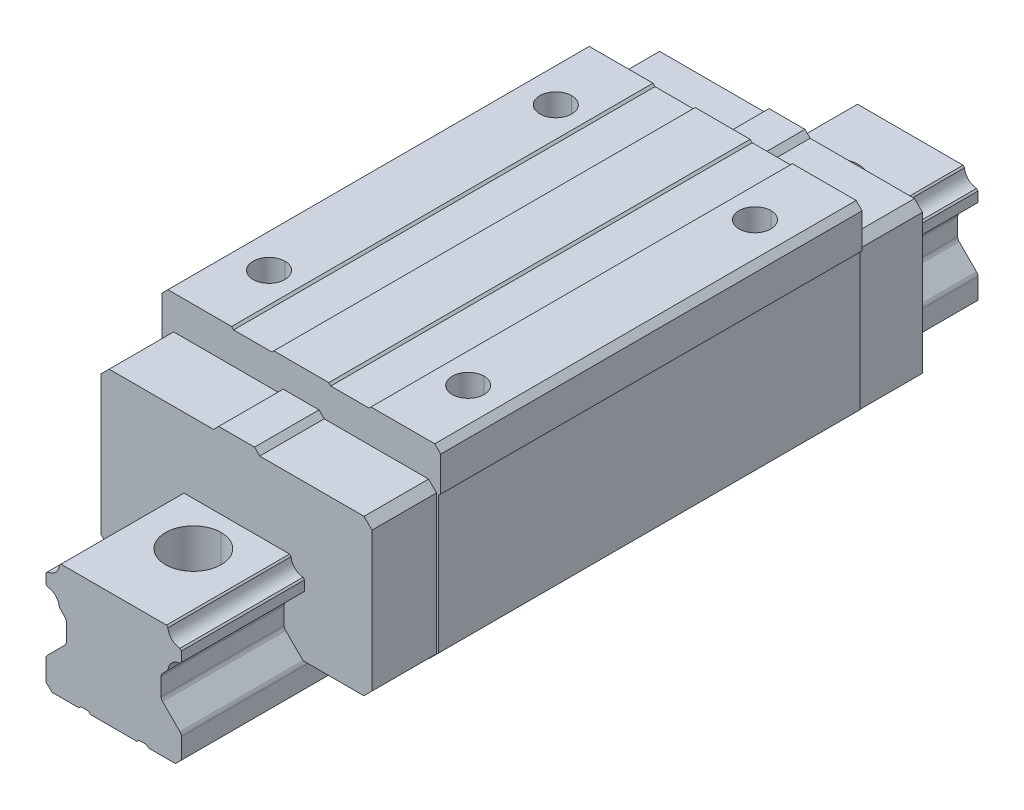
ISO-10303-21;
HEADER;
FILE_DESCRIPTION(('STEP AP214'),'2;1');
FILE_NAME('part.step','',(''),(''),'','','');
FILE_SCHEMA(('AUTOMOTIVE_DESIGN { 1 0 10303 214 1 1 1 1 }'));
ENDSEC;
DATA;
#1=APPLICATION_CONTEXT('core data for automotive mechanical design processes');
#2=APPLICATION_PROTOCOL_DEFINITION('international standard','automotive_design',2000,#1);
#3=PRODUCT_CONTEXT('',#1,'mechanical');
#4=PRODUCT('Part','Part','',(#3));
#5=PRODUCT_RELATED_PRODUCT_CATEGORY('part','',(#4));
#6=PRODUCT_DEFINITION_FORMATION('','',#4);
#7=PRODUCT_DEFINITION_CONTEXT('part definition',#1,'design');
#8=PRODUCT_DEFINITION('design','',#6,#7);
#9=PRODUCT_DEFINITION_SHAPE('','',#8);
#10=(LENGTH_UNIT() NAMED_UNIT(*) SI_UNIT(.MILLI.,.METRE.));
#11=(NAMED_UNIT(*) PLANE_ANGLE_UNIT() SI_UNIT($,.RADIAN.));
#12=(NAMED_UNIT(*) SI_UNIT($,.STERADIAN.) SOLID_ANGLE_UNIT());
#13=UNCERTAINTY_MEASURE_WITH_UNIT(LENGTH_MEASURE(1.E-05),#10,'distance_accuracy_value','');
#14=(GEOMETRIC_REPRESENTATION_CONTEXT(3) GLOBAL_UNCERTAINTY_ASSIGNED_CONTEXT((#13)) GLOBAL_UNIT_ASSIGNED_CONTEXT((#10,
#11,#12)) REPRESENTATION_CONTEXT('',''));
#15=CARTESIAN_POINT('',(0.,0.,0.));
#16=DIRECTION('',(0.,0.,1.));
#17=DIRECTION('',(1.,0.,0.));
#18=AXIS2_PLACEMENT_3D('',#15,#16,#17);
#19=CARTESIAN_POINT('',(0.,0.,-80.));
#20=DIRECTION('',(0.,1.,0.));
#21=DIRECTION('',(0.,0.,1.));
#22=AXIS2_PLACEMENT_3D('',#19,#20,#21);
#23=CYLINDRICAL_SURFACE('',#22,7.);
#24=CARTESIAN_POINT('',(0.,-12.,-80.));
#25=DIRECTION('',(0.,1.,0.));
#26=DIRECTION('',(0.,0.,1.));
#27=AXIS2_PLACEMENT_3D('',#24,#25,#26);
#28=CIRCLE('',#27,7.);
#29=CARTESIAN_POINT('',(0.,-12.,-87.));
#30=VERTEX_POINT('',#29);
#31=CARTESIAN_POINT('',(0.,-12.,-73.));
#32=VERTEX_POINT('',#31);
#33=EDGE_CURVE('P0_E233',#30,#32,#28,.T.);
#34=ORIENTED_EDGE('',*,*,#33,.F.);
#35=DIRECTION('',(0.,1.,0.));
#36=VECTOR('',#35,1.);
#37=CARTESIAN_POINT('',(0.,0.,-87.));
#38=LINE('',#37,#36);
#39=CARTESIAN_POINT('',(0.,0.,-87.));
#40=VERTEX_POINT('',#39);
#41=EDGE_CURVE('P0_E148',#30,#40,#38,.T.);
#42=ORIENTED_EDGE('',*,*,#41,.T.);
#43=CARTESIAN_POINT('',(0.,0.,-80.));
#44=DIRECTION('',(0.,-1.,0.));
#45=DIRECTION('',(0.,0.,1.));
#46=AXIS2_PLACEMENT_3D('',#43,#44,#45);
#47=CIRCLE('',#46,7.);
#48=CARTESIAN_POINT('',(0.,0.,-73.));
#49=VERTEX_POINT('',#48);
#50=EDGE_CURVE('P0_E11',#49,#40,#47,.T.);
#51=ORIENTED_EDGE('',*,*,#50,.F.);
#52=DIRECTION('',(0.,1.,0.));
#53=VECTOR('',#52,1.);
#54=CARTESIAN_POINT('',(0.,0.,-73.));
#55=LINE('',#54,#53);
#56=EDGE_CURVE('P0_E165',#32,#49,#55,.T.);
#57=ORIENTED_EDGE('',*,*,#56,.F.);
#58=EDGE_LOOP('',(#34,#42,#51,#57));
#59=FACE_BOUND('',#58,.T.);
#60=ADVANCED_FACE('P0_F17',(#59),#23,.F.);
#61=CARTESIAN_POINT('',(0.,0.,0.));
#62=DIRECTION('',(0.,1.,0.));
#63=DIRECTION('',(0.,0.,1.));
#64=AXIS2_PLACEMENT_3D('',#61,#62,#63);
#65=CYLINDRICAL_SURFACE('',#64,7.);
#66=CARTESIAN_POINT('',(0.,-12.,0.));
#67=DIRECTION('',(0.,1.,0.));
#68=DIRECTION('',(0.,0.,1.));
#69=AXIS2_PLACEMENT_3D('',#66,#67,#68);
#70=CIRCLE('',#69,7.);
#71=CARTESIAN_POINT('',(0.,-12.,-7.));
#72=VERTEX_POINT('',#71);
#73=CARTESIAN_POINT('',(0.,-12.,7.));
#74=VERTEX_POINT('',#73);
#75=EDGE_CURVE('P0_E238',#72,#74,#70,.T.);
#76=ORIENTED_EDGE('',*,*,#75,.F.);
#77=DIRECTION('',(0.,1.,0.));
#78=VECTOR('',#77,1.);
#79=CARTESIAN_POINT('',(0.,0.,-7.));
#80=LINE('',#79,#78);
#81=CARTESIAN_POINT('',(0.,0.,-7.));
#82=VERTEX_POINT('',#81);
#83=EDGE_CURVE('P0_E138',#72,#82,#80,.T.);
#84=ORIENTED_EDGE('',*,*,#83,.T.);
#85=CARTESIAN_POINT('',(0.,0.,0.));
#86=DIRECTION('',(0.,-1.,0.));
#87=DIRECTION('',(0.,0.,1.));
#88=AXIS2_PLACEMENT_3D('',#85,#86,#87);
#89=CIRCLE('',#88,7.);
#90=CARTESIAN_POINT('',(0.,0.,7.));
#91=VERTEX_POINT('',#90);
#92=EDGE_CURVE('P0_E27',#91,#82,#89,.T.);
#93=ORIENTED_EDGE('',*,*,#92,.F.);
#94=DIRECTION('',(0.,1.,0.));
#95=VECTOR('',#94,1.);
#96=CARTESIAN_POINT('',(0.,0.,7.));
#97=LINE('',#96,#95);
#98=EDGE_CURVE('P0_E135',#74,#91,#97,.T.);
#99=ORIENTED_EDGE('',*,*,#98,.F.);
#100=EDGE_LOOP('',(#76,#84,#93,#99));
#101=FACE_BOUND('',#100,.T.);
#102=ADVANCED_FACE('P0_F19',(#101),#65,.F.);
#103=CARTESIAN_POINT('',(0.,0.,80.));
#104=DIRECTION('',(0.,1.,0.));
#105=DIRECTION('',(0.,0.,1.));
#106=AXIS2_PLACEMENT_3D('',#103,#104,#105);
#107=CYLINDRICAL_SURFACE('',#106,7.);
#108=CARTESIAN_POINT('',(0.,-12.,80.));
#109=DIRECTION('',(0.,1.,0.));
#110=DIRECTION('',(0.,0.,1.));
#111=AXIS2_PLACEMENT_3D('',#108,#109,#110);
#112=CIRCLE('',#111,7.);
#113=CARTESIAN_POINT('',(0.,-12.,73.));
#114=VERTEX_POINT('',#113);
#115=CARTESIAN_POINT('',(0.,-12.,87.));
#116=VERTEX_POINT('',#115);
#117=EDGE_CURVE('P0_E191',#114,#116,#112,.T.);
#118=ORIENTED_EDGE('',*,*,#117,.F.);
#119=DIRECTION('',(0.,1.,0.));
#120=VECTOR('',#119,1.);
#121=CARTESIAN_POINT('',(0.,0.,73.));
#122=LINE('',#121,#120);
#123=CARTESIAN_POINT('',(0.,0.,73.));
#124=VERTEX_POINT('',#123);
#125=EDGE_CURVE('P0_E185',#114,#124,#122,.T.);
#126=ORIENTED_EDGE('',*,*,#125,.T.);
#127=CARTESIAN_POINT('',(0.,0.,80.));
#128=DIRECTION('',(0.,-1.,0.));
#129=DIRECTION('',(0.,0.,1.));
#130=AXIS2_PLACEMENT_3D('',#127,#128,#129);
#131=CIRCLE('',#130,7.);
#132=CARTESIAN_POINT('',(0.,0.,87.));
#133=VERTEX_POINT('',#132);
#134=EDGE_CURVE('P0_E142',#133,#124,#131,.T.);
#135=ORIENTED_EDGE('',*,*,#134,.F.);
#136=DIRECTION('',(0.,1.,0.));
#137=VECTOR('',#136,1.);
#138=CARTESIAN_POINT('',(0.,0.,87.));
#139=LINE('',#138,#137);
#140=EDGE_CURVE('P0_E187',#116,#133,#139,.T.);
#141=ORIENTED_EDGE('',*,*,#140,.F.);
#142=EDGE_LOOP('',(#118,#126,#135,#141));
#143=FACE_BOUND('',#142,.T.);
#144=ADVANCED_FACE('P0_F189',(#143),#107,.F.);
#145=CARTESIAN_POINT('',(0.,0.,-80.));
#146=DIRECTION('',(0.,1.,0.));
#147=DIRECTION('',(0.,0.,1.));
#148=AXIS2_PLACEMENT_3D('',#145,#146,#147);
#149=CYLINDRICAL_SURFACE('',#148,4.5);
#150=CARTESIAN_POINT('',(0.,-29.,-80.));
#151=DIRECTION('',(0.,1.,0.));
#152=DIRECTION('',(0.,0.,1.));
#153=AXIS2_PLACEMENT_3D('',#150,#151,#152);
#154=CIRCLE('',#153,4.5);
#155=CARTESIAN_POINT('',(0.,-29.,-84.5));
#156=VERTEX_POINT('',#155);
#157=CARTESIAN_POINT('',(0.,-29.,-75.5));
#158=VERTEX_POINT('',#157);
#159=EDGE_CURVE('P0_E305',#156,#158,#154,.T.);
#160=ORIENTED_EDGE('',*,*,#159,.F.);
#161=DIRECTION('',(0.,1.,0.));
#162=VECTOR('',#161,1.);
#163=CARTESIAN_POINT('',(0.,0.,-84.5));
#164=LINE('',#163,#162);
#165=CARTESIAN_POINT('',(0.,-12.,-84.5));
#166=VERTEX_POINT('',#165);
#167=EDGE_CURVE('P0_E422',#156,#166,#164,.T.);
#168=ORIENTED_EDGE('',*,*,#167,.T.);
#169=CARTESIAN_POINT('',(0.,-12.,-80.));
#170=DIRECTION('',(0.,-1.,0.));
#171=DIRECTION('',(0.,0.,1.));
#172=AXIS2_PLACEMENT_3D('',#169,#170,#171);
#173=CIRCLE('',#172,4.5);
#174=CARTESIAN_POINT('',(0.,-12.,-75.5));
#175=VERTEX_POINT('',#174);
#176=EDGE_CURVE('P0_E229',#175,#166,#173,.T.);
#177=ORIENTED_EDGE('',*,*,#176,.F.);
#178=DIRECTION('',(0.,1.,0.));
#179=VECTOR('',#178,1.);
#180=CARTESIAN_POINT('',(0.,0.,-75.5));
#181=LINE('',#180,#179);
#182=EDGE_CURVE('P0_E417',#158,#175,#181,.T.);
#183=ORIENTED_EDGE('',*,*,#182,.F.);
#184=EDGE_LOOP('',(#160,#168,#177,#183));
#185=FACE_BOUND('',#184,.T.);
#186=ADVANCED_FACE('P0_F960',(#185),#149,.F.);
#187=CARTESIAN_POINT('',(0.,0.,0.));
#188=DIRECTION('',(0.,1.,0.));
#189=DIRECTION('',(0.,0.,1.));
#190=AXIS2_PLACEMENT_3D('',#187,#188,#189);
#191=CYLINDRICAL_SURFACE('',#190,4.5);
#192=CARTESIAN_POINT('',(0.,-29.,0.));
#193=DIRECTION('',(0.,1.,0.));
#194=DIRECTION('',(0.,0.,1.));
#195=AXIS2_PLACEMENT_3D('',#192,#193,#194);
#196=CIRCLE('',#195,4.5);
#197=CARTESIAN_POINT('',(0.,-29.,-4.5));
#198=VERTEX_POINT('',#197);
#199=CARTESIAN_POINT('',(0.,-29.,4.5));
#200=VERTEX_POINT('',#199);
#201=EDGE_CURVE('P0_E306',#198,#200,#196,.T.);
#202=ORIENTED_EDGE('',*,*,#201,.F.);
#203=DIRECTION('',(0.,1.,0.));
#204=VECTOR('',#203,1.);
#205=CARTESIAN_POINT('',(0.,0.,-4.5));
#206=LINE('',#205,#204);
#207=CARTESIAN_POINT('',(0.,-12.,-4.5));
#208=VERTEX_POINT('',#207);
#209=EDGE_CURVE('P0_E435',#198,#208,#206,.T.);
#210=ORIENTED_EDGE('',*,*,#209,.T.);
#211=CARTESIAN_POINT('',(0.,-12.,0.));
#212=DIRECTION('',(0.,-1.,0.));
#213=DIRECTION('',(0.,0.,1.));
#214=AXIS2_PLACEMENT_3D('',#211,#212,#213);
#215=CIRCLE('',#214,4.5);
#216=CARTESIAN_POINT('',(0.,-12.,4.5));
#217=VERTEX_POINT('',#216);
#218=EDGE_CURVE('P0_E241',#217,#208,#215,.T.);
#219=ORIENTED_EDGE('',*,*,#218,.F.);
#220=DIRECTION('',(0.,1.,0.));
#221=VECTOR('',#220,1.);
#222=CARTESIAN_POINT('',(0.,0.,4.5));
#223=LINE('',#222,#221);
#224=EDGE_CURVE('P0_E434',#200,#217,#223,.T.);
#225=ORIENTED_EDGE('',*,*,#224,.F.);
#226=EDGE_LOOP('',(#202,#210,#219,#225));
#227=FACE_BOUND('',#226,.T.);
#228=ADVANCED_FACE('P0_F990',(#227),#191,.F.);
#229=CARTESIAN_POINT('',(0.,0.,80.));
#230=DIRECTION('',(0.,1.,0.));
#231=DIRECTION('',(0.,0.,1.));
#232=AXIS2_PLACEMENT_3D('',#229,#230,#231);
#233=CYLINDRICAL_SURFACE('',#232,4.5);
#234=CARTESIAN_POINT('',(0.,-29.,80.));
#235=DIRECTION('',(0.,1.,0.));
#236=DIRECTION('',(0.,0.,1.));
#237=AXIS2_PLACEMENT_3D('',#234,#235,#236);
#238=CIRCLE('',#237,4.5);
#239=CARTESIAN_POINT('',(0.,-29.,75.5));
#240=VERTEX_POINT('',#239);
#241=CARTESIAN_POINT('',(0.,-29.,84.5));
#242=VERTEX_POINT('',#241);
#243=EDGE_CURVE('P0_E310',#240,#242,#238,.T.);
#244=ORIENTED_EDGE('',*,*,#243,.F.);
#245=DIRECTION('',(0.,1.,0.));
#246=VECTOR('',#245,1.);
#247=CARTESIAN_POINT('',(0.,0.,75.5));
#248=LINE('',#247,#246);
#249=CARTESIAN_POINT('',(0.,-12.,75.5));
#250=VERTEX_POINT('',#249);
#251=EDGE_CURVE('P0_E445',#240,#250,#248,.T.);
#252=ORIENTED_EDGE('',*,*,#251,.T.);
#253=CARTESIAN_POINT('',(0.,-12.,80.));
#254=DIRECTION('',(0.,-1.,0.));
#255=DIRECTION('',(0.,0.,1.));
#256=AXIS2_PLACEMENT_3D('',#253,#254,#255);
#257=CIRCLE('',#256,4.5);
#258=CARTESIAN_POINT('',(0.,-12.,84.5));
#259=VERTEX_POINT('',#258);
#260=EDGE_CURVE('P0_E272',#259,#250,#257,.T.);
#261=ORIENTED_EDGE('',*,*,#260,.F.);
#262=DIRECTION('',(0.,1.,0.));
#263=VECTOR('',#262,1.);
#264=CARTESIAN_POINT('',(0.,0.,84.5));
#265=LINE('',#264,#263);
#266=EDGE_CURVE('P0_E440',#242,#259,#265,.T.);
#267=ORIENTED_EDGE('',*,*,#266,.F.);
#268=EDGE_LOOP('',(#244,#252,#261,#267));
#269=FACE_BOUND('',#268,.T.);
#270=ADVANCED_FACE('P0_F987',(#269),#233,.F.);
#271=CARTESIAN_POINT('',(13.25142135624,0.,-100.));
#272=DIRECTION('',(0.,1.,0.));
#273=DIRECTION('',(1.,0.,0.));
#274=AXIS2_PLACEMENT_3D('',#271,#272,#273);
#275=PLANE('',#274);
#276=ORIENTED_EDGE('',*,*,#50,.T.);
#277=CARTESIAN_POINT('',(0.,0.,-80.));
#278=DIRECTION('',(0.,-1.,0.));
#279=DIRECTION('',(0.,0.,1.));
#280=AXIS2_PLACEMENT_3D('',#277,#278,#279);
#281=CIRCLE('',#280,7.);
#282=EDGE_CURVE('P0_E169',#40,#49,#281,.T.);
#283=ORIENTED_EDGE('',*,*,#282,.T.);
#284=EDGE_LOOP('',(#276,#283));
#285=FACE_BOUND('',#284,.T.);
#286=ORIENTED_EDGE('',*,*,#92,.T.);
#287=CARTESIAN_POINT('',(0.,0.,0.));
#288=DIRECTION('',(0.,-1.,0.));
#289=DIRECTION('',(0.,0.,1.));
#290=AXIS2_PLACEMENT_3D('',#287,#288,#289);
#291=CIRCLE('',#290,7.);
#292=EDGE_CURVE('P0_E143',#82,#91,#291,.T.);
#293=ORIENTED_EDGE('',*,*,#292,.T.);
#294=EDGE_LOOP('',(#286,#293));
#295=FACE_BOUND('',#294,.T.);
#296=ORIENTED_EDGE('',*,*,#134,.T.);
#297=CARTESIAN_POINT('',(0.,0.,80.));
#298=DIRECTION('',(0.,-1.,0.));
#299=DIRECTION('',(0.,0.,1.));
#300=AXIS2_PLACEMENT_3D('',#297,#298,#299);
#301=CIRCLE('',#300,7.);
#302=EDGE_CURVE('P0_E160',#124,#133,#301,.T.);
#303=ORIENTED_EDGE('',*,*,#302,.T.);
#304=EDGE_LOOP('',(#296,#303));
#305=FACE_BOUND('',#304,.T.);
#306=DIRECTION('',(0.,0.,-1.));
#307=VECTOR('',#306,1.);
#308=CARTESIAN_POINT('',(13.2514213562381,0.,-100.));
#309=LINE('',#308,#307);
#310=CARTESIAN_POINT('',(13.2514213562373,-1.07327883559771E-12,100.));
#311=VERTEX_POINT('',#310);
#312=CARTESIAN_POINT('',(13.251421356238,0.,-100.));
#313=VERTEX_POINT('',#312);
#314=EDGE_CURVE('P0_E200',#311,#313,#309,.T.);
#315=ORIENTED_EDGE('',*,*,#314,.T.);
#316=DIRECTION('',(-1.,0.,0.));
#317=VECTOR('',#316,1.);
#318=CARTESIAN_POINT('',(13.25142135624,0.,-100.));
#319=LINE('',#318,#317);
#320=CARTESIAN_POINT('',(-13.25142135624,0.,-100.));
#321=VERTEX_POINT('',#320);
#322=EDGE_CURVE('P0_E194',#313,#321,#319,.T.);
#323=ORIENTED_EDGE('',*,*,#322,.T.);
#324=DIRECTION('',(0.,0.,1.));
#325=VECTOR('',#324,1.);
#326=CARTESIAN_POINT('',(-13.25142135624,0.,-100.));
#327=LINE('',#326,#325);
#328=CARTESIAN_POINT('',(-13.2514213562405,-2.36717474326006E-13,100.));
#329=VERTEX_POINT('',#328);
#330=EDGE_CURVE('P0_E225',#321,#329,#327,.T.);
#331=ORIENTED_EDGE('',*,*,#330,.T.);
#332=DIRECTION('',(1.,0.,0.));
#333=VECTOR('',#332,1.);
#334=CARTESIAN_POINT('',(13.25142135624,0.,100.));
#335=LINE('',#334,#333);
#336=EDGE_CURVE('P0_E210',#329,#311,#335,.T.);
#337=ORIENTED_EDGE('',*,*,#336,.T.);
#338=EDGE_LOOP('',(#315,#323,#331,#337));
#339=FACE_BOUND('',#338,.T.);
#340=ADVANCED_FACE('P0_F144',(#285,#295,#305,#339),#275,.T.);
#341=CARTESIAN_POINT('',(0.,0.,-80.));
#342=DIRECTION('',(0.,1.,0.));
#343=DIRECTION('',(0.,0.,1.));
#344=AXIS2_PLACEMENT_3D('',#341,#342,#343);
#345=CYLINDRICAL_SURFACE('',#344,7.);
#346=ORIENTED_EDGE('',*,*,#41,.F.);
#347=CARTESIAN_POINT('',(0.,-12.,-80.));
#348=DIRECTION('',(0.,1.,0.));
#349=DIRECTION('',(0.,0.,1.));
#350=AXIS2_PLACEMENT_3D('',#347,#348,#349);
#351=CIRCLE('',#350,7.);
#352=EDGE_CURVE('P0_E237',#32,#30,#351,.T.);
#353=ORIENTED_EDGE('',*,*,#352,.F.);
#354=ORIENTED_EDGE('',*,*,#56,.T.);
#355=ORIENTED_EDGE('',*,*,#282,.F.);
#356=EDGE_LOOP('',(#346,#353,#354,#355));
#357=FACE_BOUND('',#356,.T.);
#358=ADVANCED_FACE('P0_F974',(#357),#345,.F.);
#359=CARTESIAN_POINT('',(0.,0.,0.));
#360=DIRECTION('',(0.,1.,0.));
#361=DIRECTION('',(0.,0.,1.));
#362=AXIS2_PLACEMENT_3D('',#359,#360,#361);
#363=CYLINDRICAL_SURFACE('',#362,7.);
#364=ORIENTED_EDGE('',*,*,#83,.F.);
#365=CARTESIAN_POINT('',(0.,-12.,0.));
#366=DIRECTION('',(0.,1.,0.));
#367=DIRECTION('',(0.,0.,1.));
#368=AXIS2_PLACEMENT_3D('',#365,#366,#367);
#369=CIRCLE('',#368,7.);
#370=EDGE_CURVE('P0_E153',#74,#72,#369,.T.);
#371=ORIENTED_EDGE('',*,*,#370,.F.);
#372=ORIENTED_EDGE('',*,*,#98,.T.);
#373=ORIENTED_EDGE('',*,*,#292,.F.);
#374=EDGE_LOOP('',(#364,#371,#372,#373));
#375=FACE_BOUND('',#374,.T.);
#376=ADVANCED_FACE('P0_F151',(#375),#363,.F.);
#377=CARTESIAN_POINT('',(0.,0.,80.));
#378=DIRECTION('',(0.,1.,0.));
#379=DIRECTION('',(0.,0.,1.));
#380=AXIS2_PLACEMENT_3D('',#377,#378,#379);
#381=CYLINDRICAL_SURFACE('',#380,7.);
#382=ORIENTED_EDGE('',*,*,#125,.F.);
#383=CARTESIAN_POINT('',(0.,-12.,80.));
#384=DIRECTION('',(0.,1.,0.));
#385=DIRECTION('',(0.,0.,1.));
#386=AXIS2_PLACEMENT_3D('',#383,#384,#385);
#387=CIRCLE('',#386,7.);
#388=EDGE_CURVE('P0_E245',#116,#114,#387,.T.);
#389=ORIENTED_EDGE('',*,*,#388,.F.);
#390=ORIENTED_EDGE('',*,*,#140,.T.);
#391=ORIENTED_EDGE('',*,*,#302,.F.);
#392=EDGE_LOOP('',(#382,#389,#390,#391));
#393=FACE_BOUND('',#392,.T.);
#394=ADVANCED_FACE('P0_F183',(#393),#381,.F.);
#395=CARTESIAN_POINT('',(0.,0.,-100.));
#396=DIRECTION('',(0.,0.,1.));
#397=DIRECTION('',(1.,0.,0.));
#398=AXIS2_PLACEMENT_3D('',#395,#396,#397);
#399=PLANE('',#398);
#400=DIRECTION('',(0.70710678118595,0.707106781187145,0.));
#401=VECTOR('',#400,1.);
#402=CARTESIAN_POINT('',(12.2514718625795,-11.0099494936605,-100.));
#403=LINE('',#402,#401);
#404=CARTESIAN_POINT('',(12.2514718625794,-11.0099494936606,-100.));
#405=VERTEX_POINT('',#404);
#406=CARTESIAN_POINT('',(13.6259433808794,-9.63547797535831,-100.));
#407=VERTEX_POINT('',#406);
#408=EDGE_CURVE('P0_E265',#405,#407,#403,.T.);
#409=ORIENTED_EDGE('',*,*,#408,.F.);
#410=CARTESIAN_POINT('',(13.1,-11.85847763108,-100.));
#411=DIRECTION('',(0.,0.,1.));
#412=DIRECTION('',(1.,0.,0.));
#413=AXIS2_PLACEMENT_3D('',#410,#411,#412);
#414=CIRCLE('',#413,1.2);
#415=CARTESIAN_POINT('',(11.8999999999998,-11.8584776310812,-100.));
#416=VERTEX_POINT('',#415);
#417=EDGE_CURVE('P0_E598',#405,#416,#414,.T.);
#418=ORIENTED_EDGE('',*,*,#417,.T.);
#419=DIRECTION('',(0.,1.,0.));
#420=VECTOR('',#419,1.);
#421=CARTESIAN_POINT('',(11.9,0.,-100.));
#422=LINE('',#421,#420);
#423=CARTESIAN_POINT('',(11.9,-16.26154209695,-100.));
#424=VERTEX_POINT('',#423);
#425=EDGE_CURVE('P0_E266',#424,#416,#422,.T.);
#426=ORIENTED_EDGE('',*,*,#425,.F.);
#427=CARTESIAN_POINT('',(13.1,-16.26154209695,-100.));
#428=DIRECTION('',(0.,0.,1.));
#429=DIRECTION('',(1.,0.,0.));
#430=AXIS2_PLACEMENT_3D('',#427,#428,#429);
#431=CIRCLE('',#430,1.2);
#432=CARTESIAN_POINT('',(12.2514718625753,-17.110070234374,-100.));
#433=VERTEX_POINT('',#432);
#434=EDGE_CURVE('P0_E490',#424,#433,#431,.T.);
#435=ORIENTED_EDGE('',*,*,#434,.T.);
#436=DIRECTION('',(-0.707106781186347,0.707106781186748,0.));
#437=VECTOR('',#436,1.);
#438=CARTESIAN_POINT('',(16.6485281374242,-21.5071265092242,-100.));
#439=LINE('',#438,#437);
#440=CARTESIAN_POINT('',(16.6485281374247,-21.5071265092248,-100.));
#441=VERTEX_POINT('',#440);
#442=EDGE_CURVE('P0_E271',#441,#433,#439,.T.);
#443=ORIENTED_EDGE('',*,*,#442,.F.);
#444=CARTESIAN_POINT('',(15.8,-22.35565464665,-100.));
#445=DIRECTION('',(0.,0.,1.));
#446=DIRECTION('',(1.,0.,0.));
#447=AXIS2_PLACEMENT_3D('',#444,#445,#446);
#448=CIRCLE('',#447,1.2);
#449=CARTESIAN_POINT('',(17.,-22.35565464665,-100.));
#450=VERTEX_POINT('',#449);
#451=EDGE_CURVE('P0_E499',#450,#441,#448,.T.);
#452=ORIENTED_EDGE('',*,*,#451,.F.);
#453=DIRECTION('',(0.,1.,0.));
#454=VECTOR('',#453,1.);
#455=CARTESIAN_POINT('',(17.,0.,-100.));
#456=LINE('',#455,#454);
#457=CARTESIAN_POINT('',(17.,-27.5,-100.));
#458=VERTEX_POINT('',#457);
#459=EDGE_CURVE('P0_E353',#458,#450,#456,.T.);
#460=ORIENTED_EDGE('',*,*,#459,.F.);
#461=DIRECTION('',(0.707106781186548,0.707106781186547,0.));
#462=VECTOR('',#461,1.);
#463=CARTESIAN_POINT('',(15.5,-29.,-100.));
#464=LINE('',#463,#462);
#465=CARTESIAN_POINT('',(15.5,-29.,-100.));
#466=VERTEX_POINT('',#465);
#467=EDGE_CURVE('P0_E281',#466,#458,#464,.T.);
#468=ORIENTED_EDGE('',*,*,#467,.F.);
#469=DIRECTION('',(1.,0.,0.));
#470=VECTOR('',#469,1.);
#471=CARTESIAN_POINT('',(0.,-29.,-100.));
#472=LINE('',#471,#470);
#473=CARTESIAN_POINT('',(8.75,-29.,-100.));
#474=VERTEX_POINT('',#473);
#475=EDGE_CURVE('P0_E292',#474,#466,#472,.T.);
#476=ORIENTED_EDGE('',*,*,#475,.F.);
#477=DIRECTION('',(0.707106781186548,-0.707106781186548,0.));
#478=VECTOR('',#477,1.);
#479=CARTESIAN_POINT('',(8.25,-28.5,-100.));
#480=LINE('',#479,#478);
#481=CARTESIAN_POINT('',(8.25,-28.5,-100.));
#482=VERTEX_POINT('',#481);
#483=EDGE_CURVE('P0_E512',#482,#474,#480,.T.);
#484=ORIENTED_EDGE('',*,*,#483,.F.);
#485=DIRECTION('',(1.,0.,0.));
#486=VECTOR('',#485,1.);
#487=CARTESIAN_POINT('',(0.,-28.5,-100.));
#488=LINE('',#487,#486);
#489=CARTESIAN_POINT('',(6.35,-28.5,-100.));
#490=VERTEX_POINT('',#489);
#491=EDGE_CURVE('P0_E301',#490,#482,#488,.T.);
#492=ORIENTED_EDGE('',*,*,#491,.F.);
#493=DIRECTION('',(0.707106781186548,0.707106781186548,0.));
#494=VECTOR('',#493,1.);
#495=CARTESIAN_POINT('',(5.85,-29.,-100.));
#496=LINE('',#495,#494);
#497=CARTESIAN_POINT('',(5.85,-29.,-100.));
#498=VERTEX_POINT('',#497);
#499=EDGE_CURVE('P0_E528',#498,#490,#496,.T.);
#500=ORIENTED_EDGE('',*,*,#499,.F.);
#501=DIRECTION('',(1.,0.,0.));
#502=VECTOR('',#501,1.);
#503=CARTESIAN_POINT('',(0.,-29.,-100.));
#504=LINE('',#503,#502);
#505=CARTESIAN_POINT('',(-5.85,-29.,-100.));
#506=VERTEX_POINT('',#505);
#507=EDGE_CURVE('P0_E332',#506,#498,#504,.T.);
#508=ORIENTED_EDGE('',*,*,#507,.F.);
#509=DIRECTION('',(0.707106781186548,-0.707106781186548,0.));
#510=VECTOR('',#509,1.);
#511=CARTESIAN_POINT('',(-6.35,-28.5,-100.));
#512=LINE('',#511,#510);
#513=CARTESIAN_POINT('',(-6.35,-28.5,-100.));
#514=VERTEX_POINT('',#513);
#515=EDGE_CURVE('P0_E551',#514,#506,#512,.T.);
#516=ORIENTED_EDGE('',*,*,#515,.F.);
#517=DIRECTION('',(1.,0.,0.));
#518=VECTOR('',#517,1.);
#519=CARTESIAN_POINT('',(0.,-28.5,-100.));
#520=LINE('',#519,#518);
#521=CARTESIAN_POINT('',(-8.25,-28.5,-100.));
#522=VERTEX_POINT('',#521);
#523=EDGE_CURVE('P0_E316',#522,#514,#520,.T.);
#524=ORIENTED_EDGE('',*,*,#523,.F.);
#525=DIRECTION('',(0.707106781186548,0.707106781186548,0.));
#526=VECTOR('',#525,1.);
#527=CARTESIAN_POINT('',(-8.75,-29.,-100.));
#528=LINE('',#527,#526);
#529=CARTESIAN_POINT('',(-8.75,-29.,-100.));
#530=VERTEX_POINT('',#529);
#531=EDGE_CURVE('P0_E575',#530,#522,#528,.T.);
#532=ORIENTED_EDGE('',*,*,#531,.F.);
#533=DIRECTION('',(1.,0.,0.));
#534=VECTOR('',#533,1.);
#535=CARTESIAN_POINT('',(0.,-29.,-100.));
#536=LINE('',#535,#534);
#537=CARTESIAN_POINT('',(-15.5,-29.,-100.));
#538=VERTEX_POINT('',#537);
#539=EDGE_CURVE('P0_E317',#538,#530,#536,.T.);
#540=ORIENTED_EDGE('',*,*,#539,.F.);
#541=DIRECTION('',(0.707106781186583,-0.707106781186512,0.));
#542=VECTOR('',#541,1.);
#543=CARTESIAN_POINT('',(-17.,-27.5,-100.));
#544=LINE('',#543,#542);
#545=CARTESIAN_POINT('',(-17.,-27.5,-100.));
#546=VERTEX_POINT('',#545);
#547=EDGE_CURVE('P0_E336',#546,#538,#544,.T.);
#548=ORIENTED_EDGE('',*,*,#547,.F.);
#549=DIRECTION('',(0.,-1.,0.));
#550=VECTOR('',#549,1.);
#551=CARTESIAN_POINT('',(-17.,0.,-100.));
#552=LINE('',#551,#550);
#553=CARTESIAN_POINT('',(-17.,-22.35565464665,-100.));
#554=VERTEX_POINT('',#553);
#555=EDGE_CURVE('P0_E342',#554,#546,#552,.T.);
#556=ORIENTED_EDGE('',*,*,#555,.F.);
#557=CARTESIAN_POINT('',(-15.8,-22.35565464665,-100.));
#558=DIRECTION('',(0.,0.,1.));
#559=DIRECTION('',(1.,0.,0.));
#560=AXIS2_PLACEMENT_3D('',#557,#558,#559);
#561=CIRCLE('',#560,1.2);
#562=CARTESIAN_POINT('',(-16.648528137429,-21.5071265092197,-100.));
#563=VERTEX_POINT('',#562);
#564=EDGE_CURVE('P0_E612',#563,#554,#561,.T.);
#565=ORIENTED_EDGE('',*,*,#564,.F.);
#566=DIRECTION('',(-0.707106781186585,-0.70710678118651,0.));
#567=VECTOR('',#566,1.);
#568=CARTESIAN_POINT('',(-12.25147186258,-17.1100702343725,-100.));
#569=LINE('',#568,#567);
#570=CARTESIAN_POINT('',(-12.25147186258,-17.1100702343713,-100.));
#571=VERTEX_POINT('',#570);
#572=EDGE_CURVE('P0_E360',#571,#563,#569,.T.);
#573=ORIENTED_EDGE('',*,*,#572,.F.);
#574=CARTESIAN_POINT('',(-13.1,-16.26154209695,-100.));
#575=DIRECTION('',(0.,0.,1.));
#576=DIRECTION('',(1.,0.,0.));
#577=AXIS2_PLACEMENT_3D('',#574,#575,#576);
#578=CIRCLE('',#577,1.2);
#579=CARTESIAN_POINT('',(-11.8999999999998,-16.26154209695,-100.));
#580=VERTEX_POINT('',#579);
#581=EDGE_CURVE('P0_E632',#571,#580,#578,.T.);
#582=ORIENTED_EDGE('',*,*,#581,.T.);
#583=DIRECTION('',(0.,-1.,0.));
#584=VECTOR('',#583,1.);
#585=CARTESIAN_POINT('',(-11.9,0.,-100.));
#586=LINE('',#585,#584);
#587=CARTESIAN_POINT('',(-11.9,-11.8584776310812,-100.));
#588=VERTEX_POINT('',#587);
#589=EDGE_CURVE('P0_E480',#588,#580,#586,.T.);
#590=ORIENTED_EDGE('',*,*,#589,.F.);
#591=CARTESIAN_POINT('',(-13.1,-11.85847763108,-100.));
#592=DIRECTION('',(0.,0.,1.));
#593=DIRECTION('',(1.,0.,0.));
#594=AXIS2_PLACEMENT_3D('',#591,#592,#593);
#595=CIRCLE('',#594,1.2);
#596=CARTESIAN_POINT('',(-12.2514718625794,-11.0099494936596,-100.));
#597=VERTEX_POINT('',#596);
#598=EDGE_CURVE('P0_E636',#588,#597,#595,.T.);
#599=ORIENTED_EDGE('',*,*,#598,.T.);
#600=DIRECTION('',(0.707106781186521,-0.707106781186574,0.));
#601=VECTOR('',#600,1.);
#602=CARTESIAN_POINT('',(-13.6259433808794,-9.63547797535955,-100.));
#603=LINE('',#602,#601);
#604=CARTESIAN_POINT('',(-13.6259433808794,-9.63547797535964,-100.));
#605=VERTEX_POINT('',#604);
#606=EDGE_CURVE('P0_E368',#605,#597,#603,.T.);
#607=ORIENTED_EDGE('',*,*,#606,.F.);
#608=CARTESIAN_POINT('',(-16.86757359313,-9.868573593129,-100.));
#609=DIRECTION('',(0.,0.,-1.));
#610=DIRECTION('',(1.,0.,0.));
#611=AXIS2_PLACEMENT_3D('',#608,#609,#610);
#612=CIRCLE('',#611,3.25);
#613=CARTESIAN_POINT('',(-16.6344779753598,-6.62694338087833,-100.));
#614=VERTEX_POINT('',#613);
#615=EDGE_CURVE('P0_E583',#614,#605,#612,.T.);
#616=ORIENTED_EDGE('',*,*,#615,.F.);
#617=DIRECTION('',(0.707106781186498,-0.707106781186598,0.));
#618=VECTOR('',#617,1.);
#619=CARTESIAN_POINT('',(-17.,-6.261421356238,-100.));
#620=LINE('',#619,#618);
#621=CARTESIAN_POINT('',(-17.,-6.26142135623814,-100.));
#622=VERTEX_POINT('',#621);
#623=EDGE_CURVE('P0_E649',#622,#614,#620,.T.);
#624=ORIENTED_EDGE('',*,*,#623,.F.);
#625=DIRECTION('',(0.,-1.,0.));
#626=VECTOR('',#625,1.);
#627=CARTESIAN_POINT('',(-16.9999999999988,0.,-100.));
#628=LINE('',#627,#626);
#629=CARTESIAN_POINT('',(-16.9999999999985,-3.74857864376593,-100.));
#630=VERTEX_POINT('',#629);
#631=EDGE_CURVE('P0_E375',#630,#622,#628,.T.);
#632=ORIENTED_EDGE('',*,*,#631,.F.);
#633=DIRECTION('',(-0.707106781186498,-0.707106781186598,0.));
#634=VECTOR('',#633,1.);
#635=CARTESIAN_POINT('',(-16.62260214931,-3.371180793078,-100.));
#636=LINE('',#635,#634);
#637=CARTESIAN_POINT('',(-16.6226021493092,-3.37118079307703,-100.));
#638=VERTEX_POINT('',#637);
#639=EDGE_CURVE('P0_E709',#638,#630,#636,.T.);
#640=ORIENTED_EDGE('',*,*,#639,.F.);
#641=CARTESIAN_POINT('',(-16.86757359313,-0.1304264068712,-100.));
#642=DIRECTION('',(0.,0.,-1.));
#643=DIRECTION('',(1.,0.,0.));
#644=AXIS2_PLACEMENT_3D('',#641,#642,#643);
#645=CIRCLE('',#644,3.25);
#646=CARTESIAN_POINT('',(-13.6268192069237,-0.375397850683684,-100.));
#647=VERTEX_POINT('',#646);
#648=EDGE_CURVE('P0_E386',#647,#638,#645,.T.);
#649=ORIENTED_EDGE('',*,*,#648,.F.);
#650=DIRECTION('',(-0.707106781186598,-0.707106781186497,0.));
#651=VECTOR('',#650,1.);
#652=CARTESIAN_POINT('',(-13.25142135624,0.,-100.));
#653=LINE('',#652,#651);
#654=EDGE_CURVE('P0_E221',#321,#647,#653,.T.);
#655=ORIENTED_EDGE('',*,*,#654,.F.);
#656=ORIENTED_EDGE('',*,*,#322,.F.);
#657=DIRECTION('',(-0.70710678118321,0.707106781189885,0.));
#658=VECTOR('',#657,1.);
#659=CARTESIAN_POINT('',(13.6268192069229,-0.375397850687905,-100.));
#660=LINE('',#659,#658);
#661=CARTESIAN_POINT('',(13.6268192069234,-0.375397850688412,-100.));
#662=VERTEX_POINT('',#661);
#663=EDGE_CURVE('P0_E206',#662,#313,#660,.T.);
#664=ORIENTED_EDGE('',*,*,#663,.F.);
#665=CARTESIAN_POINT('',(16.86757359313,-0.1304264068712,-100.));
#666=DIRECTION('',(0.,0.,-1.));
#667=DIRECTION('',(1.,0.,0.));
#668=AXIS2_PLACEMENT_3D('',#665,#666,#667);
#669=CIRCLE('',#668,3.25);
#670=CARTESIAN_POINT('',(16.622602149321,-3.37118079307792,-100.));
#671=VERTEX_POINT('',#670);
#672=EDGE_CURVE('P0_E404',#671,#662,#669,.T.);
#673=ORIENTED_EDGE('',*,*,#672,.F.);
#674=DIRECTION('',(-0.707106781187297,0.707106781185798,0.));
#675=VECTOR('',#674,1.);
#676=CARTESIAN_POINT('',(17.,-3.748578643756,-100.));
#677=LINE('',#676,#675);
#678=CARTESIAN_POINT('',(17.,-3.74857864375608,-100.));
#679=VERTEX_POINT('',#678);
#680=EDGE_CURVE('P0_E734',#679,#671,#677,.T.);
#681=ORIENTED_EDGE('',*,*,#680,.F.);
#682=DIRECTION('',(0.,1.,0.));
#683=VECTOR('',#682,1.);
#684=CARTESIAN_POINT('',(17.0000000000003,0.,-100.));
#685=LINE('',#684,#683);
#686=CARTESIAN_POINT('',(17.0000000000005,-6.26142135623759,-100.));
#687=VERTEX_POINT('',#686);
#688=EDGE_CURVE('P0_E409',#687,#679,#685,.T.);
#689=ORIENTED_EDGE('',*,*,#688,.F.);
#690=DIRECTION('',(0.707106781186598,0.707106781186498,0.));
#691=VECTOR('',#690,1.);
#692=CARTESIAN_POINT('',(16.63447797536,-6.626943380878,-100.));
#693=LINE('',#692,#691);
#694=CARTESIAN_POINT('',(16.6344779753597,-6.62694338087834,-100.));
#695=VERTEX_POINT('',#694);
#696=EDGE_CURVE('P0_E457',#695,#687,#693,.T.);
#697=ORIENTED_EDGE('',*,*,#696,.F.);
#698=CARTESIAN_POINT('',(16.86757359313,-9.868573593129,-100.));
#699=DIRECTION('',(0.,0.,-1.));
#700=DIRECTION('',(1.,0.,0.));
#701=AXIS2_PLACEMENT_3D('',#698,#699,#700);
#702=CIRCLE('',#701,3.25);
#703=EDGE_CURVE('P0_E252',#407,#695,#702,.T.);
#704=ORIENTED_EDGE('',*,*,#703,.F.);
#705=EDGE_LOOP('',(#409,#418,#426,#435,#443,#452,#460,#468,#476,#484,#492,#500,#508,#516,#524,
#532,#540,#548,#556,#565,#573,#582,#590,#599,#607,#616,#624,#632,#640,#649,#655,#656,#664,#673,
#681,#689,#697,#704));
#706=FACE_BOUND('',#705,.T.);
#707=ADVANCED_FACE('P0_F1040',(#706),#399,.F.);
#708=CARTESIAN_POINT('',(13.62681920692,-0.375397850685,-100.));
#709=DIRECTION('',(0.707106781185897,0.707106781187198,0.));
#710=DIRECTION('',(0.,0.,-1.));
#711=AXIS2_PLACEMENT_3D('',#708,#709,#710);
#712=PLANE('',#711);
#713=DIRECTION('',(0.,0.,-1.));
#714=VECTOR('',#713,1.);
#715=CARTESIAN_POINT('',(13.6268192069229,-0.375397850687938,-100.));
#716=LINE('',#715,#714);
#717=CARTESIAN_POINT('',(13.6268192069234,-0.375397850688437,100.));
#718=VERTEX_POINT('',#717);
#719=EDGE_CURVE('P0_E394',#718,#662,#716,.T.);
#720=ORIENTED_EDGE('',*,*,#719,.T.);
#721=ORIENTED_EDGE('',*,*,#663,.T.);
#722=ORIENTED_EDGE('',*,*,#314,.F.);
#723=DIRECTION('',(0.707106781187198,-0.707106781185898,0.));
#724=VECTOR('',#723,1.);
#725=CARTESIAN_POINT('',(13.62681920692,-0.375397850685,100.));
#726=LINE('',#725,#724);
#727=EDGE_CURVE('P0_E214',#311,#718,#726,.T.);
#728=ORIENTED_EDGE('',*,*,#727,.T.);
#729=EDGE_LOOP('',(#720,#721,#722,#728));
#730=FACE_BOUND('',#729,.T.);
#731=ADVANCED_FACE('P0_F1047',(#730),#712,.T.);
#732=CARTESIAN_POINT('',(0.,0.,100.));
#733=DIRECTION('',(0.,0.,1.));
#734=DIRECTION('',(1.,0.,0.));
#735=AXIS2_PLACEMENT_3D('',#732,#733,#734);
#736=PLANE('',#735);
#737=CARTESIAN_POINT('',(13.1,-11.85847763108,100.));
#738=DIRECTION('',(0.,0.,-1.));
#739=DIRECTION('',(1.,0.,0.));
#740=AXIS2_PLACEMENT_3D('',#737,#738,#739);
#741=CIRCLE('',#740,1.2);
#742=CARTESIAN_POINT('',(11.8999999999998,-11.8584776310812,100.));
#743=VERTEX_POINT('',#742);
#744=CARTESIAN_POINT('',(12.2514718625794,-11.0099494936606,100.));
#745=VERTEX_POINT('',#744);
#746=EDGE_CURVE('P0_E466',#743,#745,#741,.T.);
#747=ORIENTED_EDGE('',*,*,#746,.T.);
#748=DIRECTION('',(0.70710678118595,0.707106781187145,0.));
#749=VECTOR('',#748,1.);
#750=CARTESIAN_POINT('',(12.2514718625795,-11.0099494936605,100.));
#751=LINE('',#750,#749);
#752=CARTESIAN_POINT('',(13.6259433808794,-9.63547797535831,100.));
#753=VERTEX_POINT('',#752);
#754=EDGE_CURVE('P0_E256',#745,#753,#751,.T.);
#755=ORIENTED_EDGE('',*,*,#754,.T.);
#756=CARTESIAN_POINT('',(16.86757359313,-9.868573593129,100.));
#757=DIRECTION('',(0.,0.,-1.));
#758=DIRECTION('',(1.,0.,0.));
#759=AXIS2_PLACEMENT_3D('',#756,#757,#758);
#760=CIRCLE('',#759,3.25);
#761=CARTESIAN_POINT('',(16.6344779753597,-6.62694338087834,100.));
#762=VERTEX_POINT('',#761);
#763=EDGE_CURVE('P0_E248',#753,#762,#760,.T.);
#764=ORIENTED_EDGE('',*,*,#763,.T.);
#765=DIRECTION('',(-0.707106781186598,-0.707106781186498,0.));
#766=VECTOR('',#765,1.);
#767=CARTESIAN_POINT('',(16.63447797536,-6.626943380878,100.));
#768=LINE('',#767,#766);
#769=CARTESIAN_POINT('',(17.0000000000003,-6.26142135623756,100.));
#770=VERTEX_POINT('',#769);
#771=EDGE_CURVE('P0_E449',#770,#762,#768,.T.);
#772=ORIENTED_EDGE('',*,*,#771,.F.);
#773=DIRECTION('',(0.,1.,0.));
#774=VECTOR('',#773,1.);
#775=CARTESIAN_POINT('',(17.0000000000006,0.,100.));
#776=LINE('',#775,#774);
#777=CARTESIAN_POINT('',(17.,-3.74857864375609,100.));
#778=VERTEX_POINT('',#777);
#779=EDGE_CURVE('P0_E405',#770,#778,#776,.T.);
#780=ORIENTED_EDGE('',*,*,#779,.T.);
#781=DIRECTION('',(0.707106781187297,-0.707106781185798,0.));
#782=VECTOR('',#781,1.);
#783=CARTESIAN_POINT('',(17.,-3.748578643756,100.));
#784=LINE('',#783,#782);
#785=CARTESIAN_POINT('',(16.622602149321,-3.37118079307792,100.));
#786=VERTEX_POINT('',#785);
#787=EDGE_CURVE('P0_E717',#786,#778,#784,.T.);
#788=ORIENTED_EDGE('',*,*,#787,.F.);
#789=CARTESIAN_POINT('',(16.86757359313,-0.1304264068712,100.));
#790=DIRECTION('',(0.,0.,-1.));
#791=DIRECTION('',(1.,0.,0.));
#792=AXIS2_PLACEMENT_3D('',#789,#790,#791);
#793=CIRCLE('',#792,3.25);
#794=EDGE_CURVE('P0_E390',#786,#718,#793,.T.);
#795=ORIENTED_EDGE('',*,*,#794,.T.);
#796=ORIENTED_EDGE('',*,*,#727,.F.);
#797=ORIENTED_EDGE('',*,*,#336,.F.);
#798=DIRECTION('',(-0.707106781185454,-0.707106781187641,0.));
#799=VECTOR('',#798,1.);
#800=CARTESIAN_POINT('',(-13.2514213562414,-1.42170753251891E-12,100.));
#801=LINE('',#800,#799);
#802=CARTESIAN_POINT('',(-13.6268192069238,-0.375397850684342,100.));
#803=VERTEX_POINT('',#802);
#804=EDGE_CURVE('P0_E218',#329,#803,#801,.T.);
#805=ORIENTED_EDGE('',*,*,#804,.T.);
#806=CARTESIAN_POINT('',(-16.86757359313,-0.1304264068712,100.));
#807=DIRECTION('',(0.,0.,-1.));
#808=DIRECTION('',(1.,0.,0.));
#809=AXIS2_PLACEMENT_3D('',#806,#807,#808);
#810=CIRCLE('',#809,3.25);
#811=CARTESIAN_POINT('',(-16.6226021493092,-3.37118079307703,100.));
#812=VERTEX_POINT('',#811);
#813=EDGE_CURVE('P0_E376',#803,#812,#810,.T.);
#814=ORIENTED_EDGE('',*,*,#813,.T.);
#815=DIRECTION('',(0.707106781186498,0.707106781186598,0.));
#816=VECTOR('',#815,1.);
#817=CARTESIAN_POINT('',(-16.62260214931,-3.371180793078,100.));
#818=LINE('',#817,#816);
#819=CARTESIAN_POINT('',(-16.9999999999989,-3.74857864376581,100.));
#820=VERTEX_POINT('',#819);
#821=EDGE_CURVE('P0_E680',#820,#812,#818,.T.);
#822=ORIENTED_EDGE('',*,*,#821,.F.);
#823=DIRECTION('',(0.,-1.,0.));
#824=VECTOR('',#823,1.);
#825=CARTESIAN_POINT('',(-16.9999999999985,0.,100.));
#826=LINE('',#825,#824);
#827=CARTESIAN_POINT('',(-16.9999999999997,-6.26142135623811,100.));
#828=VERTEX_POINT('',#827);
#829=EDGE_CURVE('P0_E579',#820,#828,#826,.T.);
#830=ORIENTED_EDGE('',*,*,#829,.T.);
#831=DIRECTION('',(-0.707106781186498,0.707106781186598,0.));
#832=VECTOR('',#831,1.);
#833=CARTESIAN_POINT('',(-17.,-6.261421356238,100.));
#834=LINE('',#833,#832);
#835=CARTESIAN_POINT('',(-16.6344779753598,-6.62694338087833,100.));
#836=VERTEX_POINT('',#835);
#837=EDGE_CURVE('P0_E641',#836,#828,#834,.T.);
#838=ORIENTED_EDGE('',*,*,#837,.F.);
#839=CARTESIAN_POINT('',(-16.86757359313,-9.868573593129,100.));
#840=DIRECTION('',(0.,0.,-1.));
#841=DIRECTION('',(1.,0.,0.));
#842=AXIS2_PLACEMENT_3D('',#839,#840,#841);
#843=CIRCLE('',#842,3.25);
#844=CARTESIAN_POINT('',(-13.6259433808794,-9.63547797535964,100.));
#845=VERTEX_POINT('',#844);
#846=EDGE_CURVE('P0_E365',#836,#845,#843,.T.);
#847=ORIENTED_EDGE('',*,*,#846,.T.);
#848=DIRECTION('',(0.707106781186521,-0.707106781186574,0.));
#849=VECTOR('',#848,1.);
#850=CARTESIAN_POINT('',(-13.6259433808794,-9.63547797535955,100.));
#851=LINE('',#850,#849);
#852=CARTESIAN_POINT('',(-12.2514718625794,-11.0099494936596,100.));
#853=VERTEX_POINT('',#852);
#854=EDGE_CURVE('P0_E398',#845,#853,#851,.T.);
#855=ORIENTED_EDGE('',*,*,#854,.T.);
#856=CARTESIAN_POINT('',(-13.1,-11.85847763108,100.));
#857=DIRECTION('',(0.,0.,-1.));
#858=DIRECTION('',(1.,7.28728420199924E-12,0.));
#859=AXIS2_PLACEMENT_3D('',#856,#857,#858);
#860=CIRCLE('',#859,1.2);
#861=CARTESIAN_POINT('',(-11.9,-11.8584776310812,100.));
#862=VERTEX_POINT('',#861);
#863=EDGE_CURVE('P0_E657',#853,#862,#860,.T.);
#864=ORIENTED_EDGE('',*,*,#863,.T.);
#865=DIRECTION('',(0.,-1.,0.));
#866=VECTOR('',#865,1.);
#867=CARTESIAN_POINT('',(-11.9,0.,100.));
#868=LINE('',#867,#866);
#869=CARTESIAN_POINT('',(-11.8999999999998,-16.26154209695,100.));
#870=VERTEX_POINT('',#869);
#871=EDGE_CURVE('P0_E364',#862,#870,#868,.T.);
#872=ORIENTED_EDGE('',*,*,#871,.T.);
#873=CARTESIAN_POINT('',(-13.1,-16.26154209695,100.));
#874=DIRECTION('',(0.,0.,-1.));
#875=DIRECTION('',(1.,0.,0.));
#876=AXIS2_PLACEMENT_3D('',#873,#874,#875);
#877=CIRCLE('',#876,1.2);
#878=CARTESIAN_POINT('',(-12.25147186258,-17.1100702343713,100.));
#879=VERTEX_POINT('',#878);
#880=EDGE_CURVE('P0_E621',#870,#879,#877,.T.);
#881=ORIENTED_EDGE('',*,*,#880,.T.);
#882=DIRECTION('',(-0.707106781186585,-0.70710678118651,0.));
#883=VECTOR('',#882,1.);
#884=CARTESIAN_POINT('',(-12.25147186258,-17.1100702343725,100.));
#885=LINE('',#884,#883);
#886=CARTESIAN_POINT('',(-16.648528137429,-21.5071265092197,100.));
#887=VERTEX_POINT('',#886);
#888=EDGE_CURVE('P0_E349',#879,#887,#885,.T.);
#889=ORIENTED_EDGE('',*,*,#888,.T.);
#890=CARTESIAN_POINT('',(-15.8,-22.35565464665,100.));
#891=DIRECTION('',(0.,0.,-1.));
#892=DIRECTION('',(1.,0.,0.));
#893=AXIS2_PLACEMENT_3D('',#890,#891,#892);
#894=CIRCLE('',#893,1.2);
#895=CARTESIAN_POINT('',(-17.,-22.35565464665,100.));
#896=VERTEX_POINT('',#895);
#897=EDGE_CURVE('P0_E594',#896,#887,#894,.T.);
#898=ORIENTED_EDGE('',*,*,#897,.F.);
#899=DIRECTION('',(0.,-1.,0.));
#900=VECTOR('',#899,1.);
#901=CARTESIAN_POINT('',(-17.,0.,100.));
#902=LINE('',#901,#900);
#903=CARTESIAN_POINT('',(-17.,-27.5,100.));
#904=VERTEX_POINT('',#903);
#905=EDGE_CURVE('P0_E341',#896,#904,#902,.T.);
#906=ORIENTED_EDGE('',*,*,#905,.T.);
#907=DIRECTION('',(0.707106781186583,-0.707106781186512,0.));
#908=VECTOR('',#907,1.);
#909=CARTESIAN_POINT('',(-17.,-27.5,100.));
#910=LINE('',#909,#908);
#911=CARTESIAN_POINT('',(-15.5,-29.,100.));
#912=VERTEX_POINT('',#911);
#913=EDGE_CURVE('P0_E320',#904,#912,#910,.T.);
#914=ORIENTED_EDGE('',*,*,#913,.T.);
#915=DIRECTION('',(1.,0.,0.));
#916=VECTOR('',#915,1.);
#917=CARTESIAN_POINT('',(0.,-29.,100.));
#918=LINE('',#917,#916);
#919=CARTESIAN_POINT('',(-8.75,-29.,100.));
#920=VERTEX_POINT('',#919);
#921=EDGE_CURVE('P0_E312',#912,#920,#918,.T.);
#922=ORIENTED_EDGE('',*,*,#921,.T.);
#923=DIRECTION('',(-0.707106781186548,-0.707106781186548,0.));
#924=VECTOR('',#923,1.);
#925=CARTESIAN_POINT('',(-8.75,-29.,100.));
#926=LINE('',#925,#924);
#927=CARTESIAN_POINT('',(-8.25,-28.5,100.));
#928=VERTEX_POINT('',#927);
#929=EDGE_CURVE('P0_E564',#928,#920,#926,.T.);
#930=ORIENTED_EDGE('',*,*,#929,.F.);
#931=DIRECTION('',(1.,0.,0.));
#932=VECTOR('',#931,1.);
#933=CARTESIAN_POINT('',(0.,-28.5,100.));
#934=LINE('',#933,#932);
#935=CARTESIAN_POINT('',(-6.35,-28.5,100.));
#936=VERTEX_POINT('',#935);
#937=EDGE_CURVE('P0_E542',#928,#936,#934,.T.);
#938=ORIENTED_EDGE('',*,*,#937,.T.);
#939=DIRECTION('',(-0.707106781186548,0.707106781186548,0.));
#940=VECTOR('',#939,1.);
#941=CARTESIAN_POINT('',(-6.35,-28.5,100.));
#942=LINE('',#941,#940);
#943=CARTESIAN_POINT('',(-5.85,-29.,100.));
#944=VERTEX_POINT('',#943);
#945=EDGE_CURVE('P0_E550',#944,#936,#942,.T.);
#946=ORIENTED_EDGE('',*,*,#945,.F.);
#947=DIRECTION('',(1.,0.,0.));
#948=VECTOR('',#947,1.);
#949=CARTESIAN_POINT('',(0.,-29.,100.));
#950=LINE('',#949,#948);
#951=CARTESIAN_POINT('',(5.85,-29.,100.));
#952=VERTEX_POINT('',#951);
#953=EDGE_CURVE('P0_E311',#944,#952,#950,.T.);
#954=ORIENTED_EDGE('',*,*,#953,.T.);
#955=DIRECTION('',(-0.707106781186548,-0.707106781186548,0.));
#956=VECTOR('',#955,1.);
#957=CARTESIAN_POINT('',(5.85,-29.,100.));
#958=LINE('',#957,#956);
#959=CARTESIAN_POINT('',(6.35,-28.5,100.));
#960=VERTEX_POINT('',#959);
#961=EDGE_CURVE('P0_E520',#960,#952,#958,.T.);
#962=ORIENTED_EDGE('',*,*,#961,.F.);
#963=DIRECTION('',(1.,0.,0.));
#964=VECTOR('',#963,1.);
#965=CARTESIAN_POINT('',(0.,-28.5,100.));
#966=LINE('',#965,#964);
#967=CARTESIAN_POINT('',(8.25,-28.5,100.));
#968=VERTEX_POINT('',#967);
#969=EDGE_CURVE('P0_E297',#960,#968,#966,.T.);
#970=ORIENTED_EDGE('',*,*,#969,.T.);
#971=DIRECTION('',(-0.707106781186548,0.707106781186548,0.));
#972=VECTOR('',#971,1.);
#973=CARTESIAN_POINT('',(8.25,-28.5,100.));
#974=LINE('',#973,#972);
#975=CARTESIAN_POINT('',(8.75,-29.,100.));
#976=VERTEX_POINT('',#975);
#977=EDGE_CURVE('P0_E504',#976,#968,#974,.T.);
#978=ORIENTED_EDGE('',*,*,#977,.F.);
#979=DIRECTION('',(1.,0.,0.));
#980=VECTOR('',#979,1.);
#981=CARTESIAN_POINT('',(0.,-29.,100.));
#982=LINE('',#981,#980);
#983=CARTESIAN_POINT('',(15.5,-29.,100.));
#984=VERTEX_POINT('',#983);
#985=EDGE_CURVE('P0_E291',#976,#984,#982,.T.);
#986=ORIENTED_EDGE('',*,*,#985,.T.);
#987=DIRECTION('',(0.707106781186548,0.707106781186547,0.));
#988=VECTOR('',#987,1.);
#989=CARTESIAN_POINT('',(15.5,-29.,100.));
#990=LINE('',#989,#988);
#991=CARTESIAN_POINT('',(17.,-27.5,100.));
#992=VERTEX_POINT('',#991);
#993=EDGE_CURVE('P0_E280',#984,#992,#990,.T.);
#994=ORIENTED_EDGE('',*,*,#993,.T.);
#995=DIRECTION('',(0.,1.,0.));
#996=VECTOR('',#995,1.);
#997=CARTESIAN_POINT('',(17.,0.,100.));
#998=LINE('',#997,#996);
#999=CARTESIAN_POINT('',(17.,-22.35565464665,100.));
#1000=VERTEX_POINT('',#999);
#1001=EDGE_CURVE('P0_E285',#992,#1000,#998,.T.);
#1002=ORIENTED_EDGE('',*,*,#1001,.T.);
#1003=CARTESIAN_POINT('',(15.8,-22.35565464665,100.));
#1004=DIRECTION('',(0.,0.,-1.));
#1005=DIRECTION('',(1.,0.,0.));
#1006=AXIS2_PLACEMENT_3D('',#1003,#1004,#1005);
#1007=CIRCLE('',#1006,1.2);
#1008=CARTESIAN_POINT('',(16.6485281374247,-21.5071265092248,100.));
#1009=VERTEX_POINT('',#1008);
#1010=EDGE_CURVE('P0_E494',#1009,#1000,#1007,.T.);
#1011=ORIENTED_EDGE('',*,*,#1010,.F.);
#1012=DIRECTION('',(-0.707106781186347,0.707106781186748,0.));
#1013=VECTOR('',#1012,1.);
#1014=CARTESIAN_POINT('',(16.6485281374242,-21.5071265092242,100.));
#1015=LINE('',#1014,#1013);
#1016=CARTESIAN_POINT('',(12.2514718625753,-17.110070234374,100.));
#1017=VERTEX_POINT('',#1016);
#1018=EDGE_CURVE('P0_E267',#1009,#1017,#1015,.T.);
#1019=ORIENTED_EDGE('',*,*,#1018,.T.);
#1020=CARTESIAN_POINT('',(13.1,-16.26154209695,100.));
#1021=DIRECTION('',(0.,0.,-1.));
#1022=DIRECTION('',(1.,0.,0.));
#1023=AXIS2_PLACEMENT_3D('',#1020,#1021,#1022);
#1024=CIRCLE('',#1023,1.2);
#1025=CARTESIAN_POINT('',(11.9,-16.26154209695,100.));
#1026=VERTEX_POINT('',#1025);
#1027=EDGE_CURVE('P0_E484',#1017,#1026,#1024,.T.);
#1028=ORIENTED_EDGE('',*,*,#1027,.T.);
#1029=DIRECTION('',(0.,1.,0.));
#1030=VECTOR('',#1029,1.);
#1031=CARTESIAN_POINT('',(11.9,0.,100.));
#1032=LINE('',#1031,#1030);
#1033=EDGE_CURVE('P0_E261',#1026,#743,#1032,.T.);
#1034=ORIENTED_EDGE('',*,*,#1033,.T.);
#1035=EDGE_LOOP('',(#747,#755,#764,#772,#780,#788,#795,#796,#797,#805,#814,#822,#830,#838,#847,
#855,#864,#872,#881,#889,#898,#906,#914,#922,#930,#938,#946,#954,#962,#970,#978,#986,#994,#1002,
#1011,#1019,#1028,#1034));
#1036=FACE_BOUND('',#1035,.T.);
#1037=ADVANCED_FACE('P0_F764',(#1036),#736,.T.);
#1038=CARTESIAN_POINT('',(-13.25142135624,0.,-100.));
#1039=DIRECTION('',(-0.707106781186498,0.707106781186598,0.));
#1040=DIRECTION('',(0.,0.,1.));
#1041=AXIS2_PLACEMENT_3D('',#1038,#1039,#1040);
#1042=PLANE('',#1041);
#1043=ORIENTED_EDGE('',*,*,#330,.F.);
#1044=ORIENTED_EDGE('',*,*,#654,.T.);
#1045=DIRECTION('',(0.,0.,1.));
#1046=VECTOR('',#1045,1.);
#1047=CARTESIAN_POINT('',(-13.626819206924,-0.3753978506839,-100.));
#1048=LINE('',#1047,#1046);
#1049=EDGE_CURVE('P0_E371',#647,#803,#1048,.T.);
#1050=ORIENTED_EDGE('',*,*,#1049,.T.);
#1051=ORIENTED_EDGE('',*,*,#804,.F.);
#1052=EDGE_LOOP('',(#1043,#1044,#1050,#1051));
#1053=FACE_BOUND('',#1052,.T.);
#1054=ADVANCED_FACE('P0_F969',(#1053),#1042,.T.);
#1055=CARTESIAN_POINT('',(0.,-12.,0.));
#1056=DIRECTION('',(0.,1.,0.));
#1057=DIRECTION('',(1.,0.,0.));
#1058=AXIS2_PLACEMENT_3D('',#1055,#1056,#1057);
#1059=PLANE('',#1058);
#1060=ORIENTED_EDGE('',*,*,#176,.T.);
#1061=CARTESIAN_POINT('',(0.,-12.,-80.));
#1062=DIRECTION('',(0.,-1.,0.));
#1063=DIRECTION('',(0.,0.,1.));
#1064=AXIS2_PLACEMENT_3D('',#1061,#1062,#1063);
#1065=CIRCLE('',#1064,4.5);
#1066=EDGE_CURVE('P0_E413',#166,#175,#1065,.T.);
#1067=ORIENTED_EDGE('',*,*,#1066,.T.);
#1068=EDGE_LOOP('',(#1060,#1067));
#1069=FACE_BOUND('',#1068,.T.);
#1070=ORIENTED_EDGE('',*,*,#352,.T.);
#1071=ORIENTED_EDGE('',*,*,#33,.T.);
#1072=EDGE_LOOP('',(#1070,#1071));
#1073=FACE_BOUND('',#1072,.T.);
#1074=ADVANCED_FACE('P0_F965',(#1069,#1073),#1059,.T.);
#1075=CARTESIAN_POINT('',(0.,-12.,0.));
#1076=DIRECTION('',(0.,1.,0.));
#1077=DIRECTION('',(1.,0.,0.));
#1078=AXIS2_PLACEMENT_3D('',#1075,#1076,#1077);
#1079=PLANE('',#1078);
#1080=ORIENTED_EDGE('',*,*,#218,.T.);
#1081=CARTESIAN_POINT('',(0.,-12.,0.));
#1082=DIRECTION('',(0.,-1.,0.));
#1083=DIRECTION('',(0.,0.,1.));
#1084=AXIS2_PLACEMENT_3D('',#1081,#1082,#1083);
#1085=CIRCLE('',#1084,4.5);
#1086=EDGE_CURVE('P0_E426',#208,#217,#1085,.T.);
#1087=ORIENTED_EDGE('',*,*,#1086,.T.);
#1088=EDGE_LOOP('',(#1080,#1087));
#1089=FACE_BOUND('',#1088,.T.);
#1090=ORIENTED_EDGE('',*,*,#370,.T.);
#1091=ORIENTED_EDGE('',*,*,#75,.T.);
#1092=EDGE_LOOP('',(#1090,#1091));
#1093=FACE_BOUND('',#1092,.T.);
#1094=ADVANCED_FACE('P0_F968',(#1089,#1093),#1079,.T.);
#1095=CARTESIAN_POINT('',(0.,-12.,0.));
#1096=DIRECTION('',(0.,1.,0.));
#1097=DIRECTION('',(1.,0.,0.));
#1098=AXIS2_PLACEMENT_3D('',#1095,#1096,#1097);
#1099=PLANE('',#1098);
#1100=ORIENTED_EDGE('',*,*,#260,.T.);
#1101=CARTESIAN_POINT('',(0.,-12.,80.));
#1102=DIRECTION('',(0.,-1.,0.));
#1103=DIRECTION('',(0.,0.,1.));
#1104=AXIS2_PLACEMENT_3D('',#1101,#1102,#1103);
#1105=CIRCLE('',#1104,4.5);
#1106=EDGE_CURVE('P0_E436',#250,#259,#1105,.T.);
#1107=ORIENTED_EDGE('',*,*,#1106,.T.);
#1108=EDGE_LOOP('',(#1100,#1107));
#1109=FACE_BOUND('',#1108,.T.);
#1110=ORIENTED_EDGE('',*,*,#388,.T.);
#1111=ORIENTED_EDGE('',*,*,#117,.T.);
#1112=EDGE_LOOP('',(#1110,#1111));
#1113=FACE_BOUND('',#1112,.T.);
#1114=ADVANCED_FACE('P0_F1084',(#1109,#1113),#1099,.T.);
#1115=CARTESIAN_POINT('',(16.86757359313,-9.868573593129,-100.));
#1116=DIRECTION('',(0.,0.,1.));
#1117=DIRECTION('',(1.,0.,0.));
#1118=AXIS2_PLACEMENT_3D('',#1115,#1116,#1117);
#1119=CYLINDRICAL_SURFACE('',#1118,3.25);
#1120=ORIENTED_EDGE('',*,*,#703,.T.);
#1121=DIRECTION('',(0.,0.,-1.));
#1122=VECTOR('',#1121,1.);
#1123=CARTESIAN_POINT('',(16.6344779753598,-6.62694338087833,-100.));
#1124=LINE('',#1123,#1122);
#1125=EDGE_CURVE('P0_E461',#762,#695,#1124,.T.);
#1126=ORIENTED_EDGE('',*,*,#1125,.F.);
#1127=ORIENTED_EDGE('',*,*,#763,.F.);
#1128=DIRECTION('',(0.,0.,1.));
#1129=VECTOR('',#1128,1.);
#1130=CARTESIAN_POINT('',(13.6259433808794,-9.63547797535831,-100.));
#1131=LINE('',#1130,#1129);
#1132=EDGE_CURVE('P0_E260',#407,#753,#1131,.T.);
#1133=ORIENTED_EDGE('',*,*,#1132,.F.);
#1134=EDGE_LOOP('',(#1120,#1126,#1127,#1133));
#1135=FACE_BOUND('',#1134,.T.);
#1136=ADVANCED_FACE('P0_F1093',(#1135),#1119,.F.);
#1137=CARTESIAN_POINT('',(12.25147186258,-11.00994949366,-100.));
#1138=DIRECTION('',(0.707106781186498,-0.707106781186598,0.));
#1139=DIRECTION('',(0.,0.,-1.));
#1140=AXIS2_PLACEMENT_3D('',#1137,#1138,#1139);
#1141=PLANE('',#1140);
#1142=DIRECTION('',(0.,0.,-1.));
#1143=VECTOR('',#1142,1.);
#1144=CARTESIAN_POINT('',(12.2514718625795,-11.0099494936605,-100.));
#1145=LINE('',#1144,#1143);
#1146=EDGE_CURVE('P0_E470',#745,#405,#1145,.T.);
#1147=ORIENTED_EDGE('',*,*,#1146,.T.);
#1148=ORIENTED_EDGE('',*,*,#408,.T.);
#1149=ORIENTED_EDGE('',*,*,#1132,.T.);
#1150=ORIENTED_EDGE('',*,*,#754,.F.);
#1151=EDGE_LOOP('',(#1147,#1148,#1149,#1150));
#1152=FACE_BOUND('',#1151,.T.);
#1153=ADVANCED_FACE('P0_F1102',(#1152),#1141,.T.);
#1154=CARTESIAN_POINT('',(11.9,-16.26154209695,-100.));
#1155=DIRECTION('',(1.,1.024728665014E-13,0.));
#1156=DIRECTION('',(-1.024728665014E-13,1.,0.));
#1157=AXIS2_PLACEMENT_3D('',#1154,#1155,#1156);
#1158=PLANE('',#1157);
#1159=DIRECTION('',(0.,0.,-1.));
#1160=VECTOR('',#1159,1.);
#1161=CARTESIAN_POINT('',(11.9,-16.26154209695,-100.));
#1162=LINE('',#1161,#1160);
#1163=EDGE_CURVE('P0_E489',#1026,#424,#1162,.T.);
#1164=ORIENTED_EDGE('',*,*,#1163,.T.);
#1165=ORIENTED_EDGE('',*,*,#425,.T.);
#1166=DIRECTION('',(0.,0.,1.));
#1167=VECTOR('',#1166,1.);
#1168=CARTESIAN_POINT('',(11.8999999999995,-11.8584776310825,-100.));
#1169=LINE('',#1168,#1167);
#1170=EDGE_CURVE('P0_E462',#416,#743,#1169,.T.);
#1171=ORIENTED_EDGE('',*,*,#1170,.T.);
#1172=ORIENTED_EDGE('',*,*,#1033,.F.);
#1173=EDGE_LOOP('',(#1164,#1165,#1171,#1172));
#1174=FACE_BOUND('',#1173,.T.);
#1175=ADVANCED_FACE('P0_F1111',(#1174),#1158,.T.);
#1176=CARTESIAN_POINT('',(16.64852813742,-21.50712650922,-100.));
#1177=DIRECTION('',(0.707106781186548,0.707106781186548,0.));
#1178=DIRECTION('',(0.,0.,-1.));
#1179=AXIS2_PLACEMENT_3D('',#1176,#1177,#1178);
#1180=PLANE('',#1179);
#1181=DIRECTION('',(0.,0.,-1.));
#1182=VECTOR('',#1181,1.);
#1183=CARTESIAN_POINT('',(16.6485281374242,-21.5071265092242,-100.));
#1184=LINE('',#1183,#1182);
#1185=EDGE_CURVE('P0_E498',#1009,#441,#1184,.T.);
#1186=ORIENTED_EDGE('',*,*,#1185,.T.);
#1187=ORIENTED_EDGE('',*,*,#442,.T.);
#1188=DIRECTION('',(0.,0.,1.));
#1189=VECTOR('',#1188,1.);
#1190=CARTESIAN_POINT('',(12.2514718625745,-17.1100702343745,-100.));
#1191=LINE('',#1190,#1189);
#1192=EDGE_CURVE('P0_E488',#433,#1017,#1191,.T.);
#1193=ORIENTED_EDGE('',*,*,#1192,.T.);
#1194=ORIENTED_EDGE('',*,*,#1018,.F.);
#1195=EDGE_LOOP('',(#1186,#1187,#1193,#1194));
#1196=FACE_BOUND('',#1195,.T.);
#1197=ADVANCED_FACE('P0_F1120',(#1196),#1180,.T.);
#1198=CARTESIAN_POINT('',(17.,-27.5,-100.));
#1199=DIRECTION('',(1.,0.,0.));
#1200=DIRECTION('',(0.,1.,0.));
#1201=AXIS2_PLACEMENT_3D('',#1198,#1199,#1200);
#1202=PLANE('',#1201);
#1203=DIRECTION('',(0.,0.,-1.));
#1204=VECTOR('',#1203,1.);
#1205=CARTESIAN_POINT('',(17.,-27.5,-100.));
#1206=LINE('',#1205,#1204);
#1207=EDGE_CURVE('P0_E276',#992,#458,#1206,.T.);
#1208=ORIENTED_EDGE('',*,*,#1207,.T.);
#1209=ORIENTED_EDGE('',*,*,#459,.T.);
#1210=DIRECTION('',(0.,0.,1.));
#1211=VECTOR('',#1210,1.);
#1212=CARTESIAN_POINT('',(17.,-22.35565464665,-100.));
#1213=LINE('',#1212,#1211);
#1214=EDGE_CURVE('P0_E503',#450,#1000,#1213,.T.);
#1215=ORIENTED_EDGE('',*,*,#1214,.T.);
#1216=ORIENTED_EDGE('',*,*,#1001,.F.);
#1217=EDGE_LOOP('',(#1208,#1209,#1215,#1216));
#1218=FACE_BOUND('',#1217,.T.);
#1219=ADVANCED_FACE('P0_F1129',(#1218),#1202,.T.);
#1220=CARTESIAN_POINT('',(15.5,-29.,-100.));
#1221=DIRECTION('',(0.707106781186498,-0.707106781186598,0.));
#1222=DIRECTION('',(0.,0.,-1.));
#1223=AXIS2_PLACEMENT_3D('',#1220,#1221,#1222);
#1224=PLANE('',#1223);
#1225=DIRECTION('',(0.,0.,-1.));
#1226=VECTOR('',#1225,1.);
#1227=CARTESIAN_POINT('',(15.5,-29.,-100.));
#1228=LINE('',#1227,#1226);
#1229=EDGE_CURVE('P0_E296',#984,#466,#1228,.T.);
#1230=ORIENTED_EDGE('',*,*,#1229,.T.);
#1231=ORIENTED_EDGE('',*,*,#467,.T.);
#1232=ORIENTED_EDGE('',*,*,#1207,.F.);
#1233=ORIENTED_EDGE('',*,*,#993,.F.);
#1234=EDGE_LOOP('',(#1230,#1231,#1232,#1233));
#1235=FACE_BOUND('',#1234,.T.);
#1236=ADVANCED_FACE('P0_F1138',(#1235),#1224,.T.);
#1237=CARTESIAN_POINT('',(8.75,-29.,-100.));
#1238=DIRECTION('',(0.,-1.,0.));
#1239=DIRECTION('',(0.,0.,-1.));
#1240=AXIS2_PLACEMENT_3D('',#1237,#1238,#1239);
#1241=PLANE('',#1240);
#1242=DIRECTION('',(0.,0.,-1.));
#1243=VECTOR('',#1242,1.);
#1244=CARTESIAN_POINT('',(8.75,-29.,-100.));
#1245=LINE('',#1244,#1243);
#1246=EDGE_CURVE('P0_E508',#976,#474,#1245,.T.);
#1247=ORIENTED_EDGE('',*,*,#1246,.T.);
#1248=ORIENTED_EDGE('',*,*,#475,.T.);
#1249=ORIENTED_EDGE('',*,*,#1229,.F.);
#1250=ORIENTED_EDGE('',*,*,#985,.F.);
#1251=EDGE_LOOP('',(#1247,#1248,#1249,#1250));
#1252=FACE_BOUND('',#1251,.T.);
#1253=ADVANCED_FACE('P0_F1147',(#1252),#1241,.T.);
#1254=CARTESIAN_POINT('',(6.35,-28.5,-100.));
#1255=DIRECTION('',(0.,-1.,0.));
#1256=DIRECTION('',(0.,0.,-1.));
#1257=AXIS2_PLACEMENT_3D('',#1254,#1255,#1256);
#1258=PLANE('',#1257);
#1259=DIRECTION('',(0.,0.,-1.));
#1260=VECTOR('',#1259,1.);
#1261=CARTESIAN_POINT('',(6.35,-28.5,-100.));
#1262=LINE('',#1261,#1260);
#1263=EDGE_CURVE('P0_E524',#960,#490,#1262,.T.);
#1264=ORIENTED_EDGE('',*,*,#1263,.T.);
#1265=ORIENTED_EDGE('',*,*,#491,.T.);
#1266=DIRECTION('',(0.,0.,1.));
#1267=VECTOR('',#1266,1.);
#1268=CARTESIAN_POINT('',(8.25,-28.5,-100.));
#1269=LINE('',#1268,#1267);
#1270=EDGE_CURVE('P0_E516',#482,#968,#1269,.T.);
#1271=ORIENTED_EDGE('',*,*,#1270,.T.);
#1272=ORIENTED_EDGE('',*,*,#969,.F.);
#1273=EDGE_LOOP('',(#1264,#1265,#1271,#1272));
#1274=FACE_BOUND('',#1273,.T.);
#1275=ADVANCED_FACE('P0_F1156',(#1274),#1258,.T.);
#1276=CARTESIAN_POINT('',(-5.85,-29.,-100.));
#1277=DIRECTION('',(0.,-1.,0.));
#1278=DIRECTION('',(0.,0.,-1.));
#1279=AXIS2_PLACEMENT_3D('',#1276,#1277,#1278);
#1280=PLANE('',#1279);
#1281=CARTESIAN_POINT('',(0.,-29.,-80.));
#1282=DIRECTION('',(0.,1.,0.));
#1283=DIRECTION('',(0.,0.,1.));
#1284=AXIS2_PLACEMENT_3D('',#1281,#1282,#1283);
#1285=CIRCLE('',#1284,4.5);
#1286=EDGE_CURVE('P0_E421',#158,#156,#1285,.T.);
#1287=ORIENTED_EDGE('',*,*,#1286,.T.);
#1288=ORIENTED_EDGE('',*,*,#159,.T.);
#1289=EDGE_LOOP('',(#1287,#1288));
#1290=FACE_BOUND('',#1289,.T.);
#1291=CARTESIAN_POINT('',(0.,-29.,80.));
#1292=DIRECTION('',(0.,1.,0.));
#1293=DIRECTION('',(0.,0.,1.));
#1294=AXIS2_PLACEMENT_3D('',#1291,#1292,#1293);
#1295=CIRCLE('',#1294,4.5);
#1296=EDGE_CURVE('P0_E444',#242,#240,#1295,.T.);
#1297=ORIENTED_EDGE('',*,*,#1296,.T.);
#1298=ORIENTED_EDGE('',*,*,#243,.T.);
#1299=EDGE_LOOP('',(#1297,#1298));
#1300=FACE_BOUND('',#1299,.T.);
#1301=CARTESIAN_POINT('',(0.,-29.,0.));
#1302=DIRECTION('',(0.,1.,0.));
#1303=DIRECTION('',(0.,0.,1.));
#1304=AXIS2_PLACEMENT_3D('',#1301,#1302,#1303);
#1305=CIRCLE('',#1304,4.5);
#1306=EDGE_CURVE('P0_E430',#200,#198,#1305,.T.);
#1307=ORIENTED_EDGE('',*,*,#1306,.T.);
#1308=ORIENTED_EDGE('',*,*,#201,.T.);
#1309=EDGE_LOOP('',(#1307,#1308));
#1310=FACE_BOUND('',#1309,.T.);
#1311=DIRECTION('',(0.,0.,-1.));
#1312=VECTOR('',#1311,1.);
#1313=CARTESIAN_POINT('',(-5.85,-29.,-100.));
#1314=LINE('',#1313,#1312);
#1315=EDGE_CURVE('P0_E546',#944,#506,#1314,.T.);
#1316=ORIENTED_EDGE('',*,*,#1315,.T.);
#1317=ORIENTED_EDGE('',*,*,#507,.T.);
#1318=DIRECTION('',(0.,0.,1.));
#1319=VECTOR('',#1318,1.);
#1320=CARTESIAN_POINT('',(5.85,-29.,-100.));
#1321=LINE('',#1320,#1319);
#1322=EDGE_CURVE('P0_E535',#498,#952,#1321,.T.);
#1323=ORIENTED_EDGE('',*,*,#1322,.T.);
#1324=ORIENTED_EDGE('',*,*,#953,.F.);
#1325=EDGE_LOOP('',(#1316,#1317,#1323,#1324));
#1326=FACE_BOUND('',#1325,.T.);
#1327=ADVANCED_FACE('P0_F955',(#1290,#1300,#1310,#1326),#1280,.T.);
#1328=CARTESIAN_POINT('',(-8.25,-28.5,-100.));
#1329=DIRECTION('',(0.,-1.,0.));
#1330=DIRECTION('',(0.,0.,-1.));
#1331=AXIS2_PLACEMENT_3D('',#1328,#1329,#1330);
#1332=PLANE('',#1331);
#1333=DIRECTION('',(0.,0.,-1.));
#1334=VECTOR('',#1333,1.);
#1335=CARTESIAN_POINT('',(-8.25,-28.5,-100.));
#1336=LINE('',#1335,#1334);
#1337=EDGE_CURVE('P0_E568',#928,#522,#1336,.T.);
#1338=ORIENTED_EDGE('',*,*,#1337,.T.);
#1339=ORIENTED_EDGE('',*,*,#523,.T.);
#1340=DIRECTION('',(0.,0.,1.));
#1341=VECTOR('',#1340,1.);
#1342=CARTESIAN_POINT('',(-6.35,-28.5,-100.));
#1343=LINE('',#1342,#1341);
#1344=EDGE_CURVE('P0_E555',#514,#936,#1343,.T.);
#1345=ORIENTED_EDGE('',*,*,#1344,.T.);
#1346=ORIENTED_EDGE('',*,*,#937,.F.);
#1347=EDGE_LOOP('',(#1338,#1339,#1345,#1346));
#1348=FACE_BOUND('',#1347,.T.);
#1349=ADVANCED_FACE('P0_F1173',(#1348),#1332,.T.);
#1350=CARTESIAN_POINT('',(-15.5,-29.,-100.));
#1351=DIRECTION('',(0.,-1.,0.));
#1352=DIRECTION('',(0.,0.,-1.));
#1353=AXIS2_PLACEMENT_3D('',#1350,#1351,#1352);
#1354=PLANE('',#1353);
#1355=DIRECTION('',(0.,0.,-1.));
#1356=VECTOR('',#1355,1.);
#1357=CARTESIAN_POINT('',(-15.5,-29.,-100.));
#1358=LINE('',#1357,#1356);
#1359=EDGE_CURVE('P0_E328',#912,#538,#1358,.T.);
#1360=ORIENTED_EDGE('',*,*,#1359,.T.);
#1361=ORIENTED_EDGE('',*,*,#539,.T.);
#1362=DIRECTION('',(0.,0.,1.));
#1363=VECTOR('',#1362,1.);
#1364=CARTESIAN_POINT('',(-8.75,-29.,-100.));
#1365=LINE('',#1364,#1363);
#1366=EDGE_CURVE('P0_E587',#530,#920,#1365,.T.);
#1367=ORIENTED_EDGE('',*,*,#1366,.T.);
#1368=ORIENTED_EDGE('',*,*,#921,.F.);
#1369=EDGE_LOOP('',(#1360,#1361,#1367,#1368));
#1370=FACE_BOUND('',#1369,.T.);
#1371=ADVANCED_FACE('P0_F1181',(#1370),#1354,.T.);
#1372=CARTESIAN_POINT('',(-17.,-27.5,-100.));
#1373=DIRECTION('',(-0.707106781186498,-0.707106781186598,0.));
#1374=DIRECTION('',(-0.707106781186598,0.707106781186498,0.));
#1375=AXIS2_PLACEMENT_3D('',#1372,#1373,#1374);
#1376=PLANE('',#1375);
#1377=DIRECTION('',(0.,0.,-1.));
#1378=VECTOR('',#1377,1.);
#1379=CARTESIAN_POINT('',(-17.,-27.5,-100.));
#1380=LINE('',#1379,#1378);
#1381=EDGE_CURVE('P0_E337',#904,#546,#1380,.T.);
#1382=ORIENTED_EDGE('',*,*,#1381,.T.);
#1383=ORIENTED_EDGE('',*,*,#547,.T.);
#1384=ORIENTED_EDGE('',*,*,#1359,.F.);
#1385=ORIENTED_EDGE('',*,*,#913,.F.);
#1386=EDGE_LOOP('',(#1382,#1383,#1384,#1385));
#1387=FACE_BOUND('',#1386,.T.);
#1388=ADVANCED_FACE('P0_F1190',(#1387),#1376,.T.);
#1389=CARTESIAN_POINT('',(-17.,-22.35565464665,-100.));
#1390=DIRECTION('',(-1.,0.,0.));
#1391=DIRECTION('',(0.,0.,1.));
#1392=AXIS2_PLACEMENT_3D('',#1389,#1390,#1391);
#1393=PLANE('',#1392);
#1394=DIRECTION('',(0.,0.,-1.));
#1395=VECTOR('',#1394,1.);
#1396=CARTESIAN_POINT('',(-17.,-22.35565464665,-100.));
#1397=LINE('',#1396,#1395);
#1398=EDGE_CURVE('P0_E602',#896,#554,#1397,.T.);
#1399=ORIENTED_EDGE('',*,*,#1398,.T.);
#1400=ORIENTED_EDGE('',*,*,#555,.T.);
#1401=ORIENTED_EDGE('',*,*,#1381,.F.);
#1402=ORIENTED_EDGE('',*,*,#905,.F.);
#1403=EDGE_LOOP('',(#1399,#1400,#1401,#1402));
#1404=FACE_BOUND('',#1403,.T.);
#1405=ADVANCED_FACE('P0_F1199',(#1404),#1393,.T.);
#1406=CARTESIAN_POINT('',(-12.25147186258,-17.11007023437,-100.));
#1407=DIRECTION('',(-0.707106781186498,0.707106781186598,0.));
#1408=DIRECTION('',(0.,0.,1.));
#1409=AXIS2_PLACEMENT_3D('',#1406,#1407,#1408);
#1410=PLANE('',#1409);
#1411=DIRECTION('',(0.,0.,-1.));
#1412=VECTOR('',#1411,1.);
#1413=CARTESIAN_POINT('',(-12.2514718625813,-17.1100702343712,-100.));
#1414=LINE('',#1413,#1412);
#1415=EDGE_CURVE('P0_E625',#879,#571,#1414,.T.);
#1416=ORIENTED_EDGE('',*,*,#1415,.T.);
#1417=ORIENTED_EDGE('',*,*,#572,.T.);
#1418=DIRECTION('',(0.,0.,1.));
#1419=VECTOR('',#1418,1.);
#1420=CARTESIAN_POINT('',(-16.6485281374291,-21.5071265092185,-100.));
#1421=LINE('',#1420,#1419);
#1422=EDGE_CURVE('P0_E616',#563,#887,#1421,.T.);
#1423=ORIENTED_EDGE('',*,*,#1422,.T.);
#1424=ORIENTED_EDGE('',*,*,#888,.F.);
#1425=EDGE_LOOP('',(#1416,#1417,#1423,#1424));
#1426=FACE_BOUND('',#1425,.T.);
#1427=ADVANCED_FACE('P0_F1208',(#1426),#1410,.T.);
#1428=CARTESIAN_POINT('',(-11.9,-11.85847763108,-100.));
#1429=DIRECTION('',(-1.,-1.040866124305E-13,0.));
#1430=DIRECTION('',(-1.040866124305E-13,1.,0.));
#1431=AXIS2_PLACEMENT_3D('',#1428,#1429,#1430);
#1432=PLANE('',#1431);
#1433=DIRECTION('',(0.,0.,-1.));
#1434=VECTOR('',#1433,1.);
#1435=CARTESIAN_POINT('',(-11.9,-11.8584776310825,-100.));
#1436=LINE('',#1435,#1434);
#1437=EDGE_CURVE('P0_E640',#862,#588,#1436,.T.);
#1438=ORIENTED_EDGE('',*,*,#1437,.T.);
#1439=ORIENTED_EDGE('',*,*,#589,.T.);
#1440=DIRECTION('',(0.,0.,1.));
#1441=VECTOR('',#1440,1.);
#1442=CARTESIAN_POINT('',(-11.8999999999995,-16.26154209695,-100.));
#1443=LINE('',#1442,#1441);
#1444=EDGE_CURVE('P0_E620',#580,#870,#1443,.T.);
#1445=ORIENTED_EDGE('',*,*,#1444,.T.);
#1446=ORIENTED_EDGE('',*,*,#871,.F.);
#1447=EDGE_LOOP('',(#1438,#1439,#1445,#1446));
#1448=FACE_BOUND('',#1447,.T.);
#1449=ADVANCED_FACE('P0_F751',(#1448),#1432,.T.);
#1450=CARTESIAN_POINT('',(-13.62594338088,-9.635477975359,-100.));
#1451=DIRECTION('',(-0.707106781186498,-0.707106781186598,0.));
#1452=DIRECTION('',(-0.707106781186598,0.707106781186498,0.));
#1453=AXIS2_PLACEMENT_3D('',#1450,#1451,#1452);
#1454=PLANE('',#1453);
#1455=DIRECTION('',(0.,0.,-1.));
#1456=VECTOR('',#1455,1.);
#1457=CARTESIAN_POINT('',(-13.6259433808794,-9.63547797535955,-100.));
#1458=LINE('',#1457,#1456);
#1459=EDGE_CURVE('P0_E369',#845,#605,#1458,.T.);
#1460=ORIENTED_EDGE('',*,*,#1459,.T.);
#1461=ORIENTED_EDGE('',*,*,#606,.T.);
#1462=DIRECTION('',(0.,0.,1.));
#1463=VECTOR('',#1462,1.);
#1464=CARTESIAN_POINT('',(-12.2514718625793,-11.0099494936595,-100.));
#1465=LINE('',#1464,#1463);
#1466=EDGE_CURVE('P0_E653',#597,#853,#1465,.T.);
#1467=ORIENTED_EDGE('',*,*,#1466,.T.);
#1468=ORIENTED_EDGE('',*,*,#854,.F.);
#1469=EDGE_LOOP('',(#1460,#1461,#1467,#1468));
#1470=FACE_BOUND('',#1469,.T.);
#1471=ADVANCED_FACE('P0_F1224',(#1470),#1454,.T.);
#1472=CARTESIAN_POINT('',(-16.86757359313,-9.868573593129,-100.));
#1473=DIRECTION('',(0.,0.,1.));
#1474=DIRECTION('',(1.,0.,0.));
#1475=AXIS2_PLACEMENT_3D('',#1472,#1473,#1474);
#1476=CYLINDRICAL_SURFACE('',#1475,3.25);
#1477=ORIENTED_EDGE('',*,*,#615,.T.);
#1478=ORIENTED_EDGE('',*,*,#1459,.F.);
#1479=ORIENTED_EDGE('',*,*,#846,.F.);
#1480=DIRECTION('',(0.,0.,1.));
#1481=VECTOR('',#1480,1.);
#1482=CARTESIAN_POINT('',(-16.6344779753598,-6.62694338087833,-100.));
#1483=LINE('',#1482,#1481);
#1484=EDGE_CURVE('P0_E645',#614,#836,#1483,.T.);
#1485=ORIENTED_EDGE('',*,*,#1484,.F.);
#1486=EDGE_LOOP('',(#1477,#1478,#1479,#1485));
#1487=FACE_BOUND('',#1486,.T.);
#1488=ADVANCED_FACE('P0_F1232',(#1487),#1476,.F.);
#1489=CARTESIAN_POINT('',(-17.,-3.748578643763,-100.));
#1490=DIRECTION('',(-1.,-2.191424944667E-13,0.));
#1491=DIRECTION('',(-2.191424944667E-13,1.,0.));
#1492=AXIS2_PLACEMENT_3D('',#1489,#1490,#1491);
#1493=PLANE('',#1492);
#1494=DIRECTION('',(0.,0.,-1.));
#1495=VECTOR('',#1494,1.);
#1496=CARTESIAN_POINT('',(-17.,-3.74857864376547,-100.));
#1497=LINE('',#1496,#1495);
#1498=EDGE_CURVE('P0_E696',#820,#630,#1497,.T.);
#1499=ORIENTED_EDGE('',*,*,#1498,.T.);
#1500=ORIENTED_EDGE('',*,*,#631,.T.);
#1501=DIRECTION('',(0.,0.,1.));
#1502=VECTOR('',#1501,1.);
#1503=CARTESIAN_POINT('',(-16.9999999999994,-6.26142135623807,-100.));
#1504=LINE('',#1503,#1502);
#1505=EDGE_CURVE('P0_E661',#622,#828,#1504,.T.);
#1506=ORIENTED_EDGE('',*,*,#1505,.T.);
#1507=ORIENTED_EDGE('',*,*,#829,.F.);
#1508=EDGE_LOOP('',(#1499,#1500,#1506,#1507));
#1509=FACE_BOUND('',#1508,.T.);
#1510=ADVANCED_FACE('P0_F1241',(#1509),#1493,.T.);
#1511=CARTESIAN_POINT('',(-16.86757359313,-0.1304264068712,-100.));
#1512=DIRECTION('',(0.,0.,1.));
#1513=DIRECTION('',(1.,0.,0.));
#1514=AXIS2_PLACEMENT_3D('',#1511,#1512,#1513);
#1515=CYLINDRICAL_SURFACE('',#1514,3.25);
#1516=ORIENTED_EDGE('',*,*,#648,.T.);
#1517=DIRECTION('',(0.,0.,-1.));
#1518=VECTOR('',#1517,1.);
#1519=CARTESIAN_POINT('',(-16.6226021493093,-3.37118079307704,-100.));
#1520=LINE('',#1519,#1518);
#1521=EDGE_CURVE('P0_E713',#812,#638,#1520,.T.);
#1522=ORIENTED_EDGE('',*,*,#1521,.F.);
#1523=ORIENTED_EDGE('',*,*,#813,.F.);
#1524=ORIENTED_EDGE('',*,*,#1049,.F.);
#1525=EDGE_LOOP('',(#1516,#1522,#1523,#1524));
#1526=FACE_BOUND('',#1525,.T.);
#1527=ADVANCED_FACE('P0_F1250',(#1526),#1515,.F.);
#1528=CARTESIAN_POINT('',(16.86757359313,-0.1304264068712,-100.));
#1529=DIRECTION('',(0.,0.,1.));
#1530=DIRECTION('',(1.,0.,0.));
#1531=AXIS2_PLACEMENT_3D('',#1528,#1529,#1530);
#1532=CYLINDRICAL_SURFACE('',#1531,3.25);
#1533=ORIENTED_EDGE('',*,*,#672,.T.);
#1534=ORIENTED_EDGE('',*,*,#719,.F.);
#1535=ORIENTED_EDGE('',*,*,#794,.F.);
#1536=DIRECTION('',(0.,0.,1.));
#1537=VECTOR('',#1536,1.);
#1538=CARTESIAN_POINT('',(16.6226021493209,-3.37118079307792,-100.));
#1539=LINE('',#1538,#1537);
#1540=EDGE_CURVE('P0_E727',#671,#786,#1539,.T.);
#1541=ORIENTED_EDGE('',*,*,#1540,.F.);
#1542=EDGE_LOOP('',(#1533,#1534,#1535,#1541));
#1543=FACE_BOUND('',#1542,.T.);
#1544=ADVANCED_FACE('P0_F1259',(#1543),#1532,.F.);
#1545=CARTESIAN_POINT('',(17.,-6.261421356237,-100.));
#1546=DIRECTION('',(1.,0.,0.));
#1547=DIRECTION('',(0.,1.,0.));
#1548=AXIS2_PLACEMENT_3D('',#1545,#1546,#1547);
#1549=PLANE('',#1548);
#1550=DIRECTION('',(0.,0.,-1.));
#1551=VECTOR('',#1550,1.);
#1552=CARTESIAN_POINT('',(17.,-6.26142135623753,-100.));
#1553=LINE('',#1552,#1551);
#1554=EDGE_CURVE('P0_E456',#770,#687,#1553,.T.);
#1555=ORIENTED_EDGE('',*,*,#1554,.T.);
#1556=ORIENTED_EDGE('',*,*,#688,.T.);
#1557=DIRECTION('',(0.,0.,1.));
#1558=VECTOR('',#1557,1.);
#1559=CARTESIAN_POINT('',(17.,-3.74857864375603,-100.));
#1560=LINE('',#1559,#1558);
#1561=EDGE_CURVE('P0_E738',#679,#778,#1560,.T.);
#1562=ORIENTED_EDGE('',*,*,#1561,.T.);
#1563=ORIENTED_EDGE('',*,*,#779,.F.);
#1564=EDGE_LOOP('',(#1555,#1556,#1562,#1563));
#1565=FACE_BOUND('',#1564,.T.);
#1566=ADVANCED_FACE('P0_F1268',(#1565),#1549,.T.);
#1567=CARTESIAN_POINT('',(0.,0.,-80.));
#1568=DIRECTION('',(0.,1.,0.));
#1569=DIRECTION('',(0.,0.,1.));
#1570=AXIS2_PLACEMENT_3D('',#1567,#1568,#1569);
#1571=CYLINDRICAL_SURFACE('',#1570,4.5);
#1572=ORIENTED_EDGE('',*,*,#167,.F.);
#1573=ORIENTED_EDGE('',*,*,#1286,.F.);
#1574=ORIENTED_EDGE('',*,*,#182,.T.);
#1575=ORIENTED_EDGE('',*,*,#1066,.F.);
#1576=EDGE_LOOP('',(#1572,#1573,#1574,#1575));
#1577=FACE_BOUND('',#1576,.T.);
#1578=ADVANCED_FACE('P0_F963',(#1577),#1571,.F.);
#1579=CARTESIAN_POINT('',(0.,0.,0.));
#1580=DIRECTION('',(0.,1.,0.));
#1581=DIRECTION('',(0.,0.,1.));
#1582=AXIS2_PLACEMENT_3D('',#1579,#1580,#1581);
#1583=CYLINDRICAL_SURFACE('',#1582,4.5);
#1584=ORIENTED_EDGE('',*,*,#209,.F.);
#1585=ORIENTED_EDGE('',*,*,#1306,.F.);
#1586=ORIENTED_EDGE('',*,*,#224,.T.);
#1587=ORIENTED_EDGE('',*,*,#1086,.F.);
#1588=EDGE_LOOP('',(#1584,#1585,#1586,#1587));
#1589=FACE_BOUND('',#1588,.T.);
#1590=ADVANCED_FACE('P0_F1285',(#1589),#1583,.F.);
#1591=CARTESIAN_POINT('',(0.,0.,80.));
#1592=DIRECTION('',(0.,1.,0.));
#1593=DIRECTION('',(0.,0.,1.));
#1594=AXIS2_PLACEMENT_3D('',#1591,#1592,#1593);
#1595=CYLINDRICAL_SURFACE('',#1594,4.5);
#1596=ORIENTED_EDGE('',*,*,#251,.F.);
#1597=ORIENTED_EDGE('',*,*,#1296,.F.);
#1598=ORIENTED_EDGE('',*,*,#266,.T.);
#1599=ORIENTED_EDGE('',*,*,#1106,.F.);
#1600=EDGE_LOOP('',(#1596,#1597,#1598,#1599));
#1601=FACE_BOUND('',#1600,.T.);
#1602=ADVANCED_FACE('P0_F1293',(#1601),#1595,.F.);
#1603=CARTESIAN_POINT('',(16.63447797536,-6.626943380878,-100.));
#1604=DIRECTION('',(0.707106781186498,-0.707106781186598,0.));
#1605=DIRECTION('',(0.,0.,-1.));
#1606=AXIS2_PLACEMENT_3D('',#1603,#1604,#1605);
#1607=PLANE('',#1606);
#1608=ORIENTED_EDGE('',*,*,#1125,.T.);
#1609=ORIENTED_EDGE('',*,*,#696,.T.);
#1610=ORIENTED_EDGE('',*,*,#1554,.F.);
#1611=ORIENTED_EDGE('',*,*,#771,.T.);
#1612=EDGE_LOOP('',(#1608,#1609,#1610,#1611));
#1613=FACE_BOUND('',#1612,.T.);
#1614=ADVANCED_FACE('P0_F1302',(#1613),#1607,.T.);
#1615=CARTESIAN_POINT('',(13.1,-11.85847763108,-100.));
#1616=DIRECTION('',(0.,0.,1.));
#1617=DIRECTION('',(1.,0.,0.));
#1618=AXIS2_PLACEMENT_3D('',#1615,#1616,#1617);
#1619=CYLINDRICAL_SURFACE('',#1618,1.2);
#1620=ORIENTED_EDGE('',*,*,#417,.F.);
#1621=ORIENTED_EDGE('',*,*,#1146,.F.);
#1622=ORIENTED_EDGE('',*,*,#746,.F.);
#1623=ORIENTED_EDGE('',*,*,#1170,.F.);
#1624=EDGE_LOOP('',(#1620,#1621,#1622,#1623));
#1625=FACE_BOUND('',#1624,.T.);
#1626=ADVANCED_FACE('P0_F1311',(#1625),#1619,.F.);
#1627=CARTESIAN_POINT('',(13.1,-16.26154209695,-100.));
#1628=DIRECTION('',(0.,0.,1.));
#1629=DIRECTION('',(1.,0.,0.));
#1630=AXIS2_PLACEMENT_3D('',#1627,#1628,#1629);
#1631=CYLINDRICAL_SURFACE('',#1630,1.2);
#1632=ORIENTED_EDGE('',*,*,#434,.F.);
#1633=ORIENTED_EDGE('',*,*,#1163,.F.);
#1634=ORIENTED_EDGE('',*,*,#1027,.F.);
#1635=ORIENTED_EDGE('',*,*,#1192,.F.);
#1636=EDGE_LOOP('',(#1632,#1633,#1634,#1635));
#1637=FACE_BOUND('',#1636,.T.);
#1638=ADVANCED_FACE('P0_F1320',(#1637),#1631,.F.);
#1639=CARTESIAN_POINT('',(15.8,-22.35565464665,-100.));
#1640=DIRECTION('',(0.,0.,1.));
#1641=DIRECTION('',(1.,0.,0.));
#1642=AXIS2_PLACEMENT_3D('',#1639,#1640,#1641);
#1643=CYLINDRICAL_SURFACE('',#1642,1.2);
#1644=ORIENTED_EDGE('',*,*,#1214,.F.);
#1645=ORIENTED_EDGE('',*,*,#451,.T.);
#1646=ORIENTED_EDGE('',*,*,#1185,.F.);
#1647=ORIENTED_EDGE('',*,*,#1010,.T.);
#1648=EDGE_LOOP('',(#1644,#1645,#1646,#1647));
#1649=FACE_BOUND('',#1648,.T.);
#1650=ADVANCED_FACE('P0_F1329',(#1649),#1643,.T.);
#1651=CARTESIAN_POINT('',(8.25,-28.5,-100.));
#1652=DIRECTION('',(-0.707106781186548,-0.707106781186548,0.));
#1653=DIRECTION('',(-0.707106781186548,0.707106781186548,0.));
#1654=AXIS2_PLACEMENT_3D('',#1651,#1652,#1653);
#1655=PLANE('',#1654);
#1656=ORIENTED_EDGE('',*,*,#1270,.F.);
#1657=ORIENTED_EDGE('',*,*,#483,.T.);
#1658=ORIENTED_EDGE('',*,*,#1246,.F.);
#1659=ORIENTED_EDGE('',*,*,#977,.T.);
#1660=EDGE_LOOP('',(#1656,#1657,#1658,#1659));
#1661=FACE_BOUND('',#1660,.T.);
#1662=ADVANCED_FACE('P0_F1338',(#1661),#1655,.T.);
#1663=CARTESIAN_POINT('',(5.85,-29.,-100.));
#1664=DIRECTION('',(0.707106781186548,-0.707106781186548,0.));
#1665=DIRECTION('',(0.,0.,-1.));
#1666=AXIS2_PLACEMENT_3D('',#1663,#1664,#1665);
#1667=PLANE('',#1666);
#1668=ORIENTED_EDGE('',*,*,#1322,.F.);
#1669=ORIENTED_EDGE('',*,*,#499,.T.);
#1670=ORIENTED_EDGE('',*,*,#1263,.F.);
#1671=ORIENTED_EDGE('',*,*,#961,.T.);
#1672=EDGE_LOOP('',(#1668,#1669,#1670,#1671));
#1673=FACE_BOUND('',#1672,.T.);
#1674=ADVANCED_FACE('P0_F1347',(#1673),#1667,.T.);
#1675=CARTESIAN_POINT('',(-6.35,-28.5,-100.));
#1676=DIRECTION('',(-0.707106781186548,-0.707106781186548,0.));
#1677=DIRECTION('',(-0.707106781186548,0.707106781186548,0.));
#1678=AXIS2_PLACEMENT_3D('',#1675,#1676,#1677);
#1679=PLANE('',#1678);
#1680=ORIENTED_EDGE('',*,*,#1344,.F.);
#1681=ORIENTED_EDGE('',*,*,#515,.T.);
#1682=ORIENTED_EDGE('',*,*,#1315,.F.);
#1683=ORIENTED_EDGE('',*,*,#945,.T.);
#1684=EDGE_LOOP('',(#1680,#1681,#1682,#1683));
#1685=FACE_BOUND('',#1684,.T.);
#1686=ADVANCED_FACE('P0_F1356',(#1685),#1679,.T.);
#1687=CARTESIAN_POINT('',(-8.75,-29.,-100.));
#1688=DIRECTION('',(0.707106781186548,-0.707106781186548,0.));
#1689=DIRECTION('',(0.,0.,-1.));
#1690=AXIS2_PLACEMENT_3D('',#1687,#1688,#1689);
#1691=PLANE('',#1690);
#1692=ORIENTED_EDGE('',*,*,#1366,.F.);
#1693=ORIENTED_EDGE('',*,*,#531,.T.);
#1694=ORIENTED_EDGE('',*,*,#1337,.F.);
#1695=ORIENTED_EDGE('',*,*,#929,.T.);
#1696=EDGE_LOOP('',(#1692,#1693,#1694,#1695));
#1697=FACE_BOUND('',#1696,.T.);
#1698=ADVANCED_FACE('P0_F1365',(#1697),#1691,.T.);
#1699=CARTESIAN_POINT('',(-15.8,-22.35565464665,-100.));
#1700=DIRECTION('',(0.,0.,1.));
#1701=DIRECTION('',(1.,0.,0.));
#1702=AXIS2_PLACEMENT_3D('',#1699,#1700,#1701);
#1703=CYLINDRICAL_SURFACE('',#1702,1.2);
#1704=ORIENTED_EDGE('',*,*,#1422,.F.);
#1705=ORIENTED_EDGE('',*,*,#564,.T.);
#1706=ORIENTED_EDGE('',*,*,#1398,.F.);
#1707=ORIENTED_EDGE('',*,*,#897,.T.);
#1708=EDGE_LOOP('',(#1704,#1705,#1706,#1707));
#1709=FACE_BOUND('',#1708,.T.);
#1710=ADVANCED_FACE('P0_F1374',(#1709),#1703,.T.);
#1711=CARTESIAN_POINT('',(-13.1,-16.26154209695,-100.));
#1712=DIRECTION('',(0.,0.,1.));
#1713=DIRECTION('',(1.,0.,0.));
#1714=AXIS2_PLACEMENT_3D('',#1711,#1712,#1713);
#1715=CYLINDRICAL_SURFACE('',#1714,1.2);
#1716=ORIENTED_EDGE('',*,*,#581,.F.);
#1717=ORIENTED_EDGE('',*,*,#1415,.F.);
#1718=ORIENTED_EDGE('',*,*,#880,.F.);
#1719=ORIENTED_EDGE('',*,*,#1444,.F.);
#1720=EDGE_LOOP('',(#1716,#1717,#1718,#1719));
#1721=FACE_BOUND('',#1720,.T.);
#1722=ADVANCED_FACE('P0_F762',(#1721),#1715,.F.);
#1723=CARTESIAN_POINT('',(-13.1,-11.85847763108,-100.));
#1724=DIRECTION('',(0.,0.,1.));
#1725=DIRECTION('',(1.,0.,0.));
#1726=AXIS2_PLACEMENT_3D('',#1723,#1724,#1725);
#1727=CYLINDRICAL_SURFACE('',#1726,1.2);
#1728=ORIENTED_EDGE('',*,*,#598,.F.);
#1729=ORIENTED_EDGE('',*,*,#1437,.F.);
#1730=ORIENTED_EDGE('',*,*,#863,.F.);
#1731=ORIENTED_EDGE('',*,*,#1466,.F.);
#1732=EDGE_LOOP('',(#1728,#1729,#1730,#1731));
#1733=FACE_BOUND('',#1732,.T.);
#1734=ADVANCED_FACE('P0_F1391',(#1733),#1727,.F.);
#1735=CARTESIAN_POINT('',(-17.,-6.261421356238,-100.));
#1736=DIRECTION('',(-0.707106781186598,-0.707106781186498,0.));
#1737=DIRECTION('',(-0.707106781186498,0.707106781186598,0.));
#1738=AXIS2_PLACEMENT_3D('',#1735,#1736,#1737);
#1739=PLANE('',#1738);
#1740=ORIENTED_EDGE('',*,*,#1505,.F.);
#1741=ORIENTED_EDGE('',*,*,#623,.T.);
#1742=ORIENTED_EDGE('',*,*,#1484,.T.);
#1743=ORIENTED_EDGE('',*,*,#837,.T.);
#1744=EDGE_LOOP('',(#1740,#1741,#1742,#1743));
#1745=FACE_BOUND('',#1744,.T.);
#1746=ADVANCED_FACE('P0_F1399',(#1745),#1739,.T.);
#1747=CARTESIAN_POINT('',(-16.62260214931,-3.371180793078,-100.));
#1748=DIRECTION('',(-0.707106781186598,0.707106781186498,0.));
#1749=DIRECTION('',(0.,0.,1.));
#1750=AXIS2_PLACEMENT_3D('',#1747,#1748,#1749);
#1751=PLANE('',#1750);
#1752=ORIENTED_EDGE('',*,*,#1521,.T.);
#1753=ORIENTED_EDGE('',*,*,#639,.T.);
#1754=ORIENTED_EDGE('',*,*,#1498,.F.);
#1755=ORIENTED_EDGE('',*,*,#821,.T.);
#1756=EDGE_LOOP('',(#1752,#1753,#1754,#1755));
#1757=FACE_BOUND('',#1756,.T.);
#1758=ADVANCED_FACE('P0_F1408',(#1757),#1751,.T.);
#1759=CARTESIAN_POINT('',(17.,-3.748578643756,-100.));
#1760=DIRECTION('',(0.707106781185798,0.707106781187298,0.));
#1761=DIRECTION('',(0.,0.,-1.));
#1762=AXIS2_PLACEMENT_3D('',#1759,#1760,#1761);
#1763=PLANE('',#1762);
#1764=ORIENTED_EDGE('',*,*,#1561,.F.);
#1765=ORIENTED_EDGE('',*,*,#680,.T.);
#1766=ORIENTED_EDGE('',*,*,#1540,.T.);
#1767=ORIENTED_EDGE('',*,*,#787,.T.);
#1768=EDGE_LOOP('',(#1764,#1765,#1766,#1767));
#1769=FACE_BOUND('',#1768,.T.);
#1770=ADVANCED_FACE('P0_F1417',(#1769),#1763,.T.);
#1771=CLOSED_SHELL('',(#60,#102,#144,#186,#228,#270,#340,#358,#376,#394,#707,#731,#1037,#1054,
#1074,#1094,#1114,#1136,#1153,#1175,#1197,#1219,#1236,#1253,#1275,#1327,#1349,#1371,#1388,#1405,
#1427,#1449,#1471,#1488,#1510,#1527,#1544,#1566,#1578,#1590,#1602,#1614,#1626,#1638,#1650,#1662,
#1674,#1686,#1698,#1710,#1722,#1734,#1746,#1758,#1770));
#1772=MANIFOLD_SOLID_BREP('P0_B1',#1771);
#1773=CARTESIAN_POINT('',(-25.,26.,-36.));
#1774=DIRECTION('',(0.,1.,0.));
#1775=DIRECTION('',(0.,0.,1.));
#1776=AXIS2_PLACEMENT_3D('',#1773,#1774,#1775);
#1777=CYLINDRICAL_SURFACE('',#1776,4.);
#1778=CARTESIAN_POINT('',(-25.,14.,-36.));
#1779=DIRECTION('',(0.,1.,0.));
#1780=DIRECTION('',(0.,0.,1.));
#1781=AXIS2_PLACEMENT_3D('',#1778,#1779,#1780);
#1782=CIRCLE('',#1781,4.);
#1783=CARTESIAN_POINT('',(-25.,14.,-40.));
#1784=VERTEX_POINT('',#1783);
#1785=CARTESIAN_POINT('',(-25.,14.,-32.));
#1786=VERTEX_POINT('',#1785);
#1787=EDGE_CURVE('P1_E1315',#1784,#1786,#1782,.T.);
#1788=ORIENTED_EDGE('',*,*,#1787,.F.);
#1789=DIRECTION('',(0.,1.,0.));
#1790=VECTOR('',#1789,1.);
#1791=CARTESIAN_POINT('',(-25.,26.,-40.));
#1792=LINE('',#1791,#1790);
#1793=CARTESIAN_POINT('',(-25.,26.,-40.));
#1794=VERTEX_POINT('',#1793);
#1795=EDGE_CURVE('P1_E1084',#1784,#1794,#1792,.T.);
#1796=ORIENTED_EDGE('',*,*,#1795,.T.);
#1797=CARTESIAN_POINT('',(-25.,26.,-36.));
#1798=DIRECTION('',(0.,-1.,0.));
#1799=DIRECTION('',(0.,0.,1.));
#1800=AXIS2_PLACEMENT_3D('',#1797,#1798,#1799);
#1801=CIRCLE('',#1800,4.);
#1802=CARTESIAN_POINT('',(-25.,26.,-32.));
#1803=VERTEX_POINT('',#1802);
#1804=EDGE_CURVE('P1_E1085',#1803,#1794,#1801,.T.);
#1805=ORIENTED_EDGE('',*,*,#1804,.F.);
#1806=DIRECTION('',(0.,1.,0.));
#1807=VECTOR('',#1806,1.);
#1808=CARTESIAN_POINT('',(-25.,26.,-32.));
#1809=LINE('',#1808,#1807);
#1810=EDGE_CURVE('P1_E1093',#1786,#1803,#1809,.T.);
#1811=ORIENTED_EDGE('',*,*,#1810,.F.);
#1812=EDGE_LOOP('',(#1788,#1796,#1805,#1811));
#1813=FACE_BOUND('',#1812,.T.);
#1814=ADVANCED_FACE('P1_F17',(#1813),#1777,.F.);
#1815=CARTESIAN_POINT('',(-25.,26.,36.));
#1816=DIRECTION('',(0.,1.,0.));
#1817=DIRECTION('',(0.,0.,1.));
#1818=AXIS2_PLACEMENT_3D('',#1815,#1816,#1817);
#1819=CYLINDRICAL_SURFACE('',#1818,4.);
#1820=CARTESIAN_POINT('',(-25.,14.,36.));
#1821=DIRECTION('',(0.,1.,0.));
#1822=DIRECTION('',(0.,0.,1.));
#1823=AXIS2_PLACEMENT_3D('',#1820,#1821,#1822);
#1824=CIRCLE('',#1823,4.);
#1825=CARTESIAN_POINT('',(-25.,14.,32.));
#1826=VERTEX_POINT('',#1825);
#1827=CARTESIAN_POINT('',(-25.,14.,40.));
#1828=VERTEX_POINT('',#1827);
#1829=EDGE_CURVE('P1_E1303',#1826,#1828,#1824,.T.);
#1830=ORIENTED_EDGE('',*,*,#1829,.F.);
#1831=DIRECTION('',(0.,1.,0.));
#1832=VECTOR('',#1831,1.);
#1833=CARTESIAN_POINT('',(-25.,26.,32.));
#1834=LINE('',#1833,#1832);
#1835=CARTESIAN_POINT('',(-25.,26.,32.));
#1836=VERTEX_POINT('',#1835);
#1837=EDGE_CURVE('P1_E1074',#1826,#1836,#1834,.T.);
#1838=ORIENTED_EDGE('',*,*,#1837,.T.);
#1839=CARTESIAN_POINT('',(-25.,26.,36.));
#1840=DIRECTION('',(0.,-1.,0.));
#1841=DIRECTION('',(0.,0.,1.));
#1842=AXIS2_PLACEMENT_3D('',#1839,#1840,#1841);
#1843=CIRCLE('',#1842,4.);
#1844=CARTESIAN_POINT('',(-25.,26.,40.));
#1845=VERTEX_POINT('',#1844);
#1846=EDGE_CURVE('P1_E1089',#1845,#1836,#1843,.T.);
#1847=ORIENTED_EDGE('',*,*,#1846,.F.);
#1848=DIRECTION('',(0.,1.,0.));
#1849=VECTOR('',#1848,1.);
#1850=CARTESIAN_POINT('',(-25.,26.,40.));
#1851=LINE('',#1850,#1849);
#1852=EDGE_CURVE('P1_E1076',#1828,#1845,#1851,.T.);
#1853=ORIENTED_EDGE('',*,*,#1852,.F.);
#1854=EDGE_LOOP('',(#1830,#1838,#1847,#1853));
#1855=FACE_BOUND('',#1854,.T.);
#1856=ADVANCED_FACE('P1_F1461',(#1855),#1819,.F.);
#1857=CARTESIAN_POINT('',(25.,26.,-36.));
#1858=DIRECTION('',(0.,1.,0.));
#1859=DIRECTION('',(0.,0.,1.));
#1860=AXIS2_PLACEMENT_3D('',#1857,#1858,#1859);
#1861=CYLINDRICAL_SURFACE('',#1860,4.);
#1862=CARTESIAN_POINT('',(25.,14.,-36.));
#1863=DIRECTION('',(0.,1.,0.));
#1864=DIRECTION('',(0.,0.,1.));
#1865=AXIS2_PLACEMENT_3D('',#1862,#1863,#1864);
#1866=CIRCLE('',#1865,4.);
#1867=CARTESIAN_POINT('',(25.,14.,-40.));
#1868=VERTEX_POINT('',#1867);
#1869=CARTESIAN_POINT('',(25.,14.,-32.));
#1870=VERTEX_POINT('',#1869);
#1871=EDGE_CURVE('P1_E1516',#1868,#1870,#1866,.T.);
#1872=ORIENTED_EDGE('',*,*,#1871,.F.);
#1873=DIRECTION('',(0.,1.,0.));
#1874=VECTOR('',#1873,1.);
#1875=CARTESIAN_POINT('',(25.,26.,-40.));
#1876=LINE('',#1875,#1874);
#1877=CARTESIAN_POINT('',(25.,26.,-40.));
#1878=VERTEX_POINT('',#1877);
#1879=EDGE_CURVE('P1_E1305',#1868,#1878,#1876,.T.);
#1880=ORIENTED_EDGE('',*,*,#1879,.T.);
#1881=CARTESIAN_POINT('',(25.,26.,-36.));
#1882=DIRECTION('',(0.,-1.,0.));
#1883=DIRECTION('',(0.,0.,1.));
#1884=AXIS2_PLACEMENT_3D('',#1881,#1882,#1883);
#1885=CIRCLE('',#1884,4.);
#1886=CARTESIAN_POINT('',(25.,26.,-32.));
#1887=VERTEX_POINT('',#1886);
#1888=EDGE_CURVE('P1_E1184',#1887,#1878,#1885,.T.);
#1889=ORIENTED_EDGE('',*,*,#1888,.F.);
#1890=DIRECTION('',(0.,1.,0.));
#1891=VECTOR('',#1890,1.);
#1892=CARTESIAN_POINT('',(25.,26.,-32.));
#1893=LINE('',#1892,#1891);
#1894=EDGE_CURVE('P1_E1309',#1870,#1887,#1893,.T.);
#1895=ORIENTED_EDGE('',*,*,#1894,.F.);
#1896=EDGE_LOOP('',(#1872,#1880,#1889,#1895));
#1897=FACE_BOUND('',#1896,.T.);
#1898=ADVANCED_FACE('P1_F1541',(#1897),#1861,.F.);
#1899=CARTESIAN_POINT('',(25.,26.,36.));
#1900=DIRECTION('',(0.,1.,0.));
#1901=DIRECTION('',(0.,0.,1.));
#1902=AXIS2_PLACEMENT_3D('',#1899,#1900,#1901);
#1903=CYLINDRICAL_SURFACE('',#1902,4.);
#1904=CARTESIAN_POINT('',(25.,14.,36.));
#1905=DIRECTION('',(0.,1.,0.));
#1906=DIRECTION('',(0.,0.,1.));
#1907=AXIS2_PLACEMENT_3D('',#1904,#1905,#1906);
#1908=CIRCLE('',#1907,4.);
#1909=CARTESIAN_POINT('',(25.,14.,32.));
#1910=VERTEX_POINT('',#1909);
#1911=CARTESIAN_POINT('',(25.,14.,40.));
#1912=VERTEX_POINT('',#1911);
#1913=EDGE_CURVE('P1_E1523',#1910,#1912,#1908,.T.);
#1914=ORIENTED_EDGE('',*,*,#1913,.F.);
#1915=DIRECTION('',(0.,1.,0.));
#1916=VECTOR('',#1915,1.);
#1917=CARTESIAN_POINT('',(25.,26.,32.));
#1918=LINE('',#1917,#1916);
#1919=CARTESIAN_POINT('',(25.,26.,32.));
#1920=VERTEX_POINT('',#1919);
#1921=EDGE_CURVE('P1_E1333',#1910,#1920,#1918,.T.);
#1922=ORIENTED_EDGE('',*,*,#1921,.T.);
#1923=CARTESIAN_POINT('',(25.,26.,36.));
#1924=DIRECTION('',(0.,-1.,0.));
#1925=DIRECTION('',(0.,0.,1.));
#1926=AXIS2_PLACEMENT_3D('',#1923,#1924,#1925);
#1927=CIRCLE('',#1926,4.);
#1928=CARTESIAN_POINT('',(25.,26.,40.));
#1929=VERTEX_POINT('',#1928);
#1930=EDGE_CURVE('P1_E1181',#1929,#1920,#1927,.T.);
#1931=ORIENTED_EDGE('',*,*,#1930,.F.);
#1932=DIRECTION('',(0.,1.,0.));
#1933=VECTOR('',#1932,1.);
#1934=CARTESIAN_POINT('',(25.,26.,40.));
#1935=LINE('',#1934,#1933);
#1936=EDGE_CURVE('P1_E1329',#1912,#1929,#1935,.T.);
#1937=ORIENTED_EDGE('',*,*,#1936,.F.);
#1938=EDGE_LOOP('',(#1914,#1922,#1931,#1937));
#1939=FACE_BOUND('',#1938,.T.);
#1940=ADVANCED_FACE('P1_F2869',(#1939),#1903,.F.);
#1941=CARTESIAN_POINT('',(0.,0.,69.1));
#1942=DIRECTION('',(0.,0.,1.));
#1943=DIRECTION('',(1.,0.,0.));
#1944=AXIS2_PLACEMENT_3D('',#1941,#1942,#1943);
#1945=PLANE('',#1944);
#1946=CARTESIAN_POINT('',(13.1,-11.85847763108,69.1));
#1947=DIRECTION('',(0.,0.,-1.));
#1948=DIRECTION('',(1.,0.,0.));
#1949=AXIS2_PLACEMENT_3D('',#1946,#1947,#1948);
#1950=CIRCLE('',#1949,1.2);
#1951=CARTESIAN_POINT('',(11.9,-11.8584776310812,69.1));
#1952=VERTEX_POINT('',#1951);
#1953=CARTESIAN_POINT('',(12.2514718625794,-11.0099494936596,69.1));
#1954=VERTEX_POINT('',#1953);
#1955=EDGE_CURVE('P1_E747',#1952,#1954,#1950,.T.);
#1956=ORIENTED_EDGE('',*,*,#1955,.F.);
#1957=DIRECTION('',(0.,-1.,0.));
#1958=VECTOR('',#1957,1.);
#1959=CARTESIAN_POINT('',(11.9,0.,69.1));
#1960=LINE('',#1959,#1958);
#1961=CARTESIAN_POINT('',(11.9000000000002,-16.26154209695,69.1));
#1962=VERTEX_POINT('',#1961);
#1963=EDGE_CURVE('P1_E1019',#1952,#1962,#1960,.T.);
#1964=ORIENTED_EDGE('',*,*,#1963,.T.);
#1965=CARTESIAN_POINT('',(13.1,-16.26154209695,69.1));
#1966=DIRECTION('',(0.,0.,-1.));
#1967=DIRECTION('',(1.,0.,0.));
#1968=AXIS2_PLACEMENT_3D('',#1965,#1966,#1967);
#1969=CIRCLE('',#1968,1.2);
#1970=CARTESIAN_POINT('',(12.2514718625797,-17.110070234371,69.1));
#1971=VERTEX_POINT('',#1970);
#1972=EDGE_CURVE('P1_E761',#1971,#1962,#1969,.T.);
#1973=ORIENTED_EDGE('',*,*,#1972,.F.);
#1974=DIRECTION('',(0.707106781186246,-0.70710678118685,0.));
#1975=VECTOR('',#1974,1.);
#1976=CARTESIAN_POINT('',(12.2514718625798,-17.1100702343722,69.1));
#1977=LINE('',#1976,#1975);
#1978=CARTESIAN_POINT('',(16.6414016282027,-21.4999999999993,69.1));
#1979=VERTEX_POINT('',#1978);
#1980=EDGE_CURVE('P1_E859',#1971,#1979,#1977,.T.);
#1981=ORIENTED_EDGE('',*,*,#1980,.T.);
#1982=DIRECTION('',(1.,0.,0.));
#1983=VECTOR('',#1982,1.);
#1984=CARTESIAN_POINT('',(0.,-21.4999999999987,69.1));
#1985=LINE('',#1984,#1983);
#1986=CARTESIAN_POINT('',(31.9077629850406,-21.4999999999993,69.1));
#1987=VERTEX_POINT('',#1986);
#1988=EDGE_CURVE('P1_E860',#1979,#1987,#1985,.T.);
#1989=ORIENTED_EDGE('',*,*,#1988,.T.);
#1990=DIRECTION('',(0.707106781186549,0.707106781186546,0.));
#1991=VECTOR('',#1990,1.);
#1992=CARTESIAN_POINT('',(31.90776298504,-21.5,69.1));
#1993=LINE('',#1992,#1991);
#1994=CARTESIAN_POINT('',(33.95352013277,-19.45424285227,69.1));
#1995=VERTEX_POINT('',#1994);
#1996=EDGE_CURVE('P1_E786',#1987,#1995,#1993,.T.);
#1997=ORIENTED_EDGE('',*,*,#1996,.T.);
#1998=DIRECTION('',(0.,1.,0.));
#1999=VECTOR('',#1998,1.);
#2000=CARTESIAN_POINT('',(33.95352013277,0.,69.1));
#2001=LINE('',#2000,#1999);
#2002=CARTESIAN_POINT('',(33.95352013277,15.54575714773,69.1));
#2003=VERTEX_POINT('',#2002);
#2004=EDGE_CURVE('P1_E793',#1995,#2003,#2001,.T.);
#2005=ORIENTED_EDGE('',*,*,#2004,.T.);
#2006=DIRECTION('',(-0.707106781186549,0.707106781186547,0.));
#2007=VECTOR('',#2006,1.);
#2008=CARTESIAN_POINT('',(33.95352013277,15.54575714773,69.1));
#2009=LINE('',#2008,#2007);
#2010=CARTESIAN_POINT('',(31.95352013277,17.54575714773,69.1));
#2011=VERTEX_POINT('',#2010);
#2012=EDGE_CURVE('P1_E800',#2003,#2011,#2009,.T.);
#2013=ORIENTED_EDGE('',*,*,#2012,.T.);
#2014=DIRECTION('',(-1.,0.,0.));
#2015=VECTOR('',#2014,1.);
#2016=CARTESIAN_POINT('',(0.,17.54575714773,69.1));
#2017=LINE('',#2016,#2015);
#2018=CARTESIAN_POINT('',(5.753520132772,17.54575714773,69.1));
#2019=VERTEX_POINT('',#2018);
#2020=EDGE_CURVE('P1_E807',#2011,#2019,#2017,.T.);
#2021=ORIENTED_EDGE('',*,*,#2020,.T.);
#2022=DIRECTION('',(-0.707106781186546,0.707106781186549,0.));
#2023=VECTOR('',#2022,1.);
#2024=CARTESIAN_POINT('',(5.753520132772,17.54575714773,69.1));
#2025=LINE('',#2024,#2023);
#2026=CARTESIAN_POINT('',(4.453520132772,18.84575714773,69.1));
#2027=VERTEX_POINT('',#2026);
#2028=EDGE_CURVE('P1_E811',#2019,#2027,#2025,.T.);
#2029=ORIENTED_EDGE('',*,*,#2028,.T.);
#2030=DIRECTION('',(-1.,0.,0.));
#2031=VECTOR('',#2030,1.);
#2032=CARTESIAN_POINT('',(0.,18.84575714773,69.1));
#2033=LINE('',#2032,#2031);
#2034=CARTESIAN_POINT('',(-4.546479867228,18.84575714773,69.1));
#2035=VERTEX_POINT('',#2034);
#2036=EDGE_CURVE('P1_E818',#2027,#2035,#2033,.T.);
#2037=ORIENTED_EDGE('',*,*,#2036,.T.);
#2038=DIRECTION('',(-0.707106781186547,-0.707106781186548,0.));
#2039=VECTOR('',#2038,1.);
#2040=CARTESIAN_POINT('',(-4.546479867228,18.84575714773,69.1));
#2041=LINE('',#2040,#2039);
#2042=CARTESIAN_POINT('',(-5.846479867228,17.54575714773,69.1));
#2043=VERTEX_POINT('',#2042);
#2044=EDGE_CURVE('P1_E825',#2035,#2043,#2041,.T.);
#2045=ORIENTED_EDGE('',*,*,#2044,.T.);
#2046=DIRECTION('',(-1.,0.,0.));
#2047=VECTOR('',#2046,1.);
#2048=CARTESIAN_POINT('',(0.,17.54575714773,69.1));
#2049=LINE('',#2048,#2047);
#2050=CARTESIAN_POINT('',(-32.04647986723,17.54575714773,69.1));
#2051=VERTEX_POINT('',#2050);
#2052=EDGE_CURVE('P1_E832',#2043,#2051,#2049,.T.);
#2053=ORIENTED_EDGE('',*,*,#2052,.T.);
#2054=DIRECTION('',(-0.707106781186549,-0.707106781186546,0.));
#2055=VECTOR('',#2054,1.);
#2056=CARTESIAN_POINT('',(-32.04647986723,17.54575714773,69.1));
#2057=LINE('',#2056,#2055);
#2058=CARTESIAN_POINT('',(-34.04647986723,15.54575714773,69.1));
#2059=VERTEX_POINT('',#2058);
#2060=EDGE_CURVE('P1_E839',#2051,#2059,#2057,.T.);
#2061=ORIENTED_EDGE('',*,*,#2060,.T.);
#2062=DIRECTION('',(0.,-1.,0.));
#2063=VECTOR('',#2062,1.);
#2064=CARTESIAN_POINT('',(-34.04647986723,0.,69.1));
#2065=LINE('',#2064,#2063);
#2066=CARTESIAN_POINT('',(-34.04647986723,-19.45352013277,69.1));
#2067=VERTEX_POINT('',#2066);
#2068=EDGE_CURVE('P1_E850',#2059,#2067,#2065,.T.);
#2069=ORIENTED_EDGE('',*,*,#2068,.T.);
#2070=DIRECTION('',(0.707106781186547,-0.707106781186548,0.));
#2071=VECTOR('',#2070,1.);
#2072=CARTESIAN_POINT('',(-34.04647986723,-19.45352013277,69.1));
#2073=LINE('',#2072,#2071);
#2074=CARTESIAN_POINT('',(-32.,-21.5,69.1));
#2075=VERTEX_POINT('',#2074);
#2076=EDGE_CURVE('P1_E949',#2067,#2075,#2073,.T.);
#2077=ORIENTED_EDGE('',*,*,#2076,.T.);
#2078=DIRECTION('',(1.,0.,0.));
#2079=VECTOR('',#2078,1.);
#2080=CARTESIAN_POINT('',(0.,-21.5,69.1));
#2081=LINE('',#2080,#2079);
#2082=CARTESIAN_POINT('',(-16.6414016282,-21.5,69.1));
#2083=VERTEX_POINT('',#2082);
#2084=EDGE_CURVE('P1_E958',#2075,#2083,#2081,.T.);
#2085=ORIENTED_EDGE('',*,*,#2084,.T.);
#2086=DIRECTION('',(0.707106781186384,0.707106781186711,0.));
#2087=VECTOR('',#2086,1.);
#2088=CARTESIAN_POINT('',(-16.6414016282,-21.5,69.1));
#2089=LINE('',#2088,#2087);
#2090=CARTESIAN_POINT('',(-12.251471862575,-17.1100702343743,69.1));
#2091=VERTEX_POINT('',#2090);
#2092=EDGE_CURVE('P1_E965',#2083,#2091,#2089,.T.);
#2093=ORIENTED_EDGE('',*,*,#2092,.T.);
#2094=CARTESIAN_POINT('',(-13.1,-16.26154209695,69.1));
#2095=DIRECTION('',(0.,0.,-1.));
#2096=DIRECTION('',(1.,0.,0.));
#2097=AXIS2_PLACEMENT_3D('',#2094,#2095,#2096);
#2098=CIRCLE('',#2097,1.2);
#2099=CARTESIAN_POINT('',(-11.9,-16.26154209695,69.1));
#2100=VERTEX_POINT('',#2099);
#2101=EDGE_CURVE('P1_E706',#2100,#2091,#2098,.T.);
#2102=ORIENTED_EDGE('',*,*,#2101,.F.);
#2103=DIRECTION('',(0.,1.,0.));
#2104=VECTOR('',#2103,1.);
#2105=CARTESIAN_POINT('',(-11.9,0.,69.1));
#2106=LINE('',#2105,#2104);
#2107=CARTESIAN_POINT('',(-11.9000000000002,-11.8584776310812,69.1));
#2108=VERTEX_POINT('',#2107);
#2109=EDGE_CURVE('P1_E971',#2100,#2108,#2106,.T.);
#2110=ORIENTED_EDGE('',*,*,#2109,.T.);
#2111=CARTESIAN_POINT('',(-13.1,-11.85847763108,69.1));
#2112=DIRECTION('',(0.,0.,-1.));
#2113=DIRECTION('',(1.,7.28872980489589E-12,0.));
#2114=AXIS2_PLACEMENT_3D('',#2111,#2112,#2113);
#2115=CIRCLE('',#2114,1.2);
#2116=CARTESIAN_POINT('',(-12.2514718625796,-11.0099494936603,69.1));
#2117=VERTEX_POINT('',#2116);
#2118=EDGE_CURVE('P1_E725',#2117,#2108,#2115,.T.);
#2119=ORIENTED_EDGE('',*,*,#2118,.F.);
#2120=DIRECTION('',(-0.707106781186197,0.707106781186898,0.));
#2121=VECTOR('',#2120,1.);
#2122=CARTESIAN_POINT('',(-12.2514718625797,-11.0099494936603,69.1));
#2123=LINE('',#2122,#2121);
#2124=CARTESIAN_POINT('',(-13.6259433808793,-9.63547797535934,69.1));
#2125=VERTEX_POINT('',#2124);
#2126=EDGE_CURVE('P1_E982',#2117,#2125,#2123,.T.);
#2127=ORIENTED_EDGE('',*,*,#2126,.T.);
#2128=CARTESIAN_POINT('',(-16.86757359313,-9.868573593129,69.1));
#2129=DIRECTION('',(0.,0.,1.));
#2130=DIRECTION('',(1.,0.,0.));
#2131=AXIS2_PLACEMENT_3D('',#2128,#2129,#2130);
#2132=CIRCLE('',#2131,3.25);
#2133=CARTESIAN_POINT('',(-16.6344779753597,-6.62694338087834,69.1));
#2134=VERTEX_POINT('',#2133);
#2135=EDGE_CURVE('P1_E986',#2125,#2134,#2132,.T.);
#2136=ORIENTED_EDGE('',*,*,#2135,.T.);
#2137=DIRECTION('',(0.707106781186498,-0.707106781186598,0.));
#2138=VECTOR('',#2137,1.);
#2139=CARTESIAN_POINT('',(-16.63447797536,-6.626943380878,69.1));
#2140=LINE('',#2139,#2138);
#2141=CARTESIAN_POINT('',(-17.,-6.26142135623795,69.1));
#2142=VERTEX_POINT('',#2141);
#2143=EDGE_CURVE('P1_E729',#2142,#2134,#2140,.T.);
#2144=ORIENTED_EDGE('',*,*,#2143,.F.);
#2145=DIRECTION('',(0.,1.,0.));
#2146=VECTOR('',#2145,1.);
#2147=CARTESIAN_POINT('',(-17.,0.,69.1));
#2148=LINE('',#2147,#2146);
#2149=CARTESIAN_POINT('',(-17.,-3.74857864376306,69.1));
#2150=VERTEX_POINT('',#2149);
#2151=EDGE_CURVE('P1_E992',#2142,#2150,#2148,.T.);
#2152=ORIENTED_EDGE('',*,*,#2151,.T.);
#2153=DIRECTION('',(-0.707106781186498,-0.707106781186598,0.));
#2154=VECTOR('',#2153,1.);
#2155=CARTESIAN_POINT('',(-17.,-3.748578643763,69.1));
#2156=LINE('',#2155,#2154);
#2157=CARTESIAN_POINT('',(-16.622602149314,-3.37118079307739,69.1));
#2158=VERTEX_POINT('',#2157);
#2159=EDGE_CURVE('P1_E1224',#2158,#2150,#2156,.T.);
#2160=ORIENTED_EDGE('',*,*,#2159,.F.);
#2161=CARTESIAN_POINT('',(-16.86757359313,-0.1304264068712,69.1));
#2162=DIRECTION('',(0.,0.,1.));
#2163=DIRECTION('',(1.,0.,0.));
#2164=AXIS2_PLACEMENT_3D('',#2161,#2162,#2163);
#2165=CIRCLE('',#2164,3.25);
#2166=CARTESIAN_POINT('',(-13.6268192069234,-0.375397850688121,69.1));
#2167=VERTEX_POINT('',#2166);
#2168=EDGE_CURVE('P1_E997',#2158,#2167,#2165,.T.);
#2169=ORIENTED_EDGE('',*,*,#2168,.T.);
#2170=DIRECTION('',(-0.707106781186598,-0.707106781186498,0.));
#2171=VECTOR('',#2170,1.);
#2172=CARTESIAN_POINT('',(-13.62681920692,-0.3753978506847,69.1));
#2173=LINE('',#2172,#2171);
#2174=CARTESIAN_POINT('',(-13.2514213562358,0.,69.1));
#2175=VERTEX_POINT('',#2174);
#2176=EDGE_CURVE('P1_E1040',#2175,#2167,#2173,.T.);
#2177=ORIENTED_EDGE('',*,*,#2176,.F.);
#2178=DIRECTION('',(-1.,0.,0.));
#2179=VECTOR('',#2178,1.);
#2180=CARTESIAN_POINT('',(-13.25142135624,0.,69.1));
#2181=LINE('',#2180,#2179);
#2182=CARTESIAN_POINT('',(13.25142135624,0.,69.1));
#2183=VERTEX_POINT('',#2182);
#2184=EDGE_CURVE('P1_E10',#2183,#2175,#2181,.T.);
#2185=ORIENTED_EDGE('',*,*,#2184,.F.);
#2186=DIRECTION('',(-0.707106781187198,0.707106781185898,0.));
#2187=VECTOR('',#2186,1.);
#2188=CARTESIAN_POINT('',(13.25142135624,0.,69.1));
#2189=LINE('',#2188,#2187);
#2190=CARTESIAN_POINT('',(13.6268192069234,-0.375397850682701,69.1));
#2191=VERTEX_POINT('',#2190);
#2192=EDGE_CURVE('P1_E931',#2191,#2183,#2189,.T.);
#2193=ORIENTED_EDGE('',*,*,#2192,.F.);
#2194=CARTESIAN_POINT('',(16.86757359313,-0.1304264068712,69.1));
#2195=DIRECTION('',(0.,0.,1.));
#2196=DIRECTION('',(1.,0.,0.));
#2197=AXIS2_PLACEMENT_3D('',#2194,#2195,#2196);
#2198=CIRCLE('',#2197,3.25);
#2199=CARTESIAN_POINT('',(16.6226021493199,-3.37118079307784,69.1));
#2200=VERTEX_POINT('',#2199);
#2201=EDGE_CURVE('P1_E1025',#2191,#2200,#2198,.T.);
#2202=ORIENTED_EDGE('',*,*,#2201,.T.);
#2203=DIRECTION('',(-0.707106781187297,0.707106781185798,0.));
#2204=VECTOR('',#2203,1.);
#2205=CARTESIAN_POINT('',(16.62260214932,-3.371180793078,69.1));
#2206=LINE('',#2205,#2204);
#2207=CARTESIAN_POINT('',(17.,-3.74857864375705,69.1));
#2208=VERTEX_POINT('',#2207);
#2209=EDGE_CURVE('P1_E774',#2208,#2200,#2206,.T.);
#2210=ORIENTED_EDGE('',*,*,#2209,.F.);
#2211=DIRECTION('',(0.,-1.,0.));
#2212=VECTOR('',#2211,1.);
#2213=CARTESIAN_POINT('',(17.,0.,69.1));
#2214=LINE('',#2213,#2212);
#2215=CARTESIAN_POINT('',(17.,-6.26142135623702,69.1));
#2216=VERTEX_POINT('',#2215);
#2217=EDGE_CURVE('P1_E1005',#2208,#2216,#2214,.T.);
#2218=ORIENTED_EDGE('',*,*,#2217,.T.);
#2219=DIRECTION('',(0.707106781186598,0.707106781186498,0.));
#2220=VECTOR('',#2219,1.);
#2221=CARTESIAN_POINT('',(17.,-6.261421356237,69.1));
#2222=LINE('',#2221,#2220);
#2223=CARTESIAN_POINT('',(16.6344779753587,-6.62694338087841,69.1));
#2224=VERTEX_POINT('',#2223);
#2225=EDGE_CURVE('P1_E701',#2224,#2216,#2222,.T.);
#2226=ORIENTED_EDGE('',*,*,#2225,.F.);
#2227=CARTESIAN_POINT('',(16.86757359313,-9.868573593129,69.1));
#2228=DIRECTION('',(0.,0.,1.));
#2229=DIRECTION('',(1.,0.,0.));
#2230=AXIS2_PLACEMENT_3D('',#2227,#2228,#2229);
#2231=CIRCLE('',#2230,3.25);
#2232=CARTESIAN_POINT('',(13.6259433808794,-9.63547797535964,69.1));
#2233=VERTEX_POINT('',#2232);
#2234=EDGE_CURVE('P1_E715',#2224,#2233,#2231,.T.);
#2235=ORIENTED_EDGE('',*,*,#2234,.T.);
#2236=DIRECTION('',(-0.707106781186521,-0.707106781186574,0.));
#2237=VECTOR('',#2236,1.);
#2238=CARTESIAN_POINT('',(13.6259433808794,-9.63547797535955,69.1));
#2239=LINE('',#2238,#2237);
#2240=EDGE_CURVE('P1_E843',#2233,#1954,#2239,.T.);
#2241=ORIENTED_EDGE('',*,*,#2240,.T.);
#2242=EDGE_LOOP('',(#1956,#1964,#1973,#1981,#1989,#1997,#2005,#2013,#2021,#2029,#2037,#2045,
#2053,#2061,#2069,#2077,#2085,#2093,#2102,#2110,#2119,#2127,#2136,#2144,#2152,#2160,#2169,#2177,
#2185,#2193,#2202,#2210,#2218,#2226,#2235,#2241));
#2243=FACE_BOUND('',#2242,.T.);
#2244=ADVANCED_FACE('P1_F1057',(#2243),#1945,.T.);
#2245=CARTESIAN_POINT('',(-13.25142135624,0.,-52.9));
#2246=DIRECTION('',(0.,-1.,0.));
#2247=DIRECTION('',(0.,0.,-1.));
#2248=AXIS2_PLACEMENT_3D('',#2245,#2246,#2247);
#2249=PLANE('',#2248);
#2250=DIRECTION('',(1.,0.,0.));
#2251=VECTOR('',#2250,1.);
#2252=CARTESIAN_POINT('',(-13.25142135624,0.,-69.1));
#2253=LINE('',#2252,#2251);
#2254=CARTESIAN_POINT('',(-13.2514213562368,-1.66729212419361E-13,-69.1));
#2255=VERTEX_POINT('',#2254);
#2256=CARTESIAN_POINT('',(13.2514213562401,-1.24460197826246E-13,-69.1));
#2257=VERTEX_POINT('',#2256);
#2258=EDGE_CURVE('P1_E934',#2255,#2257,#2253,.T.);
#2259=ORIENTED_EDGE('',*,*,#2258,.T.);
#2260=DIRECTION('',(0.,0.,1.));
#2261=VECTOR('',#2260,1.);
#2262=CARTESIAN_POINT('',(13.25142135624,0.,-52.9));
#2263=LINE('',#2262,#2261);
#2264=EDGE_CURVE('P1_E25',#2257,#2183,#2263,.T.);
#2265=ORIENTED_EDGE('',*,*,#2264,.T.);
#2266=ORIENTED_EDGE('',*,*,#2184,.T.);
#2267=DIRECTION('',(0.,0.,-1.));
#2268=VECTOR('',#2267,1.);
#2269=CARTESIAN_POINT('',(-13.2514213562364,0.,-52.9));
#2270=LINE('',#2269,#2268);
#2271=EDGE_CURVE('P1_E1036',#2175,#2255,#2270,.T.);
#2272=ORIENTED_EDGE('',*,*,#2271,.T.);
#2273=EDGE_LOOP('',(#2259,#2265,#2266,#2272));
#2274=FACE_BOUND('',#2273,.T.);
#2275=ADVANCED_FACE('P1_F1051',(#2274),#2249,.T.);
#2276=CARTESIAN_POINT('',(13.25142135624,0.,-52.9));
#2277=DIRECTION('',(-0.707106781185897,-0.707106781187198,0.));
#2278=DIRECTION('',(-0.707106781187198,0.707106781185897,0.));
#2279=AXIS2_PLACEMENT_3D('',#2276,#2277,#2278);
#2280=PLANE('',#2279);
#2281=DIRECTION('',(0.707106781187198,-0.707106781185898,0.));
#2282=VECTOR('',#2281,1.);
#2283=CARTESIAN_POINT('',(13.25142135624,0.,-69.1));
#2284=LINE('',#2283,#2282);
#2285=CARTESIAN_POINT('',(13.6268192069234,-0.375397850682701,-69.1));
#2286=VERTEX_POINT('',#2285);
#2287=EDGE_CURVE('P1_E1043',#2257,#2286,#2284,.T.);
#2288=ORIENTED_EDGE('',*,*,#2287,.T.);
#2289=DIRECTION('',(0.,0.,1.));
#2290=VECTOR('',#2289,1.);
#2291=CARTESIAN_POINT('',(13.6268192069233,-0.375397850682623,-52.9));
#2292=LINE('',#2291,#2290);
#2293=EDGE_CURVE('P1_E1028',#2286,#2191,#2292,.T.);
#2294=ORIENTED_EDGE('',*,*,#2293,.T.);
#2295=ORIENTED_EDGE('',*,*,#2192,.T.);
#2296=ORIENTED_EDGE('',*,*,#2264,.F.);
#2297=EDGE_LOOP('',(#2288,#2294,#2295,#2296));
#2298=FACE_BOUND('',#2297,.T.);
#2299=ADVANCED_FACE('P1_F1053',(#2298),#2280,.T.);
#2300=CARTESIAN_POINT('',(0.,0.,-69.1));
#2301=DIRECTION('',(0.,0.,1.));
#2302=DIRECTION('',(1.,0.,0.));
#2303=AXIS2_PLACEMENT_3D('',#2300,#2301,#2302);
#2304=PLANE('',#2303);
#2305=DIRECTION('',(0.,-1.,0.));
#2306=VECTOR('',#2305,1.);
#2307=CARTESIAN_POINT('',(11.9,0.,-69.1));
#2308=LINE('',#2307,#2306);
#2309=CARTESIAN_POINT('',(11.9,-11.8584776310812,-69.1));
#2310=VERTEX_POINT('',#2309);
#2311=CARTESIAN_POINT('',(11.9000000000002,-16.26154209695,-69.1));
#2312=VERTEX_POINT('',#2311);
#2313=EDGE_CURVE('P1_E1016',#2310,#2312,#2308,.T.);
#2314=ORIENTED_EDGE('',*,*,#2313,.F.);
#2315=CARTESIAN_POINT('',(13.1,-11.85847763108,-69.1));
#2316=DIRECTION('',(0.,0.,1.));
#2317=DIRECTION('',(1.,0.,0.));
#2318=AXIS2_PLACEMENT_3D('',#2315,#2316,#2317);
#2319=CIRCLE('',#2318,1.2);
#2320=CARTESIAN_POINT('',(12.2514718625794,-11.0099494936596,-69.1));
#2321=VERTEX_POINT('',#2320);
#2322=EDGE_CURVE('P1_E748',#2321,#2310,#2319,.T.);
#2323=ORIENTED_EDGE('',*,*,#2322,.F.);
#2324=DIRECTION('',(-0.707106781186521,-0.707106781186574,0.));
#2325=VECTOR('',#2324,1.);
#2326=CARTESIAN_POINT('',(13.6259433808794,-9.63547797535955,-69.1));
#2327=LINE('',#2326,#2325);
#2328=CARTESIAN_POINT('',(13.6259433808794,-9.63547797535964,-69.1));
#2329=VERTEX_POINT('',#2328);
#2330=EDGE_CURVE('P1_E840',#2329,#2321,#2327,.T.);
#2331=ORIENTED_EDGE('',*,*,#2330,.F.);
#2332=CARTESIAN_POINT('',(16.86757359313,-9.868573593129,-69.1));
#2333=DIRECTION('',(0.,0.,1.));
#2334=DIRECTION('',(1.,0.,0.));
#2335=AXIS2_PLACEMENT_3D('',#2332,#2333,#2334);
#2336=CIRCLE('',#2335,3.25);
#2337=CARTESIAN_POINT('',(16.6344779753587,-6.62694338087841,-69.1));
#2338=VERTEX_POINT('',#2337);
#2339=EDGE_CURVE('P1_E716',#2338,#2329,#2336,.T.);
#2340=ORIENTED_EDGE('',*,*,#2339,.F.);
#2341=DIRECTION('',(-0.707106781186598,-0.707106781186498,0.));
#2342=VECTOR('',#2341,1.);
#2343=CARTESIAN_POINT('',(17.,-6.261421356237,-69.1));
#2344=LINE('',#2343,#2342);
#2345=CARTESIAN_POINT('',(17.,-6.26142135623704,-69.1));
#2346=VERTEX_POINT('',#2345);
#2347=EDGE_CURVE('P1_E702',#2346,#2338,#2344,.T.);
#2348=ORIENTED_EDGE('',*,*,#2347,.F.);
#2349=DIRECTION('',(0.,-1.,0.));
#2350=VECTOR('',#2349,1.);
#2351=CARTESIAN_POINT('',(17.,0.,-69.1));
#2352=LINE('',#2351,#2350);
#2353=CARTESIAN_POINT('',(17.,-3.74857864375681,-69.1));
#2354=VERTEX_POINT('',#2353);
#2355=EDGE_CURVE('P1_E1002',#2354,#2346,#2352,.T.);
#2356=ORIENTED_EDGE('',*,*,#2355,.F.);
#2357=DIRECTION('',(0.707106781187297,-0.707106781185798,0.));
#2358=VECTOR('',#2357,1.);
#2359=CARTESIAN_POINT('',(16.62260214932,-3.371180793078,-69.1));
#2360=LINE('',#2359,#2358);
#2361=CARTESIAN_POINT('',(16.6226021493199,-3.37118079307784,-69.1));
#2362=VERTEX_POINT('',#2361);
#2363=EDGE_CURVE('P1_E766',#2362,#2354,#2360,.T.);
#2364=ORIENTED_EDGE('',*,*,#2363,.F.);
#2365=CARTESIAN_POINT('',(16.86757359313,-0.1304264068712,-69.1));
#2366=DIRECTION('',(0.,0.,1.));
#2367=DIRECTION('',(1.,0.,0.));
#2368=AXIS2_PLACEMENT_3D('',#2365,#2366,#2367);
#2369=CIRCLE('',#2368,3.25);
#2370=EDGE_CURVE('P1_E1022',#2286,#2362,#2369,.T.);
#2371=ORIENTED_EDGE('',*,*,#2370,.F.);
#2372=ORIENTED_EDGE('',*,*,#2287,.F.);
#2373=ORIENTED_EDGE('',*,*,#2258,.F.);
#2374=DIRECTION('',(0.707106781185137,0.707106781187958,0.));
#2375=VECTOR('',#2374,1.);
#2376=CARTESIAN_POINT('',(-13.6268192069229,-0.375397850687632,-69.1));
#2377=LINE('',#2376,#2375);
#2378=CARTESIAN_POINT('',(-13.6268192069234,-0.375397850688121,-69.1));
#2379=VERTEX_POINT('',#2378);
#2380=EDGE_CURVE('P1_E1032',#2379,#2255,#2377,.T.);
#2381=ORIENTED_EDGE('',*,*,#2380,.F.);
#2382=CARTESIAN_POINT('',(-16.86757359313,-0.1304264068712,-69.1));
#2383=DIRECTION('',(0.,0.,1.));
#2384=DIRECTION('',(1.,0.,0.));
#2385=AXIS2_PLACEMENT_3D('',#2382,#2383,#2384);
#2386=CIRCLE('',#2385,3.25);
#2387=CARTESIAN_POINT('',(-16.622602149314,-3.37118079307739,-69.1));
#2388=VERTEX_POINT('',#2387);
#2389=EDGE_CURVE('P1_E998',#2388,#2379,#2386,.T.);
#2390=ORIENTED_EDGE('',*,*,#2389,.F.);
#2391=DIRECTION('',(0.707106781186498,0.707106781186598,0.));
#2392=VECTOR('',#2391,1.);
#2393=CARTESIAN_POINT('',(-17.,-3.748578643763,-69.1));
#2394=LINE('',#2393,#2392);
#2395=CARTESIAN_POINT('',(-17.,-3.74857864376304,-69.1));
#2396=VERTEX_POINT('',#2395);
#2397=EDGE_CURVE('P1_E734',#2396,#2388,#2394,.T.);
#2398=ORIENTED_EDGE('',*,*,#2397,.F.);
#2399=DIRECTION('',(0.,1.,0.));
#2400=VECTOR('',#2399,1.);
#2401=CARTESIAN_POINT('',(-17.,0.,-69.1));
#2402=LINE('',#2401,#2400);
#2403=CARTESIAN_POINT('',(-17.,-6.26142135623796,-69.1));
#2404=VERTEX_POINT('',#2403);
#2405=EDGE_CURVE('P1_E989',#2404,#2396,#2402,.T.);
#2406=ORIENTED_EDGE('',*,*,#2405,.F.);
#2407=DIRECTION('',(-0.707106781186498,0.707106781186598,0.));
#2408=VECTOR('',#2407,1.);
#2409=CARTESIAN_POINT('',(-16.63447797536,-6.626943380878,-69.1));
#2410=LINE('',#2409,#2408);
#2411=CARTESIAN_POINT('',(-16.6344779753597,-6.62694338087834,-69.1));
#2412=VERTEX_POINT('',#2411);
#2413=EDGE_CURVE('P1_E680',#2412,#2404,#2410,.T.);
#2414=ORIENTED_EDGE('',*,*,#2413,.F.);
#2415=CARTESIAN_POINT('',(-16.86757359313,-9.868573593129,-69.1));
#2416=DIRECTION('',(0.,0.,1.));
#2417=DIRECTION('',(1.,0.,0.));
#2418=AXIS2_PLACEMENT_3D('',#2415,#2416,#2417);
#2419=CIRCLE('',#2418,3.25);
#2420=CARTESIAN_POINT('',(-13.6259433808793,-9.63547797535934,-69.1));
#2421=VERTEX_POINT('',#2420);
#2422=EDGE_CURVE('P1_E983',#2421,#2412,#2419,.T.);
#2423=ORIENTED_EDGE('',*,*,#2422,.F.);
#2424=DIRECTION('',(-0.707106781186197,0.707106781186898,0.));
#2425=VECTOR('',#2424,1.);
#2426=CARTESIAN_POINT('',(-12.2514718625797,-11.0099494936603,-69.1));
#2427=LINE('',#2426,#2425);
#2428=CARTESIAN_POINT('',(-12.2514718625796,-11.0099494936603,-69.1));
#2429=VERTEX_POINT('',#2428);
#2430=EDGE_CURVE('P1_E974',#2429,#2421,#2427,.T.);
#2431=ORIENTED_EDGE('',*,*,#2430,.F.);
#2432=CARTESIAN_POINT('',(-13.1,-11.85847763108,-69.1));
#2433=DIRECTION('',(0.,0.,1.));
#2434=DIRECTION('',(1.,0.,0.));
#2435=AXIS2_PLACEMENT_3D('',#2432,#2433,#2434);
#2436=CIRCLE('',#2435,1.2);
#2437=CARTESIAN_POINT('',(-11.9000000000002,-11.8584776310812,-69.1));
#2438=VERTEX_POINT('',#2437);
#2439=EDGE_CURVE('P1_E717',#2438,#2429,#2436,.T.);
#2440=ORIENTED_EDGE('',*,*,#2439,.F.);
#2441=DIRECTION('',(0.,1.,0.));
#2442=VECTOR('',#2441,1.);
#2443=CARTESIAN_POINT('',(-11.9,0.,-69.1));
#2444=LINE('',#2443,#2442);
#2445=CARTESIAN_POINT('',(-11.9,-16.26154209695,-69.1));
#2446=VERTEX_POINT('',#2445);
#2447=EDGE_CURVE('P1_E968',#2446,#2438,#2444,.T.);
#2448=ORIENTED_EDGE('',*,*,#2447,.F.);
#2449=CARTESIAN_POINT('',(-13.1,-16.26154209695,-69.1));
#2450=DIRECTION('',(0.,0.,1.));
#2451=DIRECTION('',(1.,0.,0.));
#2452=AXIS2_PLACEMENT_3D('',#2449,#2450,#2451);
#2453=CIRCLE('',#2452,1.2);
#2454=CARTESIAN_POINT('',(-12.251471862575,-17.1100702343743,-69.1));
#2455=VERTEX_POINT('',#2454);
#2456=EDGE_CURVE('P1_E644',#2455,#2446,#2453,.T.);
#2457=ORIENTED_EDGE('',*,*,#2456,.F.);
#2458=DIRECTION('',(0.707106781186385,0.70710678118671,0.));
#2459=VECTOR('',#2458,1.);
#2460=CARTESIAN_POINT('',(-16.6414016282,-21.5,-69.1));
#2461=LINE('',#2460,#2459);
#2462=CARTESIAN_POINT('',(-16.6414016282,-21.5,-69.1));
#2463=VERTEX_POINT('',#2462);
#2464=EDGE_CURVE('P1_E962',#2463,#2455,#2461,.T.);
#2465=ORIENTED_EDGE('',*,*,#2464,.F.);
#2466=DIRECTION('',(1.,0.,0.));
#2467=VECTOR('',#2466,1.);
#2468=CARTESIAN_POINT('',(0.,-21.5,-69.1));
#2469=LINE('',#2468,#2467);
#2470=CARTESIAN_POINT('',(-32.,-21.5,-69.1));
#2471=VERTEX_POINT('',#2470);
#2472=EDGE_CURVE('P1_E953',#2471,#2463,#2469,.T.);
#2473=ORIENTED_EDGE('',*,*,#2472,.F.);
#2474=DIRECTION('',(0.707106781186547,-0.707106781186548,0.));
#2475=VECTOR('',#2474,1.);
#2476=CARTESIAN_POINT('',(-34.04647986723,-19.45352013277,-69.1));
#2477=LINE('',#2476,#2475);
#2478=CARTESIAN_POINT('',(-34.04647986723,-19.45352013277,-69.1));
#2479=VERTEX_POINT('',#2478);
#2480=EDGE_CURVE('P1_E941',#2479,#2471,#2477,.T.);
#2481=ORIENTED_EDGE('',*,*,#2480,.F.);
#2482=DIRECTION('',(0.,-1.,0.));
#2483=VECTOR('',#2482,1.);
#2484=CARTESIAN_POINT('',(-34.04647986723,0.,-69.1));
#2485=LINE('',#2484,#2483);
#2486=CARTESIAN_POINT('',(-34.04647986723,15.54575714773,-69.1));
#2487=VERTEX_POINT('',#2486);
#2488=EDGE_CURVE('P1_E937',#2487,#2479,#2485,.T.);
#2489=ORIENTED_EDGE('',*,*,#2488,.F.);
#2490=DIRECTION('',(-0.707106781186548,-0.707106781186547,0.));
#2491=VECTOR('',#2490,1.);
#2492=CARTESIAN_POINT('',(-32.04647986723,17.54575714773,-69.1));
#2493=LINE('',#2492,#2491);
#2494=CARTESIAN_POINT('',(-32.04647986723,17.54575714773,-69.1));
#2495=VERTEX_POINT('',#2494);
#2496=EDGE_CURVE('P1_E926',#2495,#2487,#2493,.T.);
#2497=ORIENTED_EDGE('',*,*,#2496,.F.);
#2498=DIRECTION('',(-1.,0.,0.));
#2499=VECTOR('',#2498,1.);
#2500=CARTESIAN_POINT('',(0.,17.54575714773,-69.1));
#2501=LINE('',#2500,#2499);
#2502=CARTESIAN_POINT('',(-5.846479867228,17.54575714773,-69.1));
#2503=VERTEX_POINT('',#2502);
#2504=EDGE_CURVE('P1_E919',#2503,#2495,#2501,.T.);
#2505=ORIENTED_EDGE('',*,*,#2504,.F.);
#2506=DIRECTION('',(-0.707106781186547,-0.707106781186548,0.));
#2507=VECTOR('',#2506,1.);
#2508=CARTESIAN_POINT('',(-4.546479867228,18.84575714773,-69.1));
#2509=LINE('',#2508,#2507);
#2510=CARTESIAN_POINT('',(-4.546479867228,18.84575714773,-69.1));
#2511=VERTEX_POINT('',#2510);
#2512=EDGE_CURVE('P1_E912',#2511,#2503,#2509,.T.);
#2513=ORIENTED_EDGE('',*,*,#2512,.F.);
#2514=DIRECTION('',(-1.,0.,0.));
#2515=VECTOR('',#2514,1.);
#2516=CARTESIAN_POINT('',(0.,18.84575714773,-69.1));
#2517=LINE('',#2516,#2515);
#2518=CARTESIAN_POINT('',(4.453520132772,18.84575714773,-69.1));
#2519=VERTEX_POINT('',#2518);
#2520=EDGE_CURVE('P1_E905',#2519,#2511,#2517,.T.);
#2521=ORIENTED_EDGE('',*,*,#2520,.F.);
#2522=DIRECTION('',(-0.707106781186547,0.707106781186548,0.));
#2523=VECTOR('',#2522,1.);
#2524=CARTESIAN_POINT('',(5.753520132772,17.54575714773,-69.1));
#2525=LINE('',#2524,#2523);
#2526=CARTESIAN_POINT('',(5.753520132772,17.54575714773,-69.1));
#2527=VERTEX_POINT('',#2526);
#2528=EDGE_CURVE('P1_E898',#2527,#2519,#2525,.T.);
#2529=ORIENTED_EDGE('',*,*,#2528,.F.);
#2530=DIRECTION('',(-1.,0.,0.));
#2531=VECTOR('',#2530,1.);
#2532=CARTESIAN_POINT('',(0.,17.54575714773,-69.1));
#2533=LINE('',#2532,#2531);
#2534=CARTESIAN_POINT('',(31.95352013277,17.54575714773,-69.1));
#2535=VERTEX_POINT('',#2534);
#2536=EDGE_CURVE('P1_E891',#2535,#2527,#2533,.T.);
#2537=ORIENTED_EDGE('',*,*,#2536,.F.);
#2538=DIRECTION('',(-0.707106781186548,0.707106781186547,0.));
#2539=VECTOR('',#2538,1.);
#2540=CARTESIAN_POINT('',(33.95352013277,15.54575714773,-69.1));
#2541=LINE('',#2540,#2539);
#2542=CARTESIAN_POINT('',(33.95352013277,15.54575714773,-69.1));
#2543=VERTEX_POINT('',#2542);
#2544=EDGE_CURVE('P1_E884',#2543,#2535,#2541,.T.);
#2545=ORIENTED_EDGE('',*,*,#2544,.F.);
#2546=DIRECTION('',(0.,1.,0.));
#2547=VECTOR('',#2546,1.);
#2548=CARTESIAN_POINT('',(33.95352013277,0.,-69.1));
#2549=LINE('',#2548,#2547);
#2550=CARTESIAN_POINT('',(33.95352013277,-19.45424285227,-69.1));
#2551=VERTEX_POINT('',#2550);
#2552=EDGE_CURVE('P1_E877',#2551,#2543,#2549,.T.);
#2553=ORIENTED_EDGE('',*,*,#2552,.F.);
#2554=DIRECTION('',(0.707106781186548,0.707106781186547,0.));
#2555=VECTOR('',#2554,1.);
#2556=CARTESIAN_POINT('',(31.90776298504,-21.5,-69.1));
#2557=LINE('',#2556,#2555);
#2558=CARTESIAN_POINT('',(31.9077629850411,-21.4999999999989,-69.1));
#2559=VERTEX_POINT('',#2558);
#2560=EDGE_CURVE('P1_E870',#2559,#2551,#2557,.T.);
#2561=ORIENTED_EDGE('',*,*,#2560,.F.);
#2562=DIRECTION('',(1.,0.,0.));
#2563=VECTOR('',#2562,1.);
#2564=CARTESIAN_POINT('',(0.,-21.4999999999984,-69.1));
#2565=LINE('',#2564,#2563);
#2566=CARTESIAN_POINT('',(16.6414016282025,-21.4999999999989,-69.1));
#2567=VERTEX_POINT('',#2566);
#2568=EDGE_CURVE('P1_E863',#2567,#2559,#2565,.T.);
#2569=ORIENTED_EDGE('',*,*,#2568,.F.);
#2570=DIRECTION('',(0.707106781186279,-0.707106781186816,0.));
#2571=VECTOR('',#2570,1.);
#2572=CARTESIAN_POINT('',(12.2514718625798,-17.1100702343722,-69.1));
#2573=LINE('',#2572,#2571);
#2574=CARTESIAN_POINT('',(12.2514718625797,-17.110070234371,-69.1));
#2575=VERTEX_POINT('',#2574);
#2576=EDGE_CURVE('P1_E851',#2575,#2567,#2573,.T.);
#2577=ORIENTED_EDGE('',*,*,#2576,.F.);
#2578=CARTESIAN_POINT('',(13.1,-16.26154209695,-69.1));
#2579=DIRECTION('',(0.,0.,1.));
#2580=DIRECTION('',(1.,0.,0.));
#2581=AXIS2_PLACEMENT_3D('',#2578,#2579,#2580);
#2582=CIRCLE('',#2581,1.2);
#2583=EDGE_CURVE('P1_E753',#2312,#2575,#2582,.T.);
#2584=ORIENTED_EDGE('',*,*,#2583,.F.);
#2585=EDGE_LOOP('',(#2314,#2323,#2331,#2340,#2348,#2356,#2364,#2371,#2372,#2373,#2381,#2390,
#2398,#2406,#2414,#2423,#2431,#2440,#2448,#2457,#2465,#2473,#2481,#2489,#2497,#2505,#2513,#2521,
#2529,#2537,#2545,#2553,#2561,#2569,#2577,#2584));
#2586=FACE_BOUND('',#2585,.T.);
#2587=ADVANCED_FACE('P1_F1595',(#2586),#2304,.F.);
#2588=CARTESIAN_POINT('',(-13.62681920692,-0.3753978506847,-52.9));
#2589=DIRECTION('',(0.707106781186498,-0.707106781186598,0.));
#2590=DIRECTION('',(0.,0.,-1.));
#2591=AXIS2_PLACEMENT_3D('',#2588,#2589,#2590);
#2592=PLANE('',#2591);
#2593=ORIENTED_EDGE('',*,*,#2380,.T.);
#2594=ORIENTED_EDGE('',*,*,#2271,.F.);
#2595=ORIENTED_EDGE('',*,*,#2176,.T.);
#2596=DIRECTION('',(0.,0.,-1.));
#2597=VECTOR('',#2596,1.);
#2598=CARTESIAN_POINT('',(-13.6268192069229,-0.375397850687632,-52.9));
#2599=LINE('',#2598,#2597);
#2600=EDGE_CURVE('P1_E993',#2167,#2379,#2599,.T.);
#2601=ORIENTED_EDGE('',*,*,#2600,.T.);
#2602=EDGE_LOOP('',(#2593,#2594,#2595,#2601));
#2603=FACE_BOUND('',#2602,.T.);
#2604=ADVANCED_FACE('P1_F3219',(#2603),#2592,.T.);
#2605=CARTESIAN_POINT('',(16.86757359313,-0.1304264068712,-52.9));
#2606=DIRECTION('',(0.,0.,1.));
#2607=DIRECTION('',(1.,0.,0.));
#2608=AXIS2_PLACEMENT_3D('',#2605,#2606,#2607);
#2609=CYLINDRICAL_SURFACE('',#2608,3.25);
#2610=ORIENTED_EDGE('',*,*,#2370,.T.);
#2611=DIRECTION('',(0.,0.,1.));
#2612=VECTOR('',#2611,1.);
#2613=CARTESIAN_POINT('',(16.6226021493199,-3.37118079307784,-52.9));
#2614=LINE('',#2613,#2612);
#2615=EDGE_CURVE('P1_E775',#2362,#2200,#2614,.T.);
#2616=ORIENTED_EDGE('',*,*,#2615,.T.);
#2617=ORIENTED_EDGE('',*,*,#2201,.F.);
#2618=ORIENTED_EDGE('',*,*,#2293,.F.);
#2619=EDGE_LOOP('',(#2610,#2616,#2617,#2618));
#2620=FACE_BOUND('',#2619,.T.);
#2621=ADVANCED_FACE('P1_F1063',(#2620),#2609,.T.);
#2622=CARTESIAN_POINT('',(11.9,-11.85847763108,-52.9));
#2623=DIRECTION('',(-1.,-1.024728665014E-13,0.));
#2624=DIRECTION('',(-1.024728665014E-13,1.,0.));
#2625=AXIS2_PLACEMENT_3D('',#2622,#2623,#2624);
#2626=PLANE('',#2625);
#2627=ORIENTED_EDGE('',*,*,#2313,.T.);
#2628=DIRECTION('',(0.,0.,1.));
#2629=VECTOR('',#2628,1.);
#2630=CARTESIAN_POINT('',(11.9000000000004,-16.26154209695,-52.9));
#2631=LINE('',#2630,#2629);
#2632=EDGE_CURVE('P1_E762',#2312,#1962,#2631,.T.);
#2633=ORIENTED_EDGE('',*,*,#2632,.T.);
#2634=ORIENTED_EDGE('',*,*,#1963,.F.);
#2635=DIRECTION('',(0.,0.,-1.));
#2636=VECTOR('',#2635,1.);
#2637=CARTESIAN_POINT('',(11.9,-11.8584776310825,-52.9));
#2638=LINE('',#2637,#2636);
#2639=EDGE_CURVE('P1_E743',#1952,#2310,#2638,.T.);
#2640=ORIENTED_EDGE('',*,*,#2639,.T.);
#2641=EDGE_LOOP('',(#2627,#2633,#2634,#2640));
#2642=FACE_BOUND('',#2641,.T.);
#2643=ADVANCED_FACE('P1_F3196',(#2642),#2626,.T.);
#2644=CARTESIAN_POINT('',(13.62594338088,-9.635477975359,-52.9));
#2645=DIRECTION('',(-0.707106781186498,0.707106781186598,0.));
#2646=DIRECTION('',(0.,0.,1.));
#2647=AXIS2_PLACEMENT_3D('',#2644,#2645,#2646);
#2648=PLANE('',#2647);
#2649=ORIENTED_EDGE('',*,*,#2330,.T.);
#2650=DIRECTION('',(0.,0.,1.));
#2651=VECTOR('',#2650,1.);
#2652=CARTESIAN_POINT('',(12.2514718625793,-11.0099494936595,-52.9));
#2653=LINE('',#2652,#2651);
#2654=EDGE_CURVE('P1_E752',#2321,#1954,#2653,.T.);
#2655=ORIENTED_EDGE('',*,*,#2654,.T.);
#2656=ORIENTED_EDGE('',*,*,#2240,.F.);
#2657=DIRECTION('',(0.,0.,-1.));
#2658=VECTOR('',#2657,1.);
#2659=CARTESIAN_POINT('',(13.6259433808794,-9.63547797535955,-52.9));
#2660=LINE('',#2659,#2658);
#2661=EDGE_CURVE('P1_E711',#2233,#2329,#2660,.T.);
#2662=ORIENTED_EDGE('',*,*,#2661,.T.);
#2663=EDGE_LOOP('',(#2649,#2655,#2656,#2662));
#2664=FACE_BOUND('',#2663,.T.);
#2665=ADVANCED_FACE('P1_F3174',(#2664),#2648,.T.);
#2666=CARTESIAN_POINT('',(16.86757359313,-9.868573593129,-52.9));
#2667=DIRECTION('',(0.,0.,1.));
#2668=DIRECTION('',(1.,0.,0.));
#2669=AXIS2_PLACEMENT_3D('',#2666,#2667,#2668);
#2670=CYLINDRICAL_SURFACE('',#2669,3.25);
#2671=ORIENTED_EDGE('',*,*,#2339,.T.);
#2672=ORIENTED_EDGE('',*,*,#2661,.F.);
#2673=ORIENTED_EDGE('',*,*,#2234,.F.);
#2674=DIRECTION('',(0.,0.,-1.));
#2675=VECTOR('',#2674,1.);
#2676=CARTESIAN_POINT('',(16.6344779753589,-6.62694338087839,-52.9));
#2677=LINE('',#2676,#2675);
#2678=EDGE_CURVE('P1_E697',#2224,#2338,#2677,.T.);
#2679=ORIENTED_EDGE('',*,*,#2678,.T.);
#2680=EDGE_LOOP('',(#2671,#2672,#2673,#2679));
#2681=FACE_BOUND('',#2680,.T.);
#2682=ADVANCED_FACE('P1_F3162',(#2681),#2670,.T.);
#2683=CARTESIAN_POINT('',(17.,-3.748578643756,-52.9));
#2684=DIRECTION('',(-1.,0.,0.));
#2685=DIRECTION('',(0.,0.,1.));
#2686=AXIS2_PLACEMENT_3D('',#2683,#2684,#2685);
#2687=PLANE('',#2686);
#2688=ORIENTED_EDGE('',*,*,#2355,.T.);
#2689=DIRECTION('',(0.,0.,1.));
#2690=VECTOR('',#2689,1.);
#2691=CARTESIAN_POINT('',(17.,-6.26142135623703,-52.9));
#2692=LINE('',#2691,#2690);
#2693=EDGE_CURVE('P1_E742',#2346,#2216,#2692,.T.);
#2694=ORIENTED_EDGE('',*,*,#2693,.T.);
#2695=ORIENTED_EDGE('',*,*,#2217,.F.);
#2696=DIRECTION('',(0.,0.,-1.));
#2697=VECTOR('',#2696,1.);
#2698=CARTESIAN_POINT('',(17.,-3.7485786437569,-52.9));
#2699=LINE('',#2698,#2697);
#2700=EDGE_CURVE('P1_E770',#2208,#2354,#2699,.T.);
#2701=ORIENTED_EDGE('',*,*,#2700,.T.);
#2702=EDGE_LOOP('',(#2688,#2694,#2695,#2701));
#2703=FACE_BOUND('',#2702,.T.);
#2704=ADVANCED_FACE('P1_F3150',(#2703),#2687,.T.);
#2705=CARTESIAN_POINT('',(-16.86757359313,-0.1304264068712,-52.9));
#2706=DIRECTION('',(0.,0.,1.));
#2707=DIRECTION('',(1.,0.,0.));
#2708=AXIS2_PLACEMENT_3D('',#2705,#2706,#2707);
#2709=CYLINDRICAL_SURFACE('',#2708,3.25);
#2710=ORIENTED_EDGE('',*,*,#2389,.T.);
#2711=ORIENTED_EDGE('',*,*,#2600,.F.);
#2712=ORIENTED_EDGE('',*,*,#2168,.F.);
#2713=DIRECTION('',(0.,0.,-1.));
#2714=VECTOR('',#2713,1.);
#2715=CARTESIAN_POINT('',(-16.6226021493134,-3.37118079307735,-52.9));
#2716=LINE('',#2715,#2714);
#2717=EDGE_CURVE('P1_E738',#2158,#2388,#2716,.T.);
#2718=ORIENTED_EDGE('',*,*,#2717,.T.);
#2719=EDGE_LOOP('',(#2710,#2711,#2712,#2718));
#2720=FACE_BOUND('',#2719,.T.);
#2721=ADVANCED_FACE('P1_F3138',(#2720),#2709,.T.);
#2722=CARTESIAN_POINT('',(-17.,-6.261421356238,-52.9));
#2723=DIRECTION('',(1.,1.993489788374E-13,0.));
#2724=DIRECTION('',(-1.993489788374E-13,1.,0.));
#2725=AXIS2_PLACEMENT_3D('',#2722,#2723,#2724);
#2726=PLANE('',#2725);
#2727=ORIENTED_EDGE('',*,*,#2405,.T.);
#2728=DIRECTION('',(0.,0.,1.));
#2729=VECTOR('',#2728,1.);
#2730=CARTESIAN_POINT('',(-17.0000000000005,-3.74857864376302,-52.9));
#2731=LINE('',#2730,#2729);
#2732=EDGE_CURVE('P1_E1220',#2396,#2150,#2731,.T.);
#2733=ORIENTED_EDGE('',*,*,#2732,.T.);
#2734=ORIENTED_EDGE('',*,*,#2151,.F.);
#2735=DIRECTION('',(0.,0.,-1.));
#2736=VECTOR('',#2735,1.);
#2737=CARTESIAN_POINT('',(-17.,-6.26142135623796,-52.9));
#2738=LINE('',#2737,#2736);
#2739=EDGE_CURVE('P1_E684',#2142,#2404,#2738,.T.);
#2740=ORIENTED_EDGE('',*,*,#2739,.T.);
#2741=EDGE_LOOP('',(#2727,#2733,#2734,#2740));
#2742=FACE_BOUND('',#2741,.T.);
#2743=ADVANCED_FACE('P1_F2708',(#2742),#2726,.T.);
#2744=CARTESIAN_POINT('',(-16.86757359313,-9.868573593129,-52.9));
#2745=DIRECTION('',(0.,0.,1.));
#2746=DIRECTION('',(1.,0.,0.));
#2747=AXIS2_PLACEMENT_3D('',#2744,#2745,#2746);
#2748=CYLINDRICAL_SURFACE('',#2747,3.25);
#2749=ORIENTED_EDGE('',*,*,#2422,.T.);
#2750=DIRECTION('',(0.,0.,1.));
#2751=VECTOR('',#2750,1.);
#2752=CARTESIAN_POINT('',(-16.6344779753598,-6.62694338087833,-52.9));
#2753=LINE('',#2752,#2751);
#2754=EDGE_CURVE('P1_E733',#2412,#2134,#2753,.T.);
#2755=ORIENTED_EDGE('',*,*,#2754,.T.);
#2756=ORIENTED_EDGE('',*,*,#2135,.F.);
#2757=DIRECTION('',(0.,0.,-1.));
#2758=VECTOR('',#2757,1.);
#2759=CARTESIAN_POINT('',(-13.6259433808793,-9.63547797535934,-52.9));
#2760=LINE('',#2759,#2758);
#2761=EDGE_CURVE('P1_E978',#2125,#2421,#2760,.T.);
#2762=ORIENTED_EDGE('',*,*,#2761,.T.);
#2763=EDGE_LOOP('',(#2749,#2755,#2756,#2762));
#2764=FACE_BOUND('',#2763,.T.);
#2765=ADVANCED_FACE('P1_F2469',(#2764),#2748,.T.);
#2766=CARTESIAN_POINT('',(-12.25147186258,-11.00994949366,-52.9));
#2767=DIRECTION('',(0.707106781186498,0.707106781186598,0.));
#2768=DIRECTION('',(0.,0.,-1.));
#2769=AXIS2_PLACEMENT_3D('',#2766,#2767,#2768);
#2770=PLANE('',#2769);
#2771=ORIENTED_EDGE('',*,*,#2430,.T.);
#2772=ORIENTED_EDGE('',*,*,#2761,.F.);
#2773=ORIENTED_EDGE('',*,*,#2126,.F.);
#2774=DIRECTION('',(0.,0.,-1.));
#2775=VECTOR('',#2774,1.);
#2776=CARTESIAN_POINT('',(-12.2514718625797,-11.0099494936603,-52.9));
#2777=LINE('',#2776,#2775);
#2778=EDGE_CURVE('P1_E721',#2117,#2429,#2777,.T.);
#2779=ORIENTED_EDGE('',*,*,#2778,.T.);
#2780=EDGE_LOOP('',(#2771,#2772,#2773,#2779));
#2781=FACE_BOUND('',#2780,.T.);
#2782=ADVANCED_FACE('P1_F2464',(#2781),#2770,.T.);
#2783=CARTESIAN_POINT('',(-11.9,-16.26154209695,-52.9));
#2784=DIRECTION('',(1.,1.040866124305E-13,0.));
#2785=DIRECTION('',(-1.040866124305E-13,1.,0.));
#2786=AXIS2_PLACEMENT_3D('',#2783,#2784,#2785);
#2787=PLANE('',#2786);
#2788=ORIENTED_EDGE('',*,*,#2447,.T.);
#2789=DIRECTION('',(0.,0.,1.));
#2790=VECTOR('',#2789,1.);
#2791=CARTESIAN_POINT('',(-11.9000000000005,-11.8584776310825,-52.9));
#2792=LINE('',#2791,#2790);
#2793=EDGE_CURVE('P1_E685',#2438,#2108,#2792,.T.);
#2794=ORIENTED_EDGE('',*,*,#2793,.T.);
#2795=ORIENTED_EDGE('',*,*,#2109,.F.);
#2796=DIRECTION('',(0.,0.,-1.));
#2797=VECTOR('',#2796,1.);
#2798=CARTESIAN_POINT('',(-11.9,-16.26154209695,-52.9));
#2799=LINE('',#2798,#2797);
#2800=EDGE_CURVE('P1_E696',#2100,#2446,#2799,.T.);
#2801=ORIENTED_EDGE('',*,*,#2800,.T.);
#2802=EDGE_LOOP('',(#2788,#2794,#2795,#2801));
#2803=FACE_BOUND('',#2802,.T.);
#2804=ADVANCED_FACE('P1_F2468',(#2803),#2787,.T.);
#2805=CARTESIAN_POINT('',(-16.6414016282,-21.5,-52.9));
#2806=DIRECTION('',(0.707106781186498,-0.707106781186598,0.));
#2807=DIRECTION('',(0.,0.,-1.));
#2808=AXIS2_PLACEMENT_3D('',#2805,#2806,#2807);
#2809=PLANE('',#2808);
#2810=ORIENTED_EDGE('',*,*,#2464,.T.);
#2811=DIRECTION('',(0.,0.,1.));
#2812=VECTOR('',#2811,1.);
#2813=CARTESIAN_POINT('',(-12.2514718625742,-17.1100702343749,-52.9));
#2814=LINE('',#2813,#2812);
#2815=EDGE_CURVE('P1_E710',#2455,#2091,#2814,.T.);
#2816=ORIENTED_EDGE('',*,*,#2815,.T.);
#2817=ORIENTED_EDGE('',*,*,#2092,.F.);
#2818=DIRECTION('',(0.,0.,-1.));
#2819=VECTOR('',#2818,1.);
#2820=CARTESIAN_POINT('',(-16.6414016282,-21.5,-52.9));
#2821=LINE('',#2820,#2819);
#2822=EDGE_CURVE('P1_E954',#2083,#2463,#2821,.T.);
#2823=ORIENTED_EDGE('',*,*,#2822,.T.);
#2824=EDGE_LOOP('',(#2810,#2816,#2817,#2823));
#2825=FACE_BOUND('',#2824,.T.);
#2826=ADVANCED_FACE('P1_F3043',(#2825),#2809,.T.);
#2827=CARTESIAN_POINT('',(-32.,-21.5,-52.9));
#2828=DIRECTION('',(0.,-1.,0.));
#2829=DIRECTION('',(0.,0.,-1.));
#2830=AXIS2_PLACEMENT_3D('',#2827,#2828,#2829);
#2831=PLANE('',#2830);
#2832=ORIENTED_EDGE('',*,*,#2472,.T.);
#2833=ORIENTED_EDGE('',*,*,#2822,.F.);
#2834=ORIENTED_EDGE('',*,*,#2084,.F.);
#2835=DIRECTION('',(0.,0.,-1.));
#2836=VECTOR('',#2835,1.);
#2837=CARTESIAN_POINT('',(-32.,-21.5,-52.9));
#2838=LINE('',#2837,#2836);
#2839=EDGE_CURVE('P1_E945',#2075,#2471,#2838,.T.);
#2840=ORIENTED_EDGE('',*,*,#2839,.T.);
#2841=EDGE_LOOP('',(#2832,#2833,#2834,#2840));
#2842=FACE_BOUND('',#2841,.T.);
#2843=ADVANCED_FACE('P1_F3105',(#2842),#2831,.T.);
#2844=CARTESIAN_POINT('',(-34.5,-19.,-52.9));
#2845=DIRECTION('',(-0.707106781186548,-0.707106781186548,0.));
#2846=DIRECTION('',(-0.707106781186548,0.707106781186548,0.));
#2847=AXIS2_PLACEMENT_3D('',#2844,#2845,#2846);
#2848=PLANE('',#2847);
#2849=DIRECTION('',(0.707106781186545,-0.70710678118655,0.));
#2850=VECTOR('',#2849,1.);
#2851=CARTESIAN_POINT('',(-34.5,-19.,52.9));
#2852=LINE('',#2851,#2850);
#2853=CARTESIAN_POINT('',(-34.5,-19.,52.9));
#2854=VERTEX_POINT('',#2853);
#2855=CARTESIAN_POINT('',(-34.04647986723,-19.45352013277,52.9));
#2856=VERTEX_POINT('',#2855);
#2857=EDGE_CURVE('P1_E640',#2854,#2856,#2852,.T.);
#2858=ORIENTED_EDGE('',*,*,#2857,.F.);
#2859=DIRECTION('',(0.,0.,-1.));
#2860=VECTOR('',#2859,1.);
#2861=CARTESIAN_POINT('',(-34.5,-19.,-52.9));
#2862=LINE('',#2861,#2860);
#2863=CARTESIAN_POINT('',(-34.5,-19.,-52.9));
#2864=VERTEX_POINT('',#2863);
#2865=EDGE_CURVE('P1_E632',#2854,#2864,#2862,.T.);
#2866=ORIENTED_EDGE('',*,*,#2865,.T.);
#2867=DIRECTION('',(0.707106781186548,-0.707106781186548,0.));
#2868=VECTOR('',#2867,1.);
#2869=CARTESIAN_POINT('',(-34.5,-19.,-52.9));
#2870=LINE('',#2869,#2868);
#2871=CARTESIAN_POINT('',(-34.04647986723,-19.45352013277,-52.9));
#2872=VERTEX_POINT('',#2871);
#2873=EDGE_CURVE('P1_E637',#2864,#2872,#2870,.T.);
#2874=ORIENTED_EDGE('',*,*,#2873,.T.);
#2875=DIRECTION('',(0.,0.,-1.));
#2876=VECTOR('',#2875,1.);
#2877=CARTESIAN_POINT('',(-34.04647986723,-19.45352013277,-52.9));
#2878=LINE('',#2877,#2876);
#2879=EDGE_CURVE('P1_E938',#2872,#2479,#2878,.T.);
#2880=ORIENTED_EDGE('',*,*,#2879,.T.);
#2881=ORIENTED_EDGE('',*,*,#2480,.T.);
#2882=ORIENTED_EDGE('',*,*,#2839,.F.);
#2883=ORIENTED_EDGE('',*,*,#2076,.F.);
#2884=DIRECTION('',(0.,0.,-1.));
#2885=VECTOR('',#2884,1.);
#2886=CARTESIAN_POINT('',(-34.04647986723,-19.45352013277,-52.9));
#2887=LINE('',#2886,#2885);
#2888=EDGE_CURVE('P1_E847',#2067,#2856,#2887,.T.);
#2889=ORIENTED_EDGE('',*,*,#2888,.T.);
#2890=EDGE_LOOP('',(#2858,#2866,#2874,#2880,#2881,#2882,#2883,#2889));
#2891=FACE_BOUND('',#2890,.T.);
#2892=ADVANCED_FACE('P1_F634',(#2891),#2848,.T.);
#2893=CARTESIAN_POINT('',(-34.04647986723,15.54575714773,-52.9));
#2894=DIRECTION('',(1.,0.,0.));
#2895=DIRECTION('',(0.,1.,0.));
#2896=AXIS2_PLACEMENT_3D('',#2893,#2894,#2895);
#2897=PLANE('',#2896);
#2898=DIRECTION('',(0.,-1.,0.));
#2899=VECTOR('',#2898,1.);
#2900=CARTESIAN_POINT('',(-34.04647986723,15.54575714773,-52.9));
#2901=LINE('',#2900,#2899);
#2902=CARTESIAN_POINT('',(-34.04647986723,15.54575714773,-52.9));
#2903=VERTEX_POINT('',#2902);
#2904=EDGE_CURVE('P1_E661',#2903,#2872,#2901,.T.);
#2905=ORIENTED_EDGE('',*,*,#2904,.F.);
#2906=DIRECTION('',(0.,0.,1.));
#2907=VECTOR('',#2906,1.);
#2908=CARTESIAN_POINT('',(-34.04647986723,15.54575714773,-52.9));
#2909=LINE('',#2908,#2907);
#2910=EDGE_CURVE('P1_E930',#2487,#2903,#2909,.T.);
#2911=ORIENTED_EDGE('',*,*,#2910,.F.);
#2912=ORIENTED_EDGE('',*,*,#2488,.T.);
#2913=ORIENTED_EDGE('',*,*,#2879,.F.);
#2914=EDGE_LOOP('',(#2905,#2911,#2912,#2913));
#2915=FACE_BOUND('',#2914,.T.);
#2916=ADVANCED_FACE('P1_F2653',(#2915),#2897,.F.);
#2917=CARTESIAN_POINT('',(-32.04647986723,17.54575714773,-52.9));
#2918=DIRECTION('',(0.707106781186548,-0.707106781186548,0.));
#2919=DIRECTION('',(0.,0.,-1.));
#2920=AXIS2_PLACEMENT_3D('',#2917,#2918,#2919);
#2921=PLANE('',#2920);
#2922=DIRECTION('',(-0.707106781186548,-0.707106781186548,0.));
#2923=VECTOR('',#2922,1.);
#2924=CARTESIAN_POINT('',(-32.04647986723,17.54575714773,-52.9));
#2925=LINE('',#2924,#2923);
#2926=CARTESIAN_POINT('',(-32.04647986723,17.54575714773,-52.9));
#2927=VERTEX_POINT('',#2926);
#2928=EDGE_CURVE('P1_E668',#2927,#2903,#2925,.T.);
#2929=ORIENTED_EDGE('',*,*,#2928,.F.);
#2930=DIRECTION('',(0.,0.,1.));
#2931=VECTOR('',#2930,1.);
#2932=CARTESIAN_POINT('',(-32.04647986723,17.54575714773,-52.9));
#2933=LINE('',#2932,#2931);
#2934=EDGE_CURVE('P1_E923',#2495,#2927,#2933,.T.);
#2935=ORIENTED_EDGE('',*,*,#2934,.F.);
#2936=ORIENTED_EDGE('',*,*,#2496,.T.);
#2937=ORIENTED_EDGE('',*,*,#2910,.T.);
#2938=EDGE_LOOP('',(#2929,#2935,#2936,#2937));
#2939=FACE_BOUND('',#2938,.T.);
#2940=ADVANCED_FACE('P1_F1609',(#2939),#2921,.F.);
#2941=CARTESIAN_POINT('',(-5.846479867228,17.54575714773,-52.9));
#2942=DIRECTION('',(0.,-1.,0.));
#2943=DIRECTION('',(0.,0.,-1.));
#2944=AXIS2_PLACEMENT_3D('',#2941,#2942,#2943);
#2945=PLANE('',#2944);
#2946=DIRECTION('',(-1.,0.,0.));
#2947=VECTOR('',#2946,1.);
#2948=CARTESIAN_POINT('',(-5.846479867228,17.54575714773,-52.9));
#2949=LINE('',#2948,#2947);
#2950=CARTESIAN_POINT('',(-5.84647986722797,17.5457571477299,-52.9));
#2951=VERTEX_POINT('',#2950);
#2952=EDGE_CURVE('P1_E1115',#2951,#2927,#2949,.T.);
#2953=ORIENTED_EDGE('',*,*,#2952,.F.);
#2954=DIRECTION('',(0.,0.,1.));
#2955=VECTOR('',#2954,1.);
#2956=CARTESIAN_POINT('',(-5.846479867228,17.54575714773,-52.9));
#2957=LINE('',#2956,#2955);
#2958=EDGE_CURVE('P1_E916',#2503,#2951,#2957,.T.);
#2959=ORIENTED_EDGE('',*,*,#2958,.F.);
#2960=ORIENTED_EDGE('',*,*,#2504,.T.);
#2961=ORIENTED_EDGE('',*,*,#2934,.T.);
#2962=EDGE_LOOP('',(#2953,#2959,#2960,#2961));
#2963=FACE_BOUND('',#2962,.T.);
#2964=ADVANCED_FACE('P1_F1605',(#2963),#2945,.F.);
#2965=CARTESIAN_POINT('',(-4.546479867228,18.84575714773,-52.9));
#2966=DIRECTION('',(0.707106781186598,-0.707106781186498,0.));
#2967=DIRECTION('',(0.,0.,-1.));
#2968=AXIS2_PLACEMENT_3D('',#2965,#2966,#2967);
#2969=PLANE('',#2968);
#2970=DIRECTION('',(-0.707106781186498,-0.707106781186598,0.));
#2971=VECTOR('',#2970,1.);
#2972=CARTESIAN_POINT('',(-4.546479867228,18.84575714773,-52.9));
#2973=LINE('',#2972,#2971);
#2974=CARTESIAN_POINT('',(-4.546479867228,18.84575714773,-52.9));
#2975=VERTEX_POINT('',#2974);
#2976=EDGE_CURVE('P1_E1119',#2975,#2951,#2973,.T.);
#2977=ORIENTED_EDGE('',*,*,#2976,.F.);
#2978=DIRECTION('',(0.,0.,1.));
#2979=VECTOR('',#2978,1.);
#2980=CARTESIAN_POINT('',(-4.546479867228,18.84575714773,-52.9));
#2981=LINE('',#2980,#2979);
#2982=EDGE_CURVE('P1_E909',#2511,#2975,#2981,.T.);
#2983=ORIENTED_EDGE('',*,*,#2982,.F.);
#2984=ORIENTED_EDGE('',*,*,#2512,.T.);
#2985=ORIENTED_EDGE('',*,*,#2958,.T.);
#2986=EDGE_LOOP('',(#2977,#2983,#2984,#2985));
#2987=FACE_BOUND('',#2986,.T.);
#2988=ADVANCED_FACE('P1_F1602',(#2987),#2969,.F.);
#2989=CARTESIAN_POINT('',(4.453520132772,18.84575714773,-52.9));
#2990=DIRECTION('',(0.,-1.,0.));
#2991=DIRECTION('',(0.,0.,-1.));
#2992=AXIS2_PLACEMENT_3D('',#2989,#2990,#2991);
#2993=PLANE('',#2992);
#2994=DIRECTION('',(-1.,0.,0.));
#2995=VECTOR('',#2994,1.);
#2996=CARTESIAN_POINT('',(4.453520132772,18.84575714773,-52.9));
#2997=LINE('',#2996,#2995);
#2998=CARTESIAN_POINT('',(4.45352013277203,18.84575714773,-52.9));
#2999=VERTEX_POINT('',#2998);
#3000=EDGE_CURVE('P1_E1295',#2999,#2975,#2997,.T.);
#3001=ORIENTED_EDGE('',*,*,#3000,.F.);
#3002=DIRECTION('',(0.,0.,1.));
#3003=VECTOR('',#3002,1.);
#3004=CARTESIAN_POINT('',(4.453520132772,18.84575714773,-52.9));
#3005=LINE('',#3004,#3003);
#3006=EDGE_CURVE('P1_E902',#2519,#2999,#3005,.T.);
#3007=ORIENTED_EDGE('',*,*,#3006,.F.);
#3008=ORIENTED_EDGE('',*,*,#2520,.T.);
#3009=ORIENTED_EDGE('',*,*,#2982,.T.);
#3010=EDGE_LOOP('',(#3001,#3007,#3008,#3009));
#3011=FACE_BOUND('',#3010,.T.);
#3012=ADVANCED_FACE('P1_F1598',(#3011),#2993,.F.);
#3013=CARTESIAN_POINT('',(5.753520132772,17.54575714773,-52.9));
#3014=DIRECTION('',(-0.707106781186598,-0.707106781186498,0.));
#3015=DIRECTION('',(-0.707106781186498,0.707106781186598,0.));
#3016=AXIS2_PLACEMENT_3D('',#3013,#3014,#3015);
#3017=PLANE('',#3016);
#3018=DIRECTION('',(-0.707106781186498,0.707106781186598,0.));
#3019=VECTOR('',#3018,1.);
#3020=CARTESIAN_POINT('',(5.753520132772,17.54575714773,-52.9));
#3021=LINE('',#3020,#3019);
#3022=CARTESIAN_POINT('',(5.753520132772,17.54575714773,-52.9));
#3023=VERTEX_POINT('',#3022);
#3024=EDGE_CURVE('P1_E1278',#3023,#2999,#3021,.T.);
#3025=ORIENTED_EDGE('',*,*,#3024,.F.);
#3026=DIRECTION('',(0.,0.,1.));
#3027=VECTOR('',#3026,1.);
#3028=CARTESIAN_POINT('',(5.753520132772,17.54575714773,-52.9));
#3029=LINE('',#3028,#3027);
#3030=EDGE_CURVE('P1_E895',#2527,#3023,#3029,.T.);
#3031=ORIENTED_EDGE('',*,*,#3030,.F.);
#3032=ORIENTED_EDGE('',*,*,#2528,.T.);
#3033=ORIENTED_EDGE('',*,*,#3006,.T.);
#3034=EDGE_LOOP('',(#3025,#3031,#3032,#3033));
#3035=FACE_BOUND('',#3034,.T.);
#3036=ADVANCED_FACE('P1_F1291',(#3035),#3017,.F.);
#3037=CARTESIAN_POINT('',(31.95352013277,17.54575714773,-52.9));
#3038=DIRECTION('',(0.,-1.,0.));
#3039=DIRECTION('',(0.,0.,-1.));
#3040=AXIS2_PLACEMENT_3D('',#3037,#3038,#3039);
#3041=PLANE('',#3040);
#3042=DIRECTION('',(-1.,0.,0.));
#3043=VECTOR('',#3042,1.);
#3044=CARTESIAN_POINT('',(31.95352013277,17.54575714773,-52.9));
#3045=LINE('',#3044,#3043);
#3046=CARTESIAN_POINT('',(31.95352013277,17.54575714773,-52.9));
#3047=VERTEX_POINT('',#3046);
#3048=EDGE_CURVE('P1_E645',#3047,#3023,#3045,.T.);
#3049=ORIENTED_EDGE('',*,*,#3048,.F.);
#3050=DIRECTION('',(0.,0.,1.));
#3051=VECTOR('',#3050,1.);
#3052=CARTESIAN_POINT('',(31.95352013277,17.54575714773,-52.9));
#3053=LINE('',#3052,#3051);
#3054=EDGE_CURVE('P1_E888',#2535,#3047,#3053,.T.);
#3055=ORIENTED_EDGE('',*,*,#3054,.F.);
#3056=ORIENTED_EDGE('',*,*,#2536,.T.);
#3057=ORIENTED_EDGE('',*,*,#3030,.T.);
#3058=EDGE_LOOP('',(#3049,#3055,#3056,#3057));
#3059=FACE_BOUND('',#3058,.T.);
#3060=ADVANCED_FACE('P1_F1593',(#3059),#3041,.F.);
#3061=CARTESIAN_POINT('',(33.95352013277,15.54575714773,-52.9));
#3062=DIRECTION('',(-0.707106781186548,-0.707106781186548,0.));
#3063=DIRECTION('',(-0.707106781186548,0.707106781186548,0.));
#3064=AXIS2_PLACEMENT_3D('',#3061,#3062,#3063);
#3065=PLANE('',#3064);
#3066=DIRECTION('',(-0.707106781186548,0.707106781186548,0.));
#3067=VECTOR('',#3066,1.);
#3068=CARTESIAN_POINT('',(33.95352013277,15.54575714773,-52.9));
#3069=LINE('',#3068,#3067);
#3070=CARTESIAN_POINT('',(33.95352013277,15.54575714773,-52.9));
#3071=VERTEX_POINT('',#3070);
#3072=EDGE_CURVE('P1_E689',#3071,#3047,#3069,.T.);
#3073=ORIENTED_EDGE('',*,*,#3072,.F.);
#3074=DIRECTION('',(0.,0.,1.));
#3075=VECTOR('',#3074,1.);
#3076=CARTESIAN_POINT('',(33.95352013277,15.54575714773,-52.9));
#3077=LINE('',#3076,#3075);
#3078=EDGE_CURVE('P1_E881',#2543,#3071,#3077,.T.);
#3079=ORIENTED_EDGE('',*,*,#3078,.F.);
#3080=ORIENTED_EDGE('',*,*,#2544,.T.);
#3081=ORIENTED_EDGE('',*,*,#3054,.T.);
#3082=EDGE_LOOP('',(#3073,#3079,#3080,#3081));
#3083=FACE_BOUND('',#3082,.T.);
#3084=ADVANCED_FACE('P1_F1592',(#3083),#3065,.F.);
#3085=CARTESIAN_POINT('',(33.95352013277,-19.45424285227,-52.9));
#3086=DIRECTION('',(-1.,0.,0.));
#3087=DIRECTION('',(0.,0.,1.));
#3088=AXIS2_PLACEMENT_3D('',#3085,#3086,#3087);
#3089=PLANE('',#3088);
#3090=DIRECTION('',(0.,1.,0.));
#3091=VECTOR('',#3090,1.);
#3092=CARTESIAN_POINT('',(33.95352013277,-19.45424285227,-52.9));
#3093=LINE('',#3092,#3091);
#3094=CARTESIAN_POINT('',(33.95352013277,-19.45424285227,-52.9));
#3095=VERTEX_POINT('',#3094);
#3096=EDGE_CURVE('P1_E679',#3095,#3071,#3093,.T.);
#3097=ORIENTED_EDGE('',*,*,#3096,.F.);
#3098=DIRECTION('',(0.,0.,1.));
#3099=VECTOR('',#3098,1.);
#3100=CARTESIAN_POINT('',(33.95352013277,-19.45424285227,-52.9));
#3101=LINE('',#3100,#3099);
#3102=EDGE_CURVE('P1_E874',#2551,#3095,#3101,.T.);
#3103=ORIENTED_EDGE('',*,*,#3102,.F.);
#3104=ORIENTED_EDGE('',*,*,#2552,.T.);
#3105=ORIENTED_EDGE('',*,*,#3078,.T.);
#3106=EDGE_LOOP('',(#3097,#3103,#3104,#3105));
#3107=FACE_BOUND('',#3106,.T.);
#3108=ADVANCED_FACE('P1_F1589',(#3107),#3089,.F.);
#3109=CARTESIAN_POINT('',(31.90776298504,-21.5,-52.9));
#3110=DIRECTION('',(-0.707106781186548,0.707106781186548,0.));
#3111=DIRECTION('',(0.,0.,1.));
#3112=AXIS2_PLACEMENT_3D('',#3109,#3110,#3111);
#3113=PLANE('',#3112);
#3114=DIRECTION('',(0.707106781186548,0.707106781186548,0.));
#3115=VECTOR('',#3114,1.);
#3116=CARTESIAN_POINT('',(31.90776298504,-21.5,-52.9));
#3117=LINE('',#3116,#3115);
#3118=CARTESIAN_POINT('',(31.90776298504,-21.5,-52.9));
#3119=VERTEX_POINT('',#3118);
#3120=EDGE_CURVE('P1_E675',#3119,#3095,#3117,.T.);
#3121=ORIENTED_EDGE('',*,*,#3120,.F.);
#3122=DIRECTION('',(0.,0.,1.));
#3123=VECTOR('',#3122,1.);
#3124=CARTESIAN_POINT('',(31.90776298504,-21.5,-52.9));
#3125=LINE('',#3124,#3123);
#3126=EDGE_CURVE('P1_E867',#2559,#3119,#3125,.T.);
#3127=ORIENTED_EDGE('',*,*,#3126,.F.);
#3128=ORIENTED_EDGE('',*,*,#2560,.T.);
#3129=ORIENTED_EDGE('',*,*,#3102,.T.);
#3130=EDGE_LOOP('',(#3121,#3127,#3128,#3129));
#3131=FACE_BOUND('',#3130,.T.);
#3132=ADVANCED_FACE('P1_F1586',(#3131),#3113,.F.);
#3133=CARTESIAN_POINT('',(16.6414016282,-21.5,-52.9));
#3134=DIRECTION('',(0.,-1.,0.));
#3135=DIRECTION('',(0.,0.,-1.));
#3136=AXIS2_PLACEMENT_3D('',#3133,#3134,#3135);
#3137=PLANE('',#3136);
#3138=DIRECTION('',(0.,0.,1.));
#3139=VECTOR('',#3138,1.);
#3140=CARTESIAN_POINT('',(31.90776298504,-21.5,-52.9));
#3141=LINE('',#3140,#3139);
#3142=CARTESIAN_POINT('',(31.90776298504,-21.5,52.9));
#3143=VERTEX_POINT('',#3142);
#3144=EDGE_CURVE('P1_E779',#3143,#1987,#3141,.T.);
#3145=ORIENTED_EDGE('',*,*,#3144,.T.);
#3146=ORIENTED_EDGE('',*,*,#1988,.F.);
#3147=DIRECTION('',(0.,0.,-1.));
#3148=VECTOR('',#3147,1.);
#3149=CARTESIAN_POINT('',(16.6414016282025,-21.5,-52.9));
#3150=LINE('',#3149,#3148);
#3151=EDGE_CURVE('P1_E855',#1979,#2567,#3150,.T.);
#3152=ORIENTED_EDGE('',*,*,#3151,.T.);
#3153=ORIENTED_EDGE('',*,*,#2568,.T.);
#3154=ORIENTED_EDGE('',*,*,#3126,.T.);
#3155=DIRECTION('',(1.,0.,0.));
#3156=VECTOR('',#3155,1.);
#3157=CARTESIAN_POINT('',(16.6414016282,-21.5,-52.9));
#3158=LINE('',#3157,#3156);
#3159=CARTESIAN_POINT('',(32.,-21.5,-52.9));
#3160=VERTEX_POINT('',#3159);
#3161=EDGE_CURVE('P1_E655',#3119,#3160,#3158,.T.);
#3162=ORIENTED_EDGE('',*,*,#3161,.T.);
#3163=DIRECTION('',(0.,0.,1.));
#3164=VECTOR('',#3163,1.);
#3165=CARTESIAN_POINT('',(32.,-21.5,-52.9));
#3166=LINE('',#3165,#3164);
#3167=CARTESIAN_POINT('',(32.,-21.5,52.9));
#3168=VERTEX_POINT('',#3167);
#3169=EDGE_CURVE('P1_E1207',#3160,#3168,#3166,.T.);
#3170=ORIENTED_EDGE('',*,*,#3169,.T.);
#3171=DIRECTION('',(1.,0.,0.));
#3172=VECTOR('',#3171,1.);
#3173=CARTESIAN_POINT('',(0.,-21.5,52.9));
#3174=LINE('',#3173,#3172);
#3175=EDGE_CURVE('P1_E1125',#3143,#3168,#3174,.T.);
#3176=ORIENTED_EDGE('',*,*,#3175,.F.);
#3177=EDGE_LOOP('',(#3145,#3146,#3152,#3153,#3154,#3162,#3170,#3176));
#3178=FACE_BOUND('',#3177,.T.);
#3179=ADVANCED_FACE('P1_F1580',(#3178),#3137,.T.);
#3180=CARTESIAN_POINT('',(12.25147186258,-17.11007023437,-52.9));
#3181=DIRECTION('',(-0.707106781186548,-0.707106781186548,0.));
#3182=DIRECTION('',(-0.707106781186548,0.707106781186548,0.));
#3183=AXIS2_PLACEMENT_3D('',#3180,#3181,#3182);
#3184=PLANE('',#3183);
#3185=ORIENTED_EDGE('',*,*,#2576,.T.);
#3186=ORIENTED_EDGE('',*,*,#3151,.F.);
#3187=ORIENTED_EDGE('',*,*,#1980,.F.);
#3188=DIRECTION('',(0.,0.,-1.));
#3189=VECTOR('',#3188,1.);
#3190=CARTESIAN_POINT('',(12.251471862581,-17.110070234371,-52.9));
#3191=LINE('',#3190,#3189);
#3192=EDGE_CURVE('P1_E757',#1971,#2575,#3191,.T.);
#3193=ORIENTED_EDGE('',*,*,#3192,.T.);
#3194=EDGE_LOOP('',(#3185,#3186,#3187,#3193));
#3195=FACE_BOUND('',#3194,.T.);
#3196=ADVANCED_FACE('P1_F2735',(#3195),#3184,.T.);
#3197=CARTESIAN_POINT('',(-34.04647986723,15.54575714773,52.9));
#3198=DIRECTION('',(-1.,0.,0.));
#3199=DIRECTION('',(0.,0.,1.));
#3200=AXIS2_PLACEMENT_3D('',#3197,#3198,#3199);
#3201=PLANE('',#3200);
#3202=DIRECTION('',(0.,0.,-1.));
#3203=VECTOR('',#3202,1.);
#3204=CARTESIAN_POINT('',(-34.04647986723,15.54575714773,52.9));
#3205=LINE('',#3204,#3203);
#3206=CARTESIAN_POINT('',(-34.04647986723,15.54575714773,52.9));
#3207=VERTEX_POINT('',#3206);
#3208=EDGE_CURVE('P1_E836',#2059,#3207,#3205,.T.);
#3209=ORIENTED_EDGE('',*,*,#3208,.T.);
#3210=DIRECTION('',(0.,-1.,0.));
#3211=VECTOR('',#3210,1.);
#3212=CARTESIAN_POINT('',(-34.04647986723,15.54575714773,52.9));
#3213=LINE('',#3212,#3211);
#3214=EDGE_CURVE('P1_E1263',#3207,#2856,#3213,.T.);
#3215=ORIENTED_EDGE('',*,*,#3214,.T.);
#3216=ORIENTED_EDGE('',*,*,#2888,.F.);
#3217=ORIENTED_EDGE('',*,*,#2068,.F.);
#3218=EDGE_LOOP('',(#3209,#3215,#3216,#3217));
#3219=FACE_BOUND('',#3218,.T.);
#3220=ADVANCED_FACE('P1_F2739',(#3219),#3201,.T.);
#3221=CARTESIAN_POINT('',(-32.04647986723,17.54575714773,52.9));
#3222=DIRECTION('',(-0.707106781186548,0.707106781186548,0.));
#3223=DIRECTION('',(0.,0.,1.));
#3224=AXIS2_PLACEMENT_3D('',#3221,#3222,#3223);
#3225=PLANE('',#3224);
#3226=DIRECTION('',(0.,0.,-1.));
#3227=VECTOR('',#3226,1.);
#3228=CARTESIAN_POINT('',(-32.04647986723,17.54575714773,52.9));
#3229=LINE('',#3228,#3227);
#3230=CARTESIAN_POINT('',(-32.04647986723,17.54575714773,52.9));
#3231=VERTEX_POINT('',#3230);
#3232=EDGE_CURVE('P1_E829',#2051,#3231,#3229,.T.);
#3233=ORIENTED_EDGE('',*,*,#3232,.T.);
#3234=DIRECTION('',(-0.707106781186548,-0.707106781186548,0.));
#3235=VECTOR('',#3234,1.);
#3236=CARTESIAN_POINT('',(-32.04647986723,17.54575714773,52.9));
#3237=LINE('',#3236,#3235);
#3238=EDGE_CURVE('P1_E1267',#3231,#3207,#3237,.T.);
#3239=ORIENTED_EDGE('',*,*,#3238,.T.);
#3240=ORIENTED_EDGE('',*,*,#3208,.F.);
#3241=ORIENTED_EDGE('',*,*,#2060,.F.);
#3242=EDGE_LOOP('',(#3233,#3239,#3240,#3241));
#3243=FACE_BOUND('',#3242,.T.);
#3244=ADVANCED_FACE('P1_F2493',(#3243),#3225,.T.);
#3245=CARTESIAN_POINT('',(-5.846479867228,17.54575714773,52.9));
#3246=DIRECTION('',(0.,1.,0.));
#3247=DIRECTION('',(1.,0.,0.));
#3248=AXIS2_PLACEMENT_3D('',#3245,#3246,#3247);
#3249=PLANE('',#3248);
#3250=DIRECTION('',(0.,0.,-1.));
#3251=VECTOR('',#3250,1.);
#3252=CARTESIAN_POINT('',(-5.846479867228,17.54575714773,52.9));
#3253=LINE('',#3252,#3251);
#3254=CARTESIAN_POINT('',(-5.84647986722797,17.5457571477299,52.9));
#3255=VERTEX_POINT('',#3254);
#3256=EDGE_CURVE('P1_E822',#2043,#3255,#3253,.T.);
#3257=ORIENTED_EDGE('',*,*,#3256,.T.);
#3258=DIRECTION('',(-1.,0.,0.));
#3259=VECTOR('',#3258,1.);
#3260=CARTESIAN_POINT('',(-5.846479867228,17.54575714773,52.9));
#3261=LINE('',#3260,#3259);
#3262=EDGE_CURVE('P1_E1208',#3255,#3231,#3261,.T.);
#3263=ORIENTED_EDGE('',*,*,#3262,.T.);
#3264=ORIENTED_EDGE('',*,*,#3232,.F.);
#3265=ORIENTED_EDGE('',*,*,#2052,.F.);
#3266=EDGE_LOOP('',(#3257,#3263,#3264,#3265));
#3267=FACE_BOUND('',#3266,.T.);
#3268=ADVANCED_FACE('P1_F2488',(#3267),#3249,.T.);
#3269=CARTESIAN_POINT('',(-4.546479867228,18.84575714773,52.9));
#3270=DIRECTION('',(-0.707106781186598,0.707106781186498,0.));
#3271=DIRECTION('',(0.,0.,1.));
#3272=AXIS2_PLACEMENT_3D('',#3269,#3270,#3271);
#3273=PLANE('',#3272);
#3274=DIRECTION('',(0.,0.,-1.));
#3275=VECTOR('',#3274,1.);
#3276=CARTESIAN_POINT('',(-4.546479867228,18.84575714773,52.9));
#3277=LINE('',#3276,#3275);
#3278=CARTESIAN_POINT('',(-4.546479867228,18.84575714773,52.9));
#3279=VERTEX_POINT('',#3278);
#3280=EDGE_CURVE('P1_E815',#2035,#3279,#3277,.T.);
#3281=ORIENTED_EDGE('',*,*,#3280,.T.);
#3282=DIRECTION('',(-0.707106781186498,-0.707106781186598,0.));
#3283=VECTOR('',#3282,1.);
#3284=CARTESIAN_POINT('',(-4.546479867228,18.84575714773,52.9));
#3285=LINE('',#3284,#3283);
#3286=EDGE_CURVE('P1_E1203',#3279,#3255,#3285,.T.);
#3287=ORIENTED_EDGE('',*,*,#3286,.T.);
#3288=ORIENTED_EDGE('',*,*,#3256,.F.);
#3289=ORIENTED_EDGE('',*,*,#2044,.F.);
#3290=EDGE_LOOP('',(#3281,#3287,#3288,#3289));
#3291=FACE_BOUND('',#3290,.T.);
#3292=ADVANCED_FACE('P1_F2492',(#3291),#3273,.T.);
#3293=CARTESIAN_POINT('',(4.453520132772,18.84575714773,52.9));
#3294=DIRECTION('',(0.,1.,0.));
#3295=DIRECTION('',(1.,0.,0.));
#3296=AXIS2_PLACEMENT_3D('',#3293,#3294,#3295);
#3297=PLANE('',#3296);
#3298=DIRECTION('',(0.,0.,-1.));
#3299=VECTOR('',#3298,1.);
#3300=CARTESIAN_POINT('',(4.453520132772,18.84575714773,52.9));
#3301=LINE('',#3300,#3299);
#3302=CARTESIAN_POINT('',(4.45352013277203,18.84575714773,52.9));
#3303=VERTEX_POINT('',#3302);
#3304=EDGE_CURVE('P1_E808',#2027,#3303,#3301,.T.);
#3305=ORIENTED_EDGE('',*,*,#3304,.T.);
#3306=DIRECTION('',(-1.,0.,0.));
#3307=VECTOR('',#3306,1.);
#3308=CARTESIAN_POINT('',(4.453520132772,18.84575714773,52.9));
#3309=LINE('',#3308,#3307);
#3310=EDGE_CURVE('P1_E1167',#3303,#3279,#3309,.T.);
#3311=ORIENTED_EDGE('',*,*,#3310,.T.);
#3312=ORIENTED_EDGE('',*,*,#3280,.F.);
#3313=ORIENTED_EDGE('',*,*,#2036,.F.);
#3314=EDGE_LOOP('',(#3305,#3311,#3312,#3313));
#3315=FACE_BOUND('',#3314,.T.);
#3316=ADVANCED_FACE('P1_F2988',(#3315),#3297,.T.);
#3317=CARTESIAN_POINT('',(5.753520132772,17.54575714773,52.9));
#3318=DIRECTION('',(0.707106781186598,0.707106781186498,0.));
#3319=DIRECTION('',(0.,0.,-1.));
#3320=AXIS2_PLACEMENT_3D('',#3317,#3318,#3319);
#3321=PLANE('',#3320);
#3322=DIRECTION('',(0.,0.,-1.));
#3323=VECTOR('',#3322,1.);
#3324=CARTESIAN_POINT('',(5.753520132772,17.54575714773,52.9));
#3325=LINE('',#3324,#3323);
#3326=CARTESIAN_POINT('',(5.753520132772,17.54575714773,52.9));
#3327=VERTEX_POINT('',#3326);
#3328=EDGE_CURVE('P1_E804',#2019,#3327,#3325,.T.);
#3329=ORIENTED_EDGE('',*,*,#3328,.T.);
#3330=DIRECTION('',(-0.707106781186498,0.707106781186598,0.));
#3331=VECTOR('',#3330,1.);
#3332=CARTESIAN_POINT('',(5.753520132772,17.54575714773,52.9));
#3333=LINE('',#3332,#3331);
#3334=EDGE_CURVE('P1_E1171',#3327,#3303,#3333,.T.);
#3335=ORIENTED_EDGE('',*,*,#3334,.T.);
#3336=ORIENTED_EDGE('',*,*,#3304,.F.);
#3337=ORIENTED_EDGE('',*,*,#2028,.F.);
#3338=EDGE_LOOP('',(#3329,#3335,#3336,#3337));
#3339=FACE_BOUND('',#3338,.T.);
#3340=ADVANCED_FACE('P1_F2976',(#3339),#3321,.T.);
#3341=CARTESIAN_POINT('',(31.95352013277,17.54575714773,52.9));
#3342=DIRECTION('',(0.,1.,0.));
#3343=DIRECTION('',(1.,0.,0.));
#3344=AXIS2_PLACEMENT_3D('',#3341,#3342,#3343);
#3345=PLANE('',#3344);
#3346=DIRECTION('',(0.,0.,-1.));
#3347=VECTOR('',#3346,1.);
#3348=CARTESIAN_POINT('',(31.95352013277,17.54575714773,52.9));
#3349=LINE('',#3348,#3347);
#3350=CARTESIAN_POINT('',(31.95352013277,17.54575714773,52.9));
#3351=VERTEX_POINT('',#3350);
#3352=EDGE_CURVE('P1_E797',#2011,#3351,#3349,.T.);
#3353=ORIENTED_EDGE('',*,*,#3352,.T.);
#3354=DIRECTION('',(-1.,0.,0.));
#3355=VECTOR('',#3354,1.);
#3356=CARTESIAN_POINT('',(31.95352013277,17.54575714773,52.9));
#3357=LINE('',#3356,#3355);
#3358=EDGE_CURVE('P1_E1247',#3351,#3327,#3357,.T.);
#3359=ORIENTED_EDGE('',*,*,#3358,.T.);
#3360=ORIENTED_EDGE('',*,*,#3328,.F.);
#3361=ORIENTED_EDGE('',*,*,#2020,.F.);
#3362=EDGE_LOOP('',(#3353,#3359,#3360,#3361));
#3363=FACE_BOUND('',#3362,.T.);
#3364=ADVANCED_FACE('P1_F2964',(#3363),#3345,.T.);
#3365=CARTESIAN_POINT('',(33.95352013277,15.54575714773,52.9));
#3366=DIRECTION('',(0.707106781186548,0.707106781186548,0.));
#3367=DIRECTION('',(0.,0.,-1.));
#3368=AXIS2_PLACEMENT_3D('',#3365,#3366,#3367);
#3369=PLANE('',#3368);
#3370=DIRECTION('',(0.,0.,-1.));
#3371=VECTOR('',#3370,1.);
#3372=CARTESIAN_POINT('',(33.95352013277,15.54575714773,52.9));
#3373=LINE('',#3372,#3371);
#3374=CARTESIAN_POINT('',(33.95352013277,15.54575714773,52.9));
#3375=VERTEX_POINT('',#3374);
#3376=EDGE_CURVE('P1_E790',#2003,#3375,#3373,.T.);
#3377=ORIENTED_EDGE('',*,*,#3376,.T.);
#3378=DIRECTION('',(-0.707106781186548,0.707106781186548,0.));
#3379=VECTOR('',#3378,1.);
#3380=CARTESIAN_POINT('',(33.95352013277,15.54575714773,52.9));
#3381=LINE('',#3380,#3379);
#3382=EDGE_CURVE('P1_E1254',#3375,#3351,#3381,.T.);
#3383=ORIENTED_EDGE('',*,*,#3382,.T.);
#3384=ORIENTED_EDGE('',*,*,#3352,.F.);
#3385=ORIENTED_EDGE('',*,*,#2012,.F.);
#3386=EDGE_LOOP('',(#3377,#3383,#3384,#3385));
#3387=FACE_BOUND('',#3386,.T.);
#3388=ADVANCED_FACE('P1_F2952',(#3387),#3369,.T.);
#3389=CARTESIAN_POINT('',(33.95352013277,-19.45424285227,52.9));
#3390=DIRECTION('',(1.,0.,0.));
#3391=DIRECTION('',(0.,1.,0.));
#3392=AXIS2_PLACEMENT_3D('',#3389,#3390,#3391);
#3393=PLANE('',#3392);
#3394=DIRECTION('',(0.,0.,-1.));
#3395=VECTOR('',#3394,1.);
#3396=CARTESIAN_POINT('',(33.95352013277,-19.45424285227,52.9));
#3397=LINE('',#3396,#3395);
#3398=CARTESIAN_POINT('',(33.95352013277,-19.45424285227,52.9));
#3399=VERTEX_POINT('',#3398);
#3400=EDGE_CURVE('P1_E783',#1995,#3399,#3397,.T.);
#3401=ORIENTED_EDGE('',*,*,#3400,.T.);
#3402=DIRECTION('',(0.,1.,0.));
#3403=VECTOR('',#3402,1.);
#3404=CARTESIAN_POINT('',(33.95352013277,-19.45424285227,52.9));
#3405=LINE('',#3404,#3403);
#3406=EDGE_CURVE('P1_E1199',#3399,#3375,#3405,.T.);
#3407=ORIENTED_EDGE('',*,*,#3406,.T.);
#3408=ORIENTED_EDGE('',*,*,#3376,.F.);
#3409=ORIENTED_EDGE('',*,*,#2004,.F.);
#3410=EDGE_LOOP('',(#3401,#3407,#3408,#3409));
#3411=FACE_BOUND('',#3410,.T.);
#3412=ADVANCED_FACE('P1_F2569',(#3411),#3393,.T.);
#3413=CARTESIAN_POINT('',(31.90776298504,-21.5,52.9));
#3414=DIRECTION('',(0.707106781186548,-0.707106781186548,0.));
#3415=DIRECTION('',(0.,0.,-1.));
#3416=AXIS2_PLACEMENT_3D('',#3413,#3414,#3415);
#3417=PLANE('',#3416);
#3418=ORIENTED_EDGE('',*,*,#3144,.F.);
#3419=DIRECTION('',(0.707106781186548,0.707106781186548,0.));
#3420=VECTOR('',#3419,1.);
#3421=CARTESIAN_POINT('',(31.90776298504,-21.5,52.9));
#3422=LINE('',#3421,#3420);
#3423=EDGE_CURVE('P1_E1143',#3143,#3399,#3422,.T.);
#3424=ORIENTED_EDGE('',*,*,#3423,.T.);
#3425=ORIENTED_EDGE('',*,*,#3400,.F.);
#3426=ORIENTED_EDGE('',*,*,#1996,.F.);
#3427=EDGE_LOOP('',(#3418,#3424,#3425,#3426));
#3428=FACE_BOUND('',#3427,.T.);
#3429=ADVANCED_FACE('P1_F2565',(#3428),#3417,.T.);
#3430=CARTESIAN_POINT('',(16.62260214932,-3.371180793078,-52.9));
#3431=DIRECTION('',(-0.707106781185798,-0.707106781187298,0.));
#3432=DIRECTION('',(-0.707106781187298,0.707106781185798,0.));
#3433=AXIS2_PLACEMENT_3D('',#3430,#3431,#3432);
#3434=PLANE('',#3433);
#3435=ORIENTED_EDGE('',*,*,#2363,.T.);
#3436=ORIENTED_EDGE('',*,*,#2700,.F.);
#3437=ORIENTED_EDGE('',*,*,#2209,.T.);
#3438=ORIENTED_EDGE('',*,*,#2615,.F.);
#3439=EDGE_LOOP('',(#3435,#3436,#3437,#3438));
#3440=FACE_BOUND('',#3439,.T.);
#3441=ADVANCED_FACE('P1_F1067',(#3440),#3434,.T.);
#3442=CARTESIAN_POINT('',(13.1,-16.26154209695,-52.9));
#3443=DIRECTION('',(0.,0.,1.));
#3444=DIRECTION('',(1.,0.,0.));
#3445=AXIS2_PLACEMENT_3D('',#3442,#3443,#3444);
#3446=CYLINDRICAL_SURFACE('',#3445,1.2);
#3447=ORIENTED_EDGE('',*,*,#2583,.T.);
#3448=ORIENTED_EDGE('',*,*,#3192,.F.);
#3449=ORIENTED_EDGE('',*,*,#1972,.T.);
#3450=ORIENTED_EDGE('',*,*,#2632,.F.);
#3451=EDGE_LOOP('',(#3447,#3448,#3449,#3450));
#3452=FACE_BOUND('',#3451,.T.);
#3453=ADVANCED_FACE('P1_F2908',(#3452),#3446,.T.);
#3454=CARTESIAN_POINT('',(13.1,-11.85847763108,-52.9));
#3455=DIRECTION('',(0.,0.,1.));
#3456=DIRECTION('',(1.,0.,0.));
#3457=AXIS2_PLACEMENT_3D('',#3454,#3455,#3456);
#3458=CYLINDRICAL_SURFACE('',#3457,1.2);
#3459=ORIENTED_EDGE('',*,*,#2322,.T.);
#3460=ORIENTED_EDGE('',*,*,#2639,.F.);
#3461=ORIENTED_EDGE('',*,*,#1955,.T.);
#3462=ORIENTED_EDGE('',*,*,#2654,.F.);
#3463=EDGE_LOOP('',(#3459,#3460,#3461,#3462));
#3464=FACE_BOUND('',#3463,.T.);
#3465=ADVANCED_FACE('P1_F2904',(#3464),#3458,.T.);
#3466=CARTESIAN_POINT('',(17.,-6.261421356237,-52.9));
#3467=DIRECTION('',(-0.707106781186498,0.707106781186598,0.));
#3468=DIRECTION('',(0.,0.,1.));
#3469=AXIS2_PLACEMENT_3D('',#3466,#3467,#3468);
#3470=PLANE('',#3469);
#3471=ORIENTED_EDGE('',*,*,#2347,.T.);
#3472=ORIENTED_EDGE('',*,*,#2678,.F.);
#3473=ORIENTED_EDGE('',*,*,#2225,.T.);
#3474=ORIENTED_EDGE('',*,*,#2693,.F.);
#3475=EDGE_LOOP('',(#3471,#3472,#3473,#3474));
#3476=FACE_BOUND('',#3475,.T.);
#3477=ADVANCED_FACE('P1_F2895',(#3476),#3470,.T.);
#3478=CARTESIAN_POINT('',(-17.,-3.748578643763,-52.9));
#3479=DIRECTION('',(0.707106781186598,-0.707106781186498,0.));
#3480=DIRECTION('',(0.,0.,-1.));
#3481=AXIS2_PLACEMENT_3D('',#3478,#3479,#3480);
#3482=PLANE('',#3481);
#3483=ORIENTED_EDGE('',*,*,#2397,.T.);
#3484=ORIENTED_EDGE('',*,*,#2717,.F.);
#3485=ORIENTED_EDGE('',*,*,#2159,.T.);
#3486=ORIENTED_EDGE('',*,*,#2732,.F.);
#3487=EDGE_LOOP('',(#3483,#3484,#3485,#3486));
#3488=FACE_BOUND('',#3487,.T.);
#3489=ADVANCED_FACE('P1_F2442',(#3488),#3482,.T.);
#3490=CARTESIAN_POINT('',(-16.63447797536,-6.626943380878,-52.9));
#3491=DIRECTION('',(0.707106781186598,0.707106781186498,0.));
#3492=DIRECTION('',(0.,0.,-1.));
#3493=AXIS2_PLACEMENT_3D('',#3490,#3491,#3492);
#3494=PLANE('',#3493);
#3495=ORIENTED_EDGE('',*,*,#2413,.T.);
#3496=ORIENTED_EDGE('',*,*,#2739,.F.);
#3497=ORIENTED_EDGE('',*,*,#2143,.T.);
#3498=ORIENTED_EDGE('',*,*,#2754,.F.);
#3499=EDGE_LOOP('',(#3495,#3496,#3497,#3498));
#3500=FACE_BOUND('',#3499,.T.);
#3501=ADVANCED_FACE('P1_F2437',(#3500),#3494,.T.);
#3502=CARTESIAN_POINT('',(-13.1,-11.85847763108,-52.9));
#3503=DIRECTION('',(0.,0.,1.));
#3504=DIRECTION('',(1.,0.,0.));
#3505=AXIS2_PLACEMENT_3D('',#3502,#3503,#3504);
#3506=CYLINDRICAL_SURFACE('',#3505,1.2);
#3507=ORIENTED_EDGE('',*,*,#2439,.T.);
#3508=ORIENTED_EDGE('',*,*,#2778,.F.);
#3509=ORIENTED_EDGE('',*,*,#2118,.T.);
#3510=ORIENTED_EDGE('',*,*,#2793,.F.);
#3511=EDGE_LOOP('',(#3507,#3508,#3509,#3510));
#3512=FACE_BOUND('',#3511,.T.);
#3513=ADVANCED_FACE('P1_F2441',(#3512),#3506,.T.);
#3514=CARTESIAN_POINT('',(-13.1,-16.26154209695,-52.9));
#3515=DIRECTION('',(0.,0.,1.));
#3516=DIRECTION('',(1.,0.,0.));
#3517=AXIS2_PLACEMENT_3D('',#3514,#3515,#3516);
#3518=CYLINDRICAL_SURFACE('',#3517,1.2);
#3519=ORIENTED_EDGE('',*,*,#2456,.T.);
#3520=ORIENTED_EDGE('',*,*,#2800,.F.);
#3521=ORIENTED_EDGE('',*,*,#2101,.T.);
#3522=ORIENTED_EDGE('',*,*,#2815,.F.);
#3523=EDGE_LOOP('',(#3519,#3520,#3521,#3522));
#3524=FACE_BOUND('',#3523,.T.);
#3525=ADVANCED_FACE('P1_F2631',(#3524),#3518,.T.);
#3526=CARTESIAN_POINT('',(-34.5,2.5,-52.9));
#3527=DIRECTION('',(-1.,0.,0.));
#3528=DIRECTION('',(0.,0.,1.));
#3529=AXIS2_PLACEMENT_3D('',#3526,#3527,#3528);
#3530=PLANE('',#3529);
#3531=DIRECTION('',(0.,0.,-1.));
#3532=VECTOR('',#3531,1.);
#3533=CARTESIAN_POINT('',(-34.5,2.5,-52.9));
#3534=LINE('',#3533,#3532);
#3535=CARTESIAN_POINT('',(-34.5,2.5,52.9));
#3536=VERTEX_POINT('',#3535);
#3537=CARTESIAN_POINT('',(-34.5,2.5,-52.9));
#3538=VERTEX_POINT('',#3537);
#3539=EDGE_CURVE('P1_E651',#3536,#3538,#3534,.T.);
#3540=ORIENTED_EDGE('',*,*,#3539,.T.);
#3541=DIRECTION('',(0.,-1.,0.));
#3542=VECTOR('',#3541,1.);
#3543=CARTESIAN_POINT('',(-34.5,2.5,-52.9));
#3544=LINE('',#3543,#3542);
#3545=EDGE_CURVE('P1_E648',#3538,#2864,#3544,.T.);
#3546=ORIENTED_EDGE('',*,*,#3545,.T.);
#3547=ORIENTED_EDGE('',*,*,#2865,.F.);
#3548=DIRECTION('',(0.,1.,0.));
#3549=VECTOR('',#3548,1.);
#3550=CARTESIAN_POINT('',(-34.5,2.5,52.9));
#3551=LINE('',#3550,#3549);
#3552=EDGE_CURVE('P1_E1124',#2854,#3536,#3551,.T.);
#3553=ORIENTED_EDGE('',*,*,#3552,.T.);
#3554=EDGE_LOOP('',(#3540,#3546,#3547,#3553));
#3555=FACE_BOUND('',#3554,.T.);
#3556=ADVANCED_FACE('P1_F649',(#3555),#3530,.T.);
#3557=CARTESIAN_POINT('',(0.,0.,-52.9));
#3558=DIRECTION('',(0.,0.,1.));
#3559=DIRECTION('',(1.,0.,0.));
#3560=AXIS2_PLACEMENT_3D('',#3557,#3558,#3559);
#3561=PLANE('',#3560);
#3562=ORIENTED_EDGE('',*,*,#3024,.T.);
#3563=ORIENTED_EDGE('',*,*,#3000,.T.);
#3564=ORIENTED_EDGE('',*,*,#2976,.T.);
#3565=ORIENTED_EDGE('',*,*,#2952,.T.);
#3566=ORIENTED_EDGE('',*,*,#2928,.T.);
#3567=ORIENTED_EDGE('',*,*,#2904,.T.);
#3568=ORIENTED_EDGE('',*,*,#2873,.F.);
#3569=ORIENTED_EDGE('',*,*,#3545,.F.);
#3570=DIRECTION('',(0.707106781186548,-0.707106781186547,0.));
#3571=VECTOR('',#3570,1.);
#3572=CARTESIAN_POINT('',(-35.,3.,-52.9));
#3573=LINE('',#3572,#3571);
#3574=CARTESIAN_POINT('',(-35.,3.,-52.9));
#3575=VERTEX_POINT('',#3574);
#3576=EDGE_CURVE('P1_E1239',#3575,#3538,#3573,.T.);
#3577=ORIENTED_EDGE('',*,*,#3576,.F.);
#3578=DIRECTION('',(0.,-1.,0.));
#3579=VECTOR('',#3578,1.);
#3580=CARTESIAN_POINT('',(-35.,0.,-52.9));
#3581=LINE('',#3580,#3579);
#3582=CARTESIAN_POINT('',(-35.,24.5,-52.9));
#3583=VERTEX_POINT('',#3582);
#3584=EDGE_CURVE('P1_E1098',#3583,#3575,#3581,.T.);
#3585=ORIENTED_EDGE('',*,*,#3584,.F.);
#3586=DIRECTION('',(-0.707106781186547,-0.707106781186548,0.));
#3587=VECTOR('',#3586,1.);
#3588=CARTESIAN_POINT('',(-33.5,26.,-52.9));
#3589=LINE('',#3588,#3587);
#3590=CARTESIAN_POINT('',(-33.5,26.,-52.9));
#3591=VERTEX_POINT('',#3590);
#3592=EDGE_CURVE('P1_E1088',#3591,#3583,#3589,.T.);
#3593=ORIENTED_EDGE('',*,*,#3592,.F.);
#3594=DIRECTION('',(-1.,0.,0.));
#3595=VECTOR('',#3594,1.);
#3596=CARTESIAN_POINT('',(0.,26.,-52.9));
#3597=LINE('',#3596,#3595);
#3598=CARTESIAN_POINT('',(-17.5,26.,-52.9));
#3599=VERTEX_POINT('',#3598);
#3600=EDGE_CURVE('P1_E1157',#3599,#3591,#3597,.T.);
#3601=ORIENTED_EDGE('',*,*,#3600,.F.);
#3602=DIRECTION('',(-0.707106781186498,0.707106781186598,0.));
#3603=VECTOR('',#3602,1.);
#3604=CARTESIAN_POINT('',(-17.00000000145,25.50000000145,-52.9));
#3605=LINE('',#3604,#3603);
#3606=CARTESIAN_POINT('',(-17.00000000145,25.50000000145,-52.9));
#3607=VERTEX_POINT('',#3606);
#3608=EDGE_CURVE('P1_E1436',#3607,#3599,#3605,.T.);
#3609=ORIENTED_EDGE('',*,*,#3608,.F.);
#3610=DIRECTION('',(-1.,0.,0.));
#3611=VECTOR('',#3610,1.);
#3612=CARTESIAN_POINT('',(0.,25.50000000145,-52.9));
#3613=LINE('',#3612,#3611);
#3614=CARTESIAN_POINT('',(-7.40000000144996,25.50000000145,-52.9));
#3615=VERTEX_POINT('',#3614);
#3616=EDGE_CURVE('P1_E1129',#3615,#3607,#3613,.T.);
#3617=ORIENTED_EDGE('',*,*,#3616,.F.);
#3618=DIRECTION('',(-0.707106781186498,-0.707106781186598,0.));
#3619=VECTOR('',#3618,1.);
#3620=CARTESIAN_POINT('',(-6.9000000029,26.,-52.9));
#3621=LINE('',#3620,#3619);
#3622=CARTESIAN_POINT('',(-6.90000000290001,26.,-52.9));
#3623=VERTEX_POINT('',#3622);
#3624=EDGE_CURVE('P1_E1409',#3623,#3615,#3621,.T.);
#3625=ORIENTED_EDGE('',*,*,#3624,.F.);
#3626=DIRECTION('',(-1.,0.,0.));
#3627=VECTOR('',#3626,1.);
#3628=CARTESIAN_POINT('',(0.,26.,-52.9));
#3629=LINE('',#3628,#3627);
#3630=CARTESIAN_POINT('',(6.90000000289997,26.,-52.9));
#3631=VERTEX_POINT('',#3630);
#3632=EDGE_CURVE('P1_E1130',#3631,#3623,#3629,.T.);
#3633=ORIENTED_EDGE('',*,*,#3632,.F.);
#3634=DIRECTION('',(-0.707106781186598,0.707106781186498,0.));
#3635=VECTOR('',#3634,1.);
#3636=CARTESIAN_POINT('',(7.40000000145,25.50000000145,-52.9));
#3637=LINE('',#3636,#3635);
#3638=CARTESIAN_POINT('',(7.40000000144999,25.50000000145,-52.9));
#3639=VERTEX_POINT('',#3638);
#3640=EDGE_CURVE('P1_E1387',#3639,#3631,#3637,.T.);
#3641=ORIENTED_EDGE('',*,*,#3640,.F.);
#3642=DIRECTION('',(-1.,0.,0.));
#3643=VECTOR('',#3642,1.);
#3644=CARTESIAN_POINT('',(0.,25.50000000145,-52.9));
#3645=LINE('',#3644,#3643);
#3646=CARTESIAN_POINT('',(17.00000000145,25.50000000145,-52.9));
#3647=VERTEX_POINT('',#3646);
#3648=EDGE_CURVE('P1_E1185',#3647,#3639,#3645,.T.);
#3649=ORIENTED_EDGE('',*,*,#3648,.F.);
#3650=DIRECTION('',(-0.707106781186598,-0.707106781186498,0.));
#3651=VECTOR('',#3650,1.);
#3652=CARTESIAN_POINT('',(17.5,26.,-52.9));
#3653=LINE('',#3652,#3651);
#3654=CARTESIAN_POINT('',(17.5,26.,-52.9));
#3655=VERTEX_POINT('',#3654);
#3656=EDGE_CURVE('P1_E1343',#3655,#3647,#3653,.T.);
#3657=ORIENTED_EDGE('',*,*,#3656,.F.);
#3658=DIRECTION('',(-1.,0.,0.));
#3659=VECTOR('',#3658,1.);
#3660=CARTESIAN_POINT('',(0.,26.,-52.9));
#3661=LINE('',#3660,#3659);
#3662=CARTESIAN_POINT('',(33.5,26.,-52.9));
#3663=VERTEX_POINT('',#3662);
#3664=EDGE_CURVE('P1_E1113',#3663,#3655,#3661,.T.);
#3665=ORIENTED_EDGE('',*,*,#3664,.F.);
#3666=DIRECTION('',(-0.707106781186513,0.707106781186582,0.));
#3667=VECTOR('',#3666,1.);
#3668=CARTESIAN_POINT('',(35.,24.5,-52.9));
#3669=LINE('',#3668,#3667);
#3670=CARTESIAN_POINT('',(35.,24.5,-52.9));
#3671=VERTEX_POINT('',#3670);
#3672=EDGE_CURVE('P1_E1164',#3671,#3663,#3669,.T.);
#3673=ORIENTED_EDGE('',*,*,#3672,.F.);
#3674=DIRECTION('',(0.,1.,0.));
#3675=VECTOR('',#3674,1.);
#3676=CARTESIAN_POINT('',(35.,0.,-52.9));
#3677=LINE('',#3676,#3675);
#3678=CARTESIAN_POINT('',(35.,15.7999999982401,-52.9));
#3679=VERTEX_POINT('',#3678);
#3680=EDGE_CURVE('P1_E1136',#3679,#3671,#3677,.T.);
#3681=ORIENTED_EDGE('',*,*,#3680,.F.);
#3682=DIRECTION('',(0.707106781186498,0.707106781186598,0.));
#3683=VECTOR('',#3682,1.);
#3684=CARTESIAN_POINT('',(34.5,15.29999999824,-52.9));
#3685=LINE('',#3684,#3683);
#3686=CARTESIAN_POINT('',(34.5,15.29999999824,-52.9));
#3687=VERTEX_POINT('',#3686);
#3688=EDGE_CURVE('P1_E1339',#3687,#3679,#3685,.T.);
#3689=ORIENTED_EDGE('',*,*,#3688,.F.);
#3690=DIRECTION('',(0.,1.,0.));
#3691=VECTOR('',#3690,1.);
#3692=CARTESIAN_POINT('',(34.5,0.,-52.9));
#3693=LINE('',#3692,#3691);
#3694=CARTESIAN_POINT('',(34.5,-19.,-52.9));
#3695=VERTEX_POINT('',#3694);
#3696=EDGE_CURVE('P1_E1108',#3695,#3687,#3693,.T.);
#3697=ORIENTED_EDGE('',*,*,#3696,.F.);
#3698=DIRECTION('',(0.707106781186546,0.707106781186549,0.));
#3699=VECTOR('',#3698,1.);
#3700=CARTESIAN_POINT('',(32.,-21.5,-52.9));
#3701=LINE('',#3700,#3699);
#3702=EDGE_CURVE('P1_E1273',#3160,#3695,#3701,.T.);
#3703=ORIENTED_EDGE('',*,*,#3702,.F.);
#3704=ORIENTED_EDGE('',*,*,#3161,.F.);
#3705=ORIENTED_EDGE('',*,*,#3120,.T.);
#3706=ORIENTED_EDGE('',*,*,#3096,.T.);
#3707=ORIENTED_EDGE('',*,*,#3072,.T.);
#3708=ORIENTED_EDGE('',*,*,#3048,.T.);
#3709=EDGE_LOOP('',(#3562,#3563,#3564,#3565,#3566,#3567,#3568,#3569,#3577,#3585,#3593,#3601,
#3609,#3617,#3625,#3633,#3641,#3649,#3657,#3665,#3673,#3681,#3689,#3697,#3703,#3704,#3705,#3706,
#3707,#3708));
#3710=FACE_BOUND('',#3709,.T.);
#3711=ADVANCED_FACE('P1_F658',(#3710),#3561,.F.);
#3712=CARTESIAN_POINT('',(32.,-21.5,-52.9));
#3713=DIRECTION('',(0.707106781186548,-0.707106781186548,0.));
#3714=DIRECTION('',(0.,0.,-1.));
#3715=AXIS2_PLACEMENT_3D('',#3712,#3713,#3714);
#3716=PLANE('',#3715);
#3717=ORIENTED_EDGE('',*,*,#3169,.F.);
#3718=ORIENTED_EDGE('',*,*,#3702,.T.);
#3719=DIRECTION('',(0.,0.,1.));
#3720=VECTOR('',#3719,1.);
#3721=CARTESIAN_POINT('',(34.5,-19.,-52.9));
#3722=LINE('',#3721,#3720);
#3723=CARTESIAN_POINT('',(34.5,-19.,52.9));
#3724=VERTEX_POINT('',#3723);
#3725=EDGE_CURVE('P1_E1104',#3695,#3724,#3722,.T.);
#3726=ORIENTED_EDGE('',*,*,#3725,.T.);
#3727=DIRECTION('',(-0.707106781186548,-0.707106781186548,0.));
#3728=VECTOR('',#3727,1.);
#3729=CARTESIAN_POINT('',(32.,-21.5,52.9));
#3730=LINE('',#3729,#3728);
#3731=EDGE_CURVE('P1_E1120',#3724,#3168,#3730,.T.);
#3732=ORIENTED_EDGE('',*,*,#3731,.T.);
#3733=EDGE_LOOP('',(#3717,#3718,#3726,#3732));
#3734=FACE_BOUND('',#3733,.T.);
#3735=ADVANCED_FACE('P1_F1577',(#3734),#3716,.T.);
#3736=CARTESIAN_POINT('',(0.,0.,52.9));
#3737=DIRECTION('',(0.,0.,1.));
#3738=DIRECTION('',(1.,0.,0.));
#3739=AXIS2_PLACEMENT_3D('',#3736,#3737,#3738);
#3740=PLANE('',#3739);
#3741=ORIENTED_EDGE('',*,*,#3310,.F.);
#3742=ORIENTED_EDGE('',*,*,#3334,.F.);
#3743=ORIENTED_EDGE('',*,*,#3358,.F.);
#3744=ORIENTED_EDGE('',*,*,#3382,.F.);
#3745=ORIENTED_EDGE('',*,*,#3406,.F.);
#3746=ORIENTED_EDGE('',*,*,#3423,.F.);
#3747=ORIENTED_EDGE('',*,*,#3175,.T.);
#3748=ORIENTED_EDGE('',*,*,#3731,.F.);
#3749=DIRECTION('',(0.,1.,0.));
#3750=VECTOR('',#3749,1.);
#3751=CARTESIAN_POINT('',(34.5,0.,52.9));
#3752=LINE('',#3751,#3750);
#3753=CARTESIAN_POINT('',(34.5,15.29999999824,52.9));
#3754=VERTEX_POINT('',#3753);
#3755=EDGE_CURVE('P1_E1133',#3724,#3754,#3752,.T.);
#3756=ORIENTED_EDGE('',*,*,#3755,.T.);
#3757=DIRECTION('',(-0.707106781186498,-0.707106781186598,0.));
#3758=VECTOR('',#3757,1.);
#3759=CARTESIAN_POINT('',(34.5,15.29999999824,52.9));
#3760=LINE('',#3759,#3758);
#3761=CARTESIAN_POINT('',(35.,15.7999999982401,52.9));
#3762=VERTEX_POINT('',#3761);
#3763=EDGE_CURVE('P1_E1338',#3762,#3754,#3760,.T.);
#3764=ORIENTED_EDGE('',*,*,#3763,.F.);
#3765=DIRECTION('',(0.,1.,0.));
#3766=VECTOR('',#3765,1.);
#3767=CARTESIAN_POINT('',(35.,0.,52.9));
#3768=LINE('',#3767,#3766);
#3769=CARTESIAN_POINT('',(35.,24.5,52.9));
#3770=VERTEX_POINT('',#3769);
#3771=EDGE_CURVE('P1_E1151',#3762,#3770,#3768,.T.);
#3772=ORIENTED_EDGE('',*,*,#3771,.T.);
#3773=DIRECTION('',(-0.707106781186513,0.707106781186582,0.));
#3774=VECTOR('',#3773,1.);
#3775=CARTESIAN_POINT('',(35.,24.5,52.9));
#3776=LINE('',#3775,#3774);
#3777=CARTESIAN_POINT('',(33.5,26.,52.9));
#3778=VERTEX_POINT('',#3777);
#3779=EDGE_CURVE('P1_E1109',#3770,#3778,#3776,.T.);
#3780=ORIENTED_EDGE('',*,*,#3779,.T.);
#3781=DIRECTION('',(-1.,0.,0.));
#3782=VECTOR('',#3781,1.);
#3783=CARTESIAN_POINT('',(0.,26.,52.9));
#3784=LINE('',#3783,#3782);
#3785=CARTESIAN_POINT('',(17.5,26.,52.9));
#3786=VERTEX_POINT('',#3785);
#3787=EDGE_CURVE('P1_E1178',#3778,#3786,#3784,.T.);
#3788=ORIENTED_EDGE('',*,*,#3787,.T.);
#3789=DIRECTION('',(0.707106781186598,0.707106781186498,0.));
#3790=VECTOR('',#3789,1.);
#3791=CARTESIAN_POINT('',(17.5,26.,52.9));
#3792=LINE('',#3791,#3790);
#3793=CARTESIAN_POINT('',(17.00000000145,25.50000000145,52.9));
#3794=VERTEX_POINT('',#3793);
#3795=EDGE_CURVE('P1_E1376',#3794,#3786,#3792,.T.);
#3796=ORIENTED_EDGE('',*,*,#3795,.F.);
#3797=DIRECTION('',(-1.,0.,0.));
#3798=VECTOR('',#3797,1.);
#3799=CARTESIAN_POINT('',(0.,25.50000000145,52.9));
#3800=LINE('',#3799,#3798);
#3801=CARTESIAN_POINT('',(7.40000000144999,25.50000000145,52.9));
#3802=VERTEX_POINT('',#3801);
#3803=EDGE_CURVE('P1_E1188',#3794,#3802,#3800,.T.);
#3804=ORIENTED_EDGE('',*,*,#3803,.T.);
#3805=DIRECTION('',(0.707106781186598,-0.707106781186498,0.));
#3806=VECTOR('',#3805,1.);
#3807=CARTESIAN_POINT('',(7.40000000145,25.50000000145,52.9));
#3808=LINE('',#3807,#3806);
#3809=CARTESIAN_POINT('',(6.90000000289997,26.,52.9));
#3810=VERTEX_POINT('',#3809);
#3811=EDGE_CURVE('P1_E1398',#3810,#3802,#3808,.T.);
#3812=ORIENTED_EDGE('',*,*,#3811,.F.);
#3813=DIRECTION('',(-1.,0.,0.));
#3814=VECTOR('',#3813,1.);
#3815=CARTESIAN_POINT('',(0.,26.,52.9));
#3816=LINE('',#3815,#3814);
#3817=CARTESIAN_POINT('',(-6.90000000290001,26.,52.9));
#3818=VERTEX_POINT('',#3817);
#3819=EDGE_CURVE('P1_E1126',#3810,#3818,#3816,.T.);
#3820=ORIENTED_EDGE('',*,*,#3819,.T.);
#3821=DIRECTION('',(0.707106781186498,0.707106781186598,0.));
#3822=VECTOR('',#3821,1.);
#3823=CARTESIAN_POINT('',(-6.9000000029,26.,52.9));
#3824=LINE('',#3823,#3822);
#3825=CARTESIAN_POINT('',(-7.40000000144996,25.50000000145,52.9));
#3826=VERTEX_POINT('',#3825);
#3827=EDGE_CURVE('P1_E1419',#3826,#3818,#3824,.T.);
#3828=ORIENTED_EDGE('',*,*,#3827,.F.);
#3829=DIRECTION('',(-1.,0.,0.));
#3830=VECTOR('',#3829,1.);
#3831=CARTESIAN_POINT('',(0.,25.50000000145,52.9));
#3832=LINE('',#3831,#3830);
#3833=CARTESIAN_POINT('',(-17.00000000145,25.50000000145,52.9));
#3834=VERTEX_POINT('',#3833);
#3835=EDGE_CURVE('P1_E1195',#3826,#3834,#3832,.T.);
#3836=ORIENTED_EDGE('',*,*,#3835,.T.);
#3837=DIRECTION('',(0.707106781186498,-0.707106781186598,0.));
#3838=VECTOR('',#3837,1.);
#3839=CARTESIAN_POINT('',(-17.00000000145,25.50000000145,52.9));
#3840=LINE('',#3839,#3838);
#3841=CARTESIAN_POINT('',(-17.5,26.,52.9));
#3842=VERTEX_POINT('',#3841);
#3843=EDGE_CURVE('P1_E1446',#3842,#3834,#3840,.T.);
#3844=ORIENTED_EDGE('',*,*,#3843,.F.);
#3845=DIRECTION('',(-1.,0.,0.));
#3846=VECTOR('',#3845,1.);
#3847=CARTESIAN_POINT('',(0.,26.,52.9));
#3848=LINE('',#3847,#3846);
#3849=CARTESIAN_POINT('',(-33.5,26.,52.9));
#3850=VERTEX_POINT('',#3849);
#3851=EDGE_CURVE('P1_E1156',#3842,#3850,#3848,.T.);
#3852=ORIENTED_EDGE('',*,*,#3851,.T.);
#3853=DIRECTION('',(-0.707106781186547,-0.707106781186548,0.));
#3854=VECTOR('',#3853,1.);
#3855=CARTESIAN_POINT('',(-33.5,26.,52.9));
#3856=LINE('',#3855,#3854);
#3857=CARTESIAN_POINT('',(-35.,24.5,52.9));
#3858=VERTEX_POINT('',#3857);
#3859=EDGE_CURVE('P1_E1094',#3850,#3858,#3856,.T.);
#3860=ORIENTED_EDGE('',*,*,#3859,.T.);
#3861=DIRECTION('',(0.,-1.,0.));
#3862=VECTOR('',#3861,1.);
#3863=CARTESIAN_POINT('',(-35.,0.,52.9));
#3864=LINE('',#3863,#3862);
#3865=CARTESIAN_POINT('',(-35.,3.,52.9));
#3866=VERTEX_POINT('',#3865);
#3867=EDGE_CURVE('P1_E1235',#3858,#3866,#3864,.T.);
#3868=ORIENTED_EDGE('',*,*,#3867,.T.);
#3869=DIRECTION('',(0.707106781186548,-0.707106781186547,0.));
#3870=VECTOR('',#3869,1.);
#3871=CARTESIAN_POINT('',(-35.,3.,52.9));
#3872=LINE('',#3871,#3870);
#3873=EDGE_CURVE('P1_E1172',#3866,#3536,#3872,.T.);
#3874=ORIENTED_EDGE('',*,*,#3873,.T.);
#3875=ORIENTED_EDGE('',*,*,#3552,.F.);
#3876=ORIENTED_EDGE('',*,*,#2857,.T.);
#3877=ORIENTED_EDGE('',*,*,#3214,.F.);
#3878=ORIENTED_EDGE('',*,*,#3238,.F.);
#3879=ORIENTED_EDGE('',*,*,#3262,.F.);
#3880=ORIENTED_EDGE('',*,*,#3286,.F.);
#3881=EDGE_LOOP('',(#3741,#3742,#3743,#3744,#3745,#3746,#3747,#3748,#3756,#3764,#3772,#3780,
#3788,#3796,#3804,#3812,#3820,#3828,#3836,#3844,#3852,#3860,#3868,#3874,#3875,#3876,#3877,#3878,
#3879,#3880));
#3882=FACE_BOUND('',#3881,.T.);
#3883=ADVANCED_FACE('P1_F1485',(#3882),#3740,.T.);
#3884=CARTESIAN_POINT('',(-35.,3.,-52.9));
#3885=DIRECTION('',(-0.707106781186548,-0.707106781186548,0.));
#3886=DIRECTION('',(-0.707106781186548,0.707106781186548,0.));
#3887=AXIS2_PLACEMENT_3D('',#3884,#3885,#3886);
#3888=PLANE('',#3887);
#3889=DIRECTION('',(0.,0.,-1.));
#3890=VECTOR('',#3889,1.);
#3891=CARTESIAN_POINT('',(-35.,3.,-52.9));
#3892=LINE('',#3891,#3890);
#3893=EDGE_CURVE('P1_E1231',#3866,#3575,#3892,.T.);
#3894=ORIENTED_EDGE('',*,*,#3893,.T.);
#3895=ORIENTED_EDGE('',*,*,#3576,.T.);
#3896=ORIENTED_EDGE('',*,*,#3539,.F.);
#3897=ORIENTED_EDGE('',*,*,#3873,.F.);
#3898=EDGE_LOOP('',(#3894,#3895,#3896,#3897));
#3899=FACE_BOUND('',#3898,.T.);
#3900=ADVANCED_FACE('P1_F2592',(#3899),#3888,.T.);
#3901=CARTESIAN_POINT('',(-35.,24.5,-52.9));
#3902=DIRECTION('',(-1.,0.,0.));
#3903=DIRECTION('',(0.,0.,1.));
#3904=AXIS2_PLACEMENT_3D('',#3901,#3902,#3903);
#3905=PLANE('',#3904);
#3906=DIRECTION('',(0.,0.,-1.));
#3907=VECTOR('',#3906,1.);
#3908=CARTESIAN_POINT('',(-35.,24.5,-52.9));
#3909=LINE('',#3908,#3907);
#3910=EDGE_CURVE('P1_E1099',#3858,#3583,#3909,.T.);
#3911=ORIENTED_EDGE('',*,*,#3910,.T.);
#3912=ORIENTED_EDGE('',*,*,#3584,.T.);
#3913=ORIENTED_EDGE('',*,*,#3893,.F.);
#3914=ORIENTED_EDGE('',*,*,#3867,.F.);
#3915=EDGE_LOOP('',(#3911,#3912,#3913,#3914));
#3916=FACE_BOUND('',#3915,.T.);
#3917=ADVANCED_FACE('P1_F2588',(#3916),#3905,.T.);
#3918=CARTESIAN_POINT('',(-33.5,26.,-52.9));
#3919=DIRECTION('',(-0.707106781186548,0.707106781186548,0.));
#3920=DIRECTION('',(0.,0.,1.));
#3921=AXIS2_PLACEMENT_3D('',#3918,#3919,#3920);
#3922=PLANE('',#3921);
#3923=DIRECTION('',(0.,0.,-1.));
#3924=VECTOR('',#3923,1.);
#3925=CARTESIAN_POINT('',(-33.5,26.,-52.9));
#3926=LINE('',#3925,#3924);
#3927=EDGE_CURVE('P1_E1152',#3850,#3591,#3926,.T.);
#3928=ORIENTED_EDGE('',*,*,#3927,.T.);
#3929=ORIENTED_EDGE('',*,*,#3592,.T.);
#3930=ORIENTED_EDGE('',*,*,#3910,.F.);
#3931=ORIENTED_EDGE('',*,*,#3859,.F.);
#3932=EDGE_LOOP('',(#3928,#3929,#3930,#3931));
#3933=FACE_BOUND('',#3932,.T.);
#3934=ADVANCED_FACE('P1_F1474',(#3933),#3922,.T.);
#3935=CARTESIAN_POINT('',(-17.5,26.,-52.9));
#3936=DIRECTION('',(0.,1.,0.));
#3937=DIRECTION('',(1.,0.,0.));
#3938=AXIS2_PLACEMENT_3D('',#3935,#3936,#3937);
#3939=PLANE('',#3938);
#3940=ORIENTED_EDGE('',*,*,#1804,.T.);
#3941=CARTESIAN_POINT('',(-25.,26.,-36.));
#3942=DIRECTION('',(0.,-1.,0.));
#3943=DIRECTION('',(0.,0.,1.));
#3944=AXIS2_PLACEMENT_3D('',#3941,#3942,#3943);
#3945=CIRCLE('',#3944,4.);
#3946=EDGE_CURVE('P1_E1103',#1794,#1803,#3945,.T.);
#3947=ORIENTED_EDGE('',*,*,#3946,.T.);
#3948=EDGE_LOOP('',(#3940,#3947));
#3949=FACE_BOUND('',#3948,.T.);
#3950=ORIENTED_EDGE('',*,*,#1846,.T.);
#3951=CARTESIAN_POINT('',(-25.,26.,36.));
#3952=DIRECTION('',(0.,-1.,0.));
#3953=DIRECTION('',(0.,0.,1.));
#3954=AXIS2_PLACEMENT_3D('',#3951,#3952,#3953);
#3955=CIRCLE('',#3954,4.);
#3956=EDGE_CURVE('P1_E1080',#1836,#1845,#3955,.T.);
#3957=ORIENTED_EDGE('',*,*,#3956,.T.);
#3958=EDGE_LOOP('',(#3950,#3957));
#3959=FACE_BOUND('',#3958,.T.);
#3960=DIRECTION('',(0.,0.,-1.));
#3961=VECTOR('',#3960,1.);
#3962=CARTESIAN_POINT('',(-17.5,26.,-52.9));
#3963=LINE('',#3962,#3961);
#3964=EDGE_CURVE('P1_E1440',#3842,#3599,#3963,.T.);
#3965=ORIENTED_EDGE('',*,*,#3964,.T.);
#3966=ORIENTED_EDGE('',*,*,#3600,.T.);
#3967=ORIENTED_EDGE('',*,*,#3927,.F.);
#3968=ORIENTED_EDGE('',*,*,#3851,.F.);
#3969=EDGE_LOOP('',(#3965,#3966,#3967,#3968));
#3970=FACE_BOUND('',#3969,.T.);
#3971=ADVANCED_FACE('P1_F1470',(#3949,#3959,#3970),#3939,.T.);
#3972=CARTESIAN_POINT('',(-7.40000000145,25.50000000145,-52.9));
#3973=DIRECTION('',(0.,1.,0.));
#3974=DIRECTION('',(1.,0.,0.));
#3975=AXIS2_PLACEMENT_3D('',#3972,#3973,#3974);
#3976=PLANE('',#3975);
#3977=DIRECTION('',(0.,0.,-1.));
#3978=VECTOR('',#3977,1.);
#3979=CARTESIAN_POINT('',(-7.40000000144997,25.50000000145,-52.9));
#3980=LINE('',#3979,#3978);
#3981=EDGE_CURVE('P1_E1415',#3826,#3615,#3980,.T.);
#3982=ORIENTED_EDGE('',*,*,#3981,.T.);
#3983=ORIENTED_EDGE('',*,*,#3616,.T.);
#3984=DIRECTION('',(0.,0.,1.));
#3985=VECTOR('',#3984,1.);
#3986=CARTESIAN_POINT('',(-17.00000000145,25.50000000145,-52.9));
#3987=LINE('',#3986,#3985);
#3988=EDGE_CURVE('P1_E1431',#3607,#3834,#3987,.T.);
#3989=ORIENTED_EDGE('',*,*,#3988,.T.);
#3990=ORIENTED_EDGE('',*,*,#3835,.F.);
#3991=EDGE_LOOP('',(#3982,#3983,#3989,#3990));
#3992=FACE_BOUND('',#3991,.T.);
#3993=ADVANCED_FACE('P1_F1473',(#3992),#3976,.T.);
#3994=CARTESIAN_POINT('',(6.9000000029,26.,-52.9));
#3995=DIRECTION('',(0.,1.,0.));
#3996=DIRECTION('',(1.,0.,0.));
#3997=AXIS2_PLACEMENT_3D('',#3994,#3995,#3996);
#3998=PLANE('',#3997);
#3999=DIRECTION('',(0.,0.,-1.));
#4000=VECTOR('',#3999,1.);
#4001=CARTESIAN_POINT('',(6.90000000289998,26.,-52.9));
#4002=LINE('',#4001,#4000);
#4003=EDGE_CURVE('P1_E1394',#3810,#3631,#4002,.T.);
#4004=ORIENTED_EDGE('',*,*,#4003,.T.);
#4005=ORIENTED_EDGE('',*,*,#3632,.T.);
#4006=DIRECTION('',(0.,0.,1.));
#4007=VECTOR('',#4006,1.);
#4008=CARTESIAN_POINT('',(-6.9000000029,26.,-52.9));
#4009=LINE('',#4008,#4007);
#4010=EDGE_CURVE('P1_E1402',#3623,#3818,#4009,.T.);
#4011=ORIENTED_EDGE('',*,*,#4010,.T.);
#4012=ORIENTED_EDGE('',*,*,#3819,.F.);
#4013=EDGE_LOOP('',(#4004,#4005,#4011,#4012));
#4014=FACE_BOUND('',#4013,.T.);
#4015=ADVANCED_FACE('P1_F1497',(#4014),#3998,.T.);
#4016=CARTESIAN_POINT('',(17.00000000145,25.50000000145,-52.9));
#4017=DIRECTION('',(0.,1.,0.));
#4018=DIRECTION('',(1.,0.,0.));
#4019=AXIS2_PLACEMENT_3D('',#4016,#4017,#4018);
#4020=PLANE('',#4019);
#4021=DIRECTION('',(0.,0.,-1.));
#4022=VECTOR('',#4021,1.);
#4023=CARTESIAN_POINT('',(17.00000000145,25.50000000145,-52.9));
#4024=LINE('',#4023,#4022);
#4025=EDGE_CURVE('P1_E1347',#3794,#3647,#4024,.T.);
#4026=ORIENTED_EDGE('',*,*,#4025,.T.);
#4027=ORIENTED_EDGE('',*,*,#3648,.T.);
#4028=DIRECTION('',(0.,0.,1.));
#4029=VECTOR('',#4028,1.);
#4030=CARTESIAN_POINT('',(7.40000000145,25.50000000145,-52.9));
#4031=LINE('',#4030,#4029);
#4032=EDGE_CURVE('P1_E1380',#3639,#3802,#4031,.T.);
#4033=ORIENTED_EDGE('',*,*,#4032,.T.);
#4034=ORIENTED_EDGE('',*,*,#3803,.F.);
#4035=EDGE_LOOP('',(#4026,#4027,#4033,#4034));
#4036=FACE_BOUND('',#4035,.T.);
#4037=ADVANCED_FACE('P1_F1546',(#4036),#4020,.T.);
#4038=CARTESIAN_POINT('',(33.5,26.,-52.9));
#4039=DIRECTION('',(0.,1.,0.));
#4040=DIRECTION('',(1.,0.,0.));
#4041=AXIS2_PLACEMENT_3D('',#4038,#4039,#4040);
#4042=PLANE('',#4041);
#4043=ORIENTED_EDGE('',*,*,#1888,.T.);
#4044=CARTESIAN_POINT('',(25.,26.,-36.));
#4045=DIRECTION('',(0.,-1.,0.));
#4046=DIRECTION('',(0.,0.,1.));
#4047=AXIS2_PLACEMENT_3D('',#4044,#4045,#4046);
#4048=CIRCLE('',#4047,4.);
#4049=EDGE_CURVE('P1_E1361',#1878,#1887,#4048,.T.);
#4050=ORIENTED_EDGE('',*,*,#4049,.T.);
#4051=EDGE_LOOP('',(#4043,#4050));
#4052=FACE_BOUND('',#4051,.T.);
#4053=ORIENTED_EDGE('',*,*,#1930,.T.);
#4054=CARTESIAN_POINT('',(25.,26.,36.));
#4055=DIRECTION('',(0.,-1.,0.));
#4056=DIRECTION('',(0.,0.,1.));
#4057=AXIS2_PLACEMENT_3D('',#4054,#4055,#4056);
#4058=CIRCLE('',#4057,4.);
#4059=EDGE_CURVE('P1_E1310',#1920,#1929,#4058,.T.);
#4060=ORIENTED_EDGE('',*,*,#4059,.T.);
#4061=EDGE_LOOP('',(#4053,#4060));
#4062=FACE_BOUND('',#4061,.T.);
#4063=DIRECTION('',(0.,0.,-1.));
#4064=VECTOR('',#4063,1.);
#4065=CARTESIAN_POINT('',(33.5,26.,-52.9));
#4066=LINE('',#4065,#4064);
#4067=EDGE_CURVE('P1_E1114',#3778,#3663,#4066,.T.);
#4068=ORIENTED_EDGE('',*,*,#4067,.T.);
#4069=ORIENTED_EDGE('',*,*,#3664,.T.);
#4070=DIRECTION('',(0.,0.,1.));
#4071=VECTOR('',#4070,1.);
#4072=CARTESIAN_POINT('',(17.5,26.,-52.9));
#4073=LINE('',#4072,#4071);
#4074=EDGE_CURVE('P1_E1348',#3655,#3786,#4073,.T.);
#4075=ORIENTED_EDGE('',*,*,#4074,.T.);
#4076=ORIENTED_EDGE('',*,*,#3787,.F.);
#4077=EDGE_LOOP('',(#4068,#4069,#4075,#4076));
#4078=FACE_BOUND('',#4077,.T.);
#4079=ADVANCED_FACE('P1_F1543',(#4052,#4062,#4078),#4042,.T.);
#4080=CARTESIAN_POINT('',(35.,24.5,-52.9));
#4081=DIRECTION('',(0.707106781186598,0.707106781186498,0.));
#4082=DIRECTION('',(0.,0.,-1.));
#4083=AXIS2_PLACEMENT_3D('',#4080,#4081,#4082);
#4084=PLANE('',#4083);
#4085=DIRECTION('',(0.,0.,-1.));
#4086=VECTOR('',#4085,1.);
#4087=CARTESIAN_POINT('',(35.,24.5,-52.9));
#4088=LINE('',#4087,#4086);
#4089=EDGE_CURVE('P1_E1147',#3770,#3671,#4088,.T.);
#4090=ORIENTED_EDGE('',*,*,#4089,.T.);
#4091=ORIENTED_EDGE('',*,*,#3672,.T.);
#4092=ORIENTED_EDGE('',*,*,#4067,.F.);
#4093=ORIENTED_EDGE('',*,*,#3779,.F.);
#4094=EDGE_LOOP('',(#4090,#4091,#4092,#4093));
#4095=FACE_BOUND('',#4094,.T.);
#4096=ADVANCED_FACE('P1_F1545',(#4095),#4084,.T.);
#4097=CARTESIAN_POINT('',(35.,15.79999999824,-52.9));
#4098=DIRECTION('',(1.,0.,0.));
#4099=DIRECTION('',(0.,1.,0.));
#4100=AXIS2_PLACEMENT_3D('',#4097,#4098,#4099);
#4101=PLANE('',#4100);
#4102=DIRECTION('',(0.,0.,-1.));
#4103=VECTOR('',#4102,1.);
#4104=CARTESIAN_POINT('',(35.,15.7999999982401,-52.9));
#4105=LINE('',#4104,#4103);
#4106=EDGE_CURVE('P1_E1334',#3762,#3679,#4105,.T.);
#4107=ORIENTED_EDGE('',*,*,#4106,.T.);
#4108=ORIENTED_EDGE('',*,*,#3680,.T.);
#4109=ORIENTED_EDGE('',*,*,#4089,.F.);
#4110=ORIENTED_EDGE('',*,*,#3771,.F.);
#4111=EDGE_LOOP('',(#4107,#4108,#4109,#4110));
#4112=FACE_BOUND('',#4111,.T.);
#4113=ADVANCED_FACE('P1_F1563',(#4112),#4101,.T.);
#4114=CARTESIAN_POINT('',(34.5,-19.,-52.9));
#4115=DIRECTION('',(1.,0.,0.));
#4116=DIRECTION('',(0.,1.,0.));
#4117=AXIS2_PLACEMENT_3D('',#4114,#4115,#4116);
#4118=PLANE('',#4117);
#4119=ORIENTED_EDGE('',*,*,#3725,.F.);
#4120=ORIENTED_EDGE('',*,*,#3696,.T.);
#4121=DIRECTION('',(0.,0.,1.));
#4122=VECTOR('',#4121,1.);
#4123=CARTESIAN_POINT('',(34.5,15.29999999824,-52.9));
#4124=LINE('',#4123,#4122);
#4125=EDGE_CURVE('P1_E1322',#3687,#3754,#4124,.T.);
#4126=ORIENTED_EDGE('',*,*,#4125,.T.);
#4127=ORIENTED_EDGE('',*,*,#3755,.F.);
#4128=EDGE_LOOP('',(#4119,#4120,#4126,#4127));
#4129=FACE_BOUND('',#4128,.T.);
#4130=ADVANCED_FACE('P1_F1575',(#4129),#4118,.T.);
#4131=CARTESIAN_POINT('',(-25.,26.,-36.));
#4132=DIRECTION('',(0.,1.,0.));
#4133=DIRECTION('',(0.,0.,1.));
#4134=AXIS2_PLACEMENT_3D('',#4131,#4132,#4133);
#4135=CYLINDRICAL_SURFACE('',#4134,4.);
#4136=ORIENTED_EDGE('',*,*,#1795,.F.);
#4137=CARTESIAN_POINT('',(-25.,14.,-36.));
#4138=DIRECTION('',(0.,1.,0.));
#4139=DIRECTION('',(0.,0.,1.));
#4140=AXIS2_PLACEMENT_3D('',#4137,#4138,#4139);
#4141=CIRCLE('',#4140,4.);
#4142=EDGE_CURVE('P1_E1311',#1786,#1784,#4141,.T.);
#4143=ORIENTED_EDGE('',*,*,#4142,.F.);
#4144=ORIENTED_EDGE('',*,*,#1810,.T.);
#4145=ORIENTED_EDGE('',*,*,#3946,.F.);
#4146=EDGE_LOOP('',(#4136,#4143,#4144,#4145));
#4147=FACE_BOUND('',#4146,.T.);
#4148=ADVANCED_FACE('P1_F2425',(#4147),#4135,.F.);
#4149=CARTESIAN_POINT('',(-25.,26.,36.));
#4150=DIRECTION('',(0.,1.,0.));
#4151=DIRECTION('',(0.,0.,1.));
#4152=AXIS2_PLACEMENT_3D('',#4149,#4150,#4151);
#4153=CYLINDRICAL_SURFACE('',#4152,4.);
#4154=ORIENTED_EDGE('',*,*,#1837,.F.);
#4155=CARTESIAN_POINT('',(-25.,14.,36.));
#4156=DIRECTION('',(0.,1.,0.));
#4157=DIRECTION('',(0.,0.,1.));
#4158=AXIS2_PLACEMENT_3D('',#4155,#4156,#4157);
#4159=CIRCLE('',#4158,4.);
#4160=EDGE_CURVE('P1_E1468',#1828,#1826,#4159,.T.);
#4161=ORIENTED_EDGE('',*,*,#4160,.F.);
#4162=ORIENTED_EDGE('',*,*,#1852,.T.);
#4163=ORIENTED_EDGE('',*,*,#3956,.F.);
#4164=EDGE_LOOP('',(#4154,#4161,#4162,#4163));
#4165=FACE_BOUND('',#4164,.T.);
#4166=ADVANCED_FACE('P1_F1467',(#4165),#4153,.F.);
#4167=CARTESIAN_POINT('',(-17.00000000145,25.50000000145,-52.9));
#4168=DIRECTION('',(0.707106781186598,0.707106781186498,0.));
#4169=DIRECTION('',(0.,0.,-1.));
#4170=AXIS2_PLACEMENT_3D('',#4167,#4168,#4169);
#4171=PLANE('',#4170);
#4172=ORIENTED_EDGE('',*,*,#3988,.F.);
#4173=ORIENTED_EDGE('',*,*,#3608,.T.);
#4174=ORIENTED_EDGE('',*,*,#3964,.F.);
#4175=ORIENTED_EDGE('',*,*,#3843,.T.);
#4176=EDGE_LOOP('',(#4172,#4173,#4174,#4175));
#4177=FACE_BOUND('',#4176,.T.);
#4178=ADVANCED_FACE('P1_F1479',(#4177),#4171,.T.);
#4179=CARTESIAN_POINT('',(-6.9000000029,26.,-52.9));
#4180=DIRECTION('',(-0.707106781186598,0.707106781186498,0.));
#4181=DIRECTION('',(0.,0.,1.));
#4182=AXIS2_PLACEMENT_3D('',#4179,#4180,#4181);
#4183=PLANE('',#4182);
#4184=ORIENTED_EDGE('',*,*,#4010,.F.);
#4185=ORIENTED_EDGE('',*,*,#3624,.T.);
#4186=ORIENTED_EDGE('',*,*,#3981,.F.);
#4187=ORIENTED_EDGE('',*,*,#3827,.T.);
#4188=EDGE_LOOP('',(#4184,#4185,#4186,#4187));
#4189=FACE_BOUND('',#4188,.T.);
#4190=ADVANCED_FACE('P1_F1491',(#4189),#4183,.T.);
#4191=CARTESIAN_POINT('',(7.40000000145,25.50000000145,-52.9));
#4192=DIRECTION('',(0.707106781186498,0.707106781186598,0.));
#4193=DIRECTION('',(0.,0.,-1.));
#4194=AXIS2_PLACEMENT_3D('',#4191,#4192,#4193);
#4195=PLANE('',#4194);
#4196=ORIENTED_EDGE('',*,*,#4032,.F.);
#4197=ORIENTED_EDGE('',*,*,#3640,.T.);
#4198=ORIENTED_EDGE('',*,*,#4003,.F.);
#4199=ORIENTED_EDGE('',*,*,#3811,.T.);
#4200=EDGE_LOOP('',(#4196,#4197,#4198,#4199));
#4201=FACE_BOUND('',#4200,.T.);
#4202=ADVANCED_FACE('P1_F1500',(#4201),#4195,.T.);
#4203=CARTESIAN_POINT('',(17.5,26.,-52.9));
#4204=DIRECTION('',(-0.707106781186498,0.707106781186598,0.));
#4205=DIRECTION('',(0.,0.,1.));
#4206=AXIS2_PLACEMENT_3D('',#4203,#4204,#4205);
#4207=PLANE('',#4206);
#4208=ORIENTED_EDGE('',*,*,#4074,.F.);
#4209=ORIENTED_EDGE('',*,*,#3656,.T.);
#4210=ORIENTED_EDGE('',*,*,#4025,.F.);
#4211=ORIENTED_EDGE('',*,*,#3795,.T.);
#4212=EDGE_LOOP('',(#4208,#4209,#4210,#4211));
#4213=FACE_BOUND('',#4212,.T.);
#4214=ADVANCED_FACE('P1_F1558',(#4213),#4207,.T.);
#4215=CARTESIAN_POINT('',(25.,26.,-36.));
#4216=DIRECTION('',(0.,1.,0.));
#4217=DIRECTION('',(0.,0.,1.));
#4218=AXIS2_PLACEMENT_3D('',#4215,#4216,#4217);
#4219=CYLINDRICAL_SURFACE('',#4218,4.);
#4220=ORIENTED_EDGE('',*,*,#1879,.F.);
#4221=CARTESIAN_POINT('',(25.,14.,-36.));
#4222=DIRECTION('',(0.,1.,0.));
#4223=DIRECTION('',(0.,0.,1.));
#4224=AXIS2_PLACEMENT_3D('',#4221,#4222,#4223);
#4225=CIRCLE('',#4224,4.);
#4226=EDGE_CURVE('P1_E1519',#1870,#1868,#4225,.T.);
#4227=ORIENTED_EDGE('',*,*,#4226,.F.);
#4228=ORIENTED_EDGE('',*,*,#1894,.T.);
#4229=ORIENTED_EDGE('',*,*,#4049,.F.);
#4230=EDGE_LOOP('',(#4220,#4227,#4228,#4229));
#4231=FACE_BOUND('',#4230,.T.);
#4232=ADVANCED_FACE('P1_F1539',(#4231),#4219,.F.);
#4233=CARTESIAN_POINT('',(25.,26.,36.));
#4234=DIRECTION('',(0.,1.,0.));
#4235=DIRECTION('',(0.,0.,1.));
#4236=AXIS2_PLACEMENT_3D('',#4233,#4234,#4235);
#4237=CYLINDRICAL_SURFACE('',#4236,4.);
#4238=ORIENTED_EDGE('',*,*,#1921,.F.);
#4239=CARTESIAN_POINT('',(25.,14.,36.));
#4240=DIRECTION('',(0.,1.,0.));
#4241=DIRECTION('',(0.,0.,1.));
#4242=AXIS2_PLACEMENT_3D('',#4239,#4240,#4241);
#4243=CIRCLE('',#4242,4.);
#4244=EDGE_CURVE('P1_E4338',#1912,#1910,#4243,.T.);
#4245=ORIENTED_EDGE('',*,*,#4244,.F.);
#4246=ORIENTED_EDGE('',*,*,#1936,.T.);
#4247=ORIENTED_EDGE('',*,*,#4059,.F.);
#4248=EDGE_LOOP('',(#4238,#4245,#4246,#4247));
#4249=FACE_BOUND('',#4248,.T.);
#4250=ADVANCED_FACE('P1_F2526',(#4249),#4237,.F.);
#4251=CARTESIAN_POINT('',(34.5,15.29999999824,-52.9));
#4252=DIRECTION('',(0.707106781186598,-0.707106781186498,0.));
#4253=DIRECTION('',(0.,0.,-1.));
#4254=AXIS2_PLACEMENT_3D('',#4251,#4252,#4253);
#4255=PLANE('',#4254);
#4256=ORIENTED_EDGE('',*,*,#4125,.F.);
#4257=ORIENTED_EDGE('',*,*,#3688,.T.);
#4258=ORIENTED_EDGE('',*,*,#4106,.F.);
#4259=ORIENTED_EDGE('',*,*,#3763,.T.);
#4260=EDGE_LOOP('',(#4256,#4257,#4258,#4259));
#4261=FACE_BOUND('',#4260,.T.);
#4262=ADVANCED_FACE('P1_F1566',(#4261),#4255,.T.);
#4263=CARTESIAN_POINT('',(0.,14.,0.));
#4264=DIRECTION('',(0.,1.,0.));
#4265=DIRECTION('',(1.,0.,0.));
#4266=AXIS2_PLACEMENT_3D('',#4263,#4264,#4265);
#4267=PLANE('',#4266);
#4268=ORIENTED_EDGE('',*,*,#4142,.T.);
#4269=ORIENTED_EDGE('',*,*,#1787,.T.);
#4270=EDGE_LOOP('',(#4268,#4269));
#4271=FACE_BOUND('',#4270,.T.);
#4272=ADVANCED_FACE('P1_F2451',(#4271),#4267,.T.);
#4273=CARTESIAN_POINT('',(0.,14.,0.));
#4274=DIRECTION('',(0.,1.,0.));
#4275=DIRECTION('',(1.,0.,0.));
#4276=AXIS2_PLACEMENT_3D('',#4273,#4274,#4275);
#4277=PLANE('',#4276);
#4278=ORIENTED_EDGE('',*,*,#4160,.T.);
#4279=ORIENTED_EDGE('',*,*,#1829,.T.);
#4280=EDGE_LOOP('',(#4278,#4279));
#4281=FACE_BOUND('',#4280,.T.);
#4282=ADVANCED_FACE('P1_F2455',(#4281),#4277,.T.);
#4283=CARTESIAN_POINT('',(0.,14.,0.));
#4284=DIRECTION('',(0.,1.,0.));
#4285=DIRECTION('',(1.,0.,0.));
#4286=AXIS2_PLACEMENT_3D('',#4283,#4284,#4285);
#4287=PLANE('',#4286);
#4288=ORIENTED_EDGE('',*,*,#4226,.T.);
#4289=ORIENTED_EDGE('',*,*,#1871,.T.);
#4290=EDGE_LOOP('',(#4288,#4289));
#4291=FACE_BOUND('',#4290,.T.);
#4292=ADVANCED_FACE('P1_F1536',(#4291),#4287,.T.);
#4293=CARTESIAN_POINT('',(0.,14.,0.));
#4294=DIRECTION('',(0.,1.,0.));
#4295=DIRECTION('',(1.,0.,0.));
#4296=AXIS2_PLACEMENT_3D('',#4293,#4294,#4295);
#4297=PLANE('',#4296);
#4298=ORIENTED_EDGE('',*,*,#4244,.T.);
#4299=ORIENTED_EDGE('',*,*,#1913,.T.);
#4300=EDGE_LOOP('',(#4298,#4299));
#4301=FACE_BOUND('',#4300,.T.);
#4302=ADVANCED_FACE('P1_F2411',(#4301),#4297,.T.);
#4303=CLOSED_SHELL('',(#1814,#1856,#1898,#1940,#2244,#2275,#2299,#2587,#2604,#2621,#2643,#2665,
#2682,#2704,#2721,#2743,#2765,#2782,#2804,#2826,#2843,#2892,#2916,#2940,#2964,#2988,#3012,#3036,
#3060,#3084,#3108,#3132,#3179,#3196,#3220,#3244,#3268,#3292,#3316,#3340,#3364,#3388,#3412,#3429,
#3441,#3453,#3465,#3477,#3489,#3501,#3513,#3525,#3556,#3711,#3735,#3883,#3900,#3917,#3934,#3971,
#3993,#4015,#4037,#4079,#4096,#4113,#4130,#4148,#4166,#4178,#4190,#4202,#4214,#4232,#4250,#4262,
#4272,#4282,#4292,#4302));
#4304=MANIFOLD_SOLID_BREP('P1_B1',#4303);
#4305=ADVANCED_BREP_SHAPE_REPRESENTATION('',(#18,#1772,#4304),#14);
#4306=SHAPE_DEFINITION_REPRESENTATION(#9,#4305);
ENDSEC;
END-ISO-10303-21;
